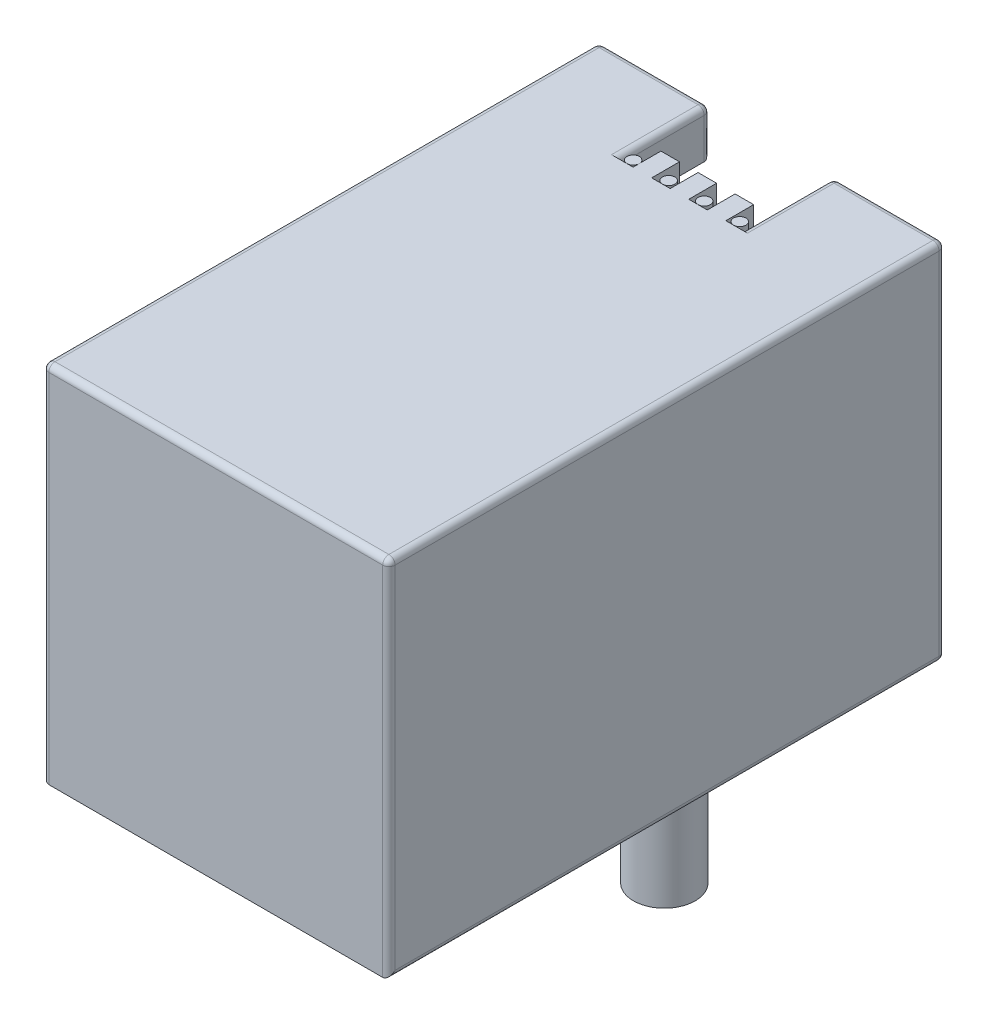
ISO-10303-21;
HEADER;
FILE_DESCRIPTION(('STEP AP214'),'2;1');
FILE_NAME('part.step','',(''),(''),'','','');
FILE_SCHEMA(('AUTOMOTIVE_DESIGN { 1 0 10303 214 1 1 1 1 }'));
ENDSEC;
DATA;
#1=APPLICATION_CONTEXT('core data for automotive mechanical design processes');
#2=APPLICATION_PROTOCOL_DEFINITION('international standard','automotive_design',2000,#1);
#3=PRODUCT_CONTEXT('',#1,'mechanical');
#4=PRODUCT('Part','Part','',(#3));
#5=PRODUCT_RELATED_PRODUCT_CATEGORY('part','',(#4));
#6=PRODUCT_DEFINITION_FORMATION('','',#4);
#7=PRODUCT_DEFINITION_CONTEXT('part definition',#1,'design');
#8=PRODUCT_DEFINITION('design','',#6,#7);
#9=PRODUCT_DEFINITION_SHAPE('','',#8);
#10=(LENGTH_UNIT() NAMED_UNIT(*) SI_UNIT(.MILLI.,.METRE.));
#11=(NAMED_UNIT(*) PLANE_ANGLE_UNIT() SI_UNIT($,.RADIAN.));
#12=(NAMED_UNIT(*) SI_UNIT($,.STERADIAN.) SOLID_ANGLE_UNIT());
#13=UNCERTAINTY_MEASURE_WITH_UNIT(LENGTH_MEASURE(1.E-05),#10,'distance_accuracy_value','');
#14=(GEOMETRIC_REPRESENTATION_CONTEXT(3) GLOBAL_UNCERTAINTY_ASSIGNED_CONTEXT((#13)) GLOBAL_UNIT_ASSIGNED_CONTEXT((#10,
#11,#12)) REPRESENTATION_CONTEXT('',''));
#15=CARTESIAN_POINT('',(0.,0.,0.));
#16=DIRECTION('',(0.,0.,1.));
#17=DIRECTION('',(1.,0.,0.));
#18=AXIS2_PLACEMENT_3D('',#15,#16,#17);
#19=CARTESIAN_POINT('',(-1.7,3.98107689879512,-5.86945927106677));
#20=DIRECTION('',(0.,-0.173648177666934,0.984807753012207));
#21=DIRECTION('',(0.,-0.984807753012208,-0.173648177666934));
#22=AXIS2_PLACEMENT_3D('',#19,#20,#21);
#23=CYLINDRICAL_SURFACE('',#22,0.2);
#24=CARTESIAN_POINT('',(-1.7,3.98107689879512,-5.86945927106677));
#25=DIRECTION('',(0.,0.173648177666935,-0.984807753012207));
#26=DIRECTION('',(0.,0.984807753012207,0.173648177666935));
#27=AXIS2_PLACEMENT_3D('',#24,#25,#26);
#28=CIRCLE('',#27,0.2);
#29=CARTESIAN_POINT('',(-1.7,3.78411534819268,-5.90418890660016));
#30=VERTEX_POINT('',#29);
#31=EDGE_CURVE('E44',#30,#30,#28,.T.);
#32=ORIENTED_EDGE('',*,*,#31,.F.);
#33=EDGE_LOOP('',(#32));
#34=FACE_BOUND('',#33,.T.);
#35=CARTESIAN_POINT('',(-1.7,2.95225663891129,-0.0347296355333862));
#36=DIRECTION('',(0.,0.173648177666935,-0.984807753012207));
#37=DIRECTION('',(0.,0.984807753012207,0.173648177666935));
#38=AXIS2_PLACEMENT_3D('',#35,#36,#37);
#39=CIRCLE('',#38,0.2);
#40=CARTESIAN_POINT('',(-1.7,3.14921818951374,0.));
#41=VERTEX_POINT('',#40);
#42=EDGE_CURVE('E12',#41,#41,#39,.T.);
#43=ORIENTED_EDGE('',*,*,#42,.T.);
#44=EDGE_LOOP('',(#43));
#45=FACE_BOUND('',#44,.T.);
#46=ADVANCED_FACE('F38',(#34,#45),#23,.T.);
#47=CARTESIAN_POINT('',(-1.7,4.375,-5.8));
#48=DIRECTION('',(-1.,0.,0.));
#49=DIRECTION('',(0.,0.,1.));
#50=AXIS2_PLACEMENT_3D('',#47,#48,#49);
#51=TOROIDAL_SURFACE('',#50,0.399999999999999,0.2);
#52=CARTESIAN_POINT('',(-1.7,4.375,-6.2));
#53=DIRECTION('',(0.,1.,0.));
#54=DIRECTION('',(0.,0.,1.));
#55=AXIS2_PLACEMENT_3D('',#52,#53,#54);
#56=CIRCLE('',#55,0.2);
#57=CARTESIAN_POINT('',(-1.7,4.375,-6.4));
#58=VERTEX_POINT('',#57);
#59=EDGE_CURVE('E48',#58,#58,#56,.T.);
#60=CARTESIAN_POINT('',(-1.7,4.375,-5.8));
#61=DIRECTION('',(-1.,0.,0.));
#62=DIRECTION('',(0.,0.,1.));
#63=AXIS2_PLACEMENT_3D('',#60,#61,#62);
#64=CIRCLE('',#63,0.599999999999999);
#65=EDGE_CURVE('',#58,#30,#64,.T.);
#66=ORIENTED_EDGE('',*,*,#59,.F.);
#67=ORIENTED_EDGE('',*,*,#31,.T.);
#68=ORIENTED_EDGE('',*,*,#65,.T.);
#69=ORIENTED_EDGE('',*,*,#65,.F.);
#70=EDGE_LOOP('',(#66,#68,#67,#69));
#71=FACE_BOUND('',#70,.T.);
#72=ADVANCED_FACE('F63',(#71),#51,.T.);
#73=CARTESIAN_POINT('',(-1.7,4.375,-6.2));
#74=DIRECTION('',(0.,1.,0.));
#75=DIRECTION('',(0.,0.,1.));
#76=AXIS2_PLACEMENT_3D('',#73,#74,#75);
#77=CYLINDRICAL_SURFACE('',#76,0.2);
#78=ORIENTED_EDGE('',*,*,#59,.T.);
#79=EDGE_LOOP('',(#78));
#80=FACE_BOUND('',#79,.T.);
#81=CARTESIAN_POINT('',(-1.7,5.875,-6.2));
#82=DIRECTION('',(0.,1.,0.));
#83=DIRECTION('',(0.,0.,1.));
#84=AXIS2_PLACEMENT_3D('',#81,#82,#83);
#85=CIRCLE('',#84,0.2);
#86=CARTESIAN_POINT('',(-1.7,5.875,-6.));
#87=VERTEX_POINT('',#86);
#88=EDGE_CURVE('E52',#87,#87,#85,.T.);
#89=ORIENTED_EDGE('',*,*,#88,.F.);
#90=EDGE_LOOP('',(#89));
#91=FACE_BOUND('',#90,.T.);
#92=ADVANCED_FACE('F60',(#80,#91),#77,.T.);
#93=CARTESIAN_POINT('',(-1.7,2.95225663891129,-0.0347296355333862));
#94=DIRECTION('',(0.,0.173648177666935,-0.984807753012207));
#95=DIRECTION('',(0.,0.984807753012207,0.173648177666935));
#96=AXIS2_PLACEMENT_3D('',#93,#94,#95);
#97=PLANE('',#96);
#98=ORIENTED_EDGE('',*,*,#42,.F.);
#99=EDGE_LOOP('',(#98));
#100=FACE_BOUND('',#99,.T.);
#101=ADVANCED_FACE('F62',(#100),#97,.F.);
#102=CARTESIAN_POINT('',(-1.7,5.875,-6.2));
#103=DIRECTION('',(0.,1.,0.));
#104=DIRECTION('',(0.,0.,1.));
#105=AXIS2_PLACEMENT_3D('',#102,#103,#104);
#106=PLANE('',#105);
#107=ORIENTED_EDGE('',*,*,#88,.T.);
#108=EDGE_LOOP('',(#107));
#109=FACE_BOUND('',#108,.T.);
#110=ADVANCED_FACE('F58',(#109),#106,.T.);
#111=CLOSED_SHELL('',(#46,#72,#92,#101,#110));
#112=MANIFOLD_SOLID_BREP('B2',#111);
#113=CARTESIAN_POINT('',(-0.549999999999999,3.98107689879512,-5.86945927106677));
#114=DIRECTION('',(0.,-0.173648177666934,0.984807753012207));
#115=DIRECTION('',(0.,-0.984807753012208,-0.173648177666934));
#116=AXIS2_PLACEMENT_3D('',#113,#114,#115);
#117=CYLINDRICAL_SURFACE('',#116,0.2);
#118=CARTESIAN_POINT('',(-0.549999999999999,3.98107689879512,-5.86945927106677));
#119=DIRECTION('',(0.,0.173648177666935,-0.984807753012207));
#120=DIRECTION('',(0.,0.984807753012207,0.173648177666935));
#121=AXIS2_PLACEMENT_3D('',#118,#119,#120);
#122=CIRCLE('',#121,0.2);
#123=CARTESIAN_POINT('',(-0.549999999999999,3.78411534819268,-5.90418890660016));
#124=VERTEX_POINT('',#123);
#125=EDGE_CURVE('E122',#124,#124,#122,.T.);
#126=ORIENTED_EDGE('',*,*,#125,.F.);
#127=EDGE_LOOP('',(#126));
#128=FACE_BOUND('',#127,.T.);
#129=CARTESIAN_POINT('',(-0.549999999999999,2.95225663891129,-0.0347296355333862));
#130=DIRECTION('',(0.,0.173648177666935,-0.984807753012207));
#131=DIRECTION('',(0.,0.984807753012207,0.173648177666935));
#132=AXIS2_PLACEMENT_3D('',#129,#130,#131);
#133=CIRCLE('',#132,0.2);
#134=CARTESIAN_POINT('',(-0.549999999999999,3.14921818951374,0.));
#135=VERTEX_POINT('',#134);
#136=EDGE_CURVE('E37',#135,#135,#133,.T.);
#137=ORIENTED_EDGE('',*,*,#136,.T.);
#138=EDGE_LOOP('',(#137));
#139=FACE_BOUND('',#138,.T.);
#140=ADVANCED_FACE('F116',(#128,#139),#117,.T.);
#141=CARTESIAN_POINT('',(-0.549999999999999,4.375,-5.8));
#142=DIRECTION('',(-1.,0.,0.));
#143=DIRECTION('',(0.,0.,1.));
#144=AXIS2_PLACEMENT_3D('',#141,#142,#143);
#145=TOROIDAL_SURFACE('',#144,0.399999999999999,0.2);
#146=CARTESIAN_POINT('',(-0.549999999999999,4.375,-6.2));
#147=DIRECTION('',(0.,1.,0.));
#148=DIRECTION('',(0.,0.,1.));
#149=AXIS2_PLACEMENT_3D('',#146,#147,#148);
#150=CIRCLE('',#149,0.2);
#151=CARTESIAN_POINT('',(-0.549999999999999,4.375,-6.4));
#152=VERTEX_POINT('',#151);
#153=EDGE_CURVE('E126',#152,#152,#150,.T.);
#154=CARTESIAN_POINT('',(-0.549999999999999,4.375,-5.8));
#155=DIRECTION('',(-1.,0.,0.));
#156=DIRECTION('',(0.,0.,1.));
#157=AXIS2_PLACEMENT_3D('',#154,#155,#156);
#158=CIRCLE('',#157,0.599999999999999);
#159=EDGE_CURVE('',#152,#124,#158,.T.);
#160=ORIENTED_EDGE('',*,*,#153,.F.);
#161=ORIENTED_EDGE('',*,*,#125,.T.);
#162=ORIENTED_EDGE('',*,*,#159,.T.);
#163=ORIENTED_EDGE('',*,*,#159,.F.);
#164=EDGE_LOOP('',(#160,#162,#161,#163));
#165=FACE_BOUND('',#164,.T.);
#166=ADVANCED_FACE('F141',(#165),#145,.T.);
#167=CARTESIAN_POINT('',(-0.549999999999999,4.375,-6.2));
#168=DIRECTION('',(0.,1.,0.));
#169=DIRECTION('',(0.,0.,1.));
#170=AXIS2_PLACEMENT_3D('',#167,#168,#169);
#171=CYLINDRICAL_SURFACE('',#170,0.2);
#172=ORIENTED_EDGE('',*,*,#153,.T.);
#173=EDGE_LOOP('',(#172));
#174=FACE_BOUND('',#173,.T.);
#175=CARTESIAN_POINT('',(-0.549999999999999,5.875,-6.2));
#176=DIRECTION('',(0.,1.,0.));
#177=DIRECTION('',(0.,0.,1.));
#178=AXIS2_PLACEMENT_3D('',#175,#176,#177);
#179=CIRCLE('',#178,0.2);
#180=CARTESIAN_POINT('',(-0.549999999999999,5.875,-6.));
#181=VERTEX_POINT('',#180);
#182=EDGE_CURVE('E130',#181,#181,#179,.T.);
#183=ORIENTED_EDGE('',*,*,#182,.F.);
#184=EDGE_LOOP('',(#183));
#185=FACE_BOUND('',#184,.T.);
#186=ADVANCED_FACE('F138',(#174,#185),#171,.T.);
#187=CARTESIAN_POINT('',(-0.549999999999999,2.95225663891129,-0.0347296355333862));
#188=DIRECTION('',(0.,0.173648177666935,-0.984807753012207));
#189=DIRECTION('',(0.,0.984807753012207,0.173648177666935));
#190=AXIS2_PLACEMENT_3D('',#187,#188,#189);
#191=PLANE('',#190);
#192=ORIENTED_EDGE('',*,*,#136,.F.);
#193=EDGE_LOOP('',(#192));
#194=FACE_BOUND('',#193,.T.);
#195=ADVANCED_FACE('F140',(#194),#191,.F.);
#196=CARTESIAN_POINT('',(-0.549999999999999,5.875,-6.2));
#197=DIRECTION('',(0.,1.,0.));
#198=DIRECTION('',(0.,0.,1.));
#199=AXIS2_PLACEMENT_3D('',#196,#197,#198);
#200=PLANE('',#199);
#201=ORIENTED_EDGE('',*,*,#182,.T.);
#202=EDGE_LOOP('',(#201));
#203=FACE_BOUND('',#202,.T.);
#204=ADVANCED_FACE('F136',(#203),#200,.T.);
#205=CLOSED_SHELL('',(#140,#166,#186,#195,#204));
#206=MANIFOLD_SOLID_BREP('B7',#205);
#207=CARTESIAN_POINT('',(0.600000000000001,3.98107689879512,-5.86945927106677));
#208=DIRECTION('',(0.,-0.173648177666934,0.984807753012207));
#209=DIRECTION('',(0.,-0.984807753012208,-0.173648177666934));
#210=AXIS2_PLACEMENT_3D('',#207,#208,#209);
#211=CYLINDRICAL_SURFACE('',#210,0.2);
#212=CARTESIAN_POINT('',(0.600000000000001,3.98107689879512,-5.86945927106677));
#213=DIRECTION('',(0.,0.173648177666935,-0.984807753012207));
#214=DIRECTION('',(0.,0.984807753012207,0.173648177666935));
#215=AXIS2_PLACEMENT_3D('',#212,#213,#214);
#216=CIRCLE('',#215,0.2);
#217=CARTESIAN_POINT('',(0.600000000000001,3.78411534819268,-5.90418890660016));
#218=VERTEX_POINT('',#217);
#219=EDGE_CURVE('E200',#218,#218,#216,.T.);
#220=ORIENTED_EDGE('',*,*,#219,.F.);
#221=EDGE_LOOP('',(#220));
#222=FACE_BOUND('',#221,.T.);
#223=CARTESIAN_POINT('',(0.600000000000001,2.95225663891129,-0.0347296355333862));
#224=DIRECTION('',(0.,0.173648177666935,-0.984807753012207));
#225=DIRECTION('',(0.,0.984807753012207,0.173648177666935));
#226=AXIS2_PLACEMENT_3D('',#223,#224,#225);
#227=CIRCLE('',#226,0.2);
#228=CARTESIAN_POINT('',(0.600000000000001,3.14921818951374,0.));
#229=VERTEX_POINT('',#228);
#230=EDGE_CURVE('E115',#229,#229,#227,.T.);
#231=ORIENTED_EDGE('',*,*,#230,.T.);
#232=EDGE_LOOP('',(#231));
#233=FACE_BOUND('',#232,.T.);
#234=ADVANCED_FACE('F194',(#222,#233),#211,.T.);
#235=CARTESIAN_POINT('',(0.600000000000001,4.375,-5.8));
#236=DIRECTION('',(-1.,0.,0.));
#237=DIRECTION('',(0.,0.,1.));
#238=AXIS2_PLACEMENT_3D('',#235,#236,#237);
#239=TOROIDAL_SURFACE('',#238,0.399999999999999,0.2);
#240=CARTESIAN_POINT('',(0.600000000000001,4.375,-6.2));
#241=DIRECTION('',(0.,1.,0.));
#242=DIRECTION('',(0.,0.,1.));
#243=AXIS2_PLACEMENT_3D('',#240,#241,#242);
#244=CIRCLE('',#243,0.2);
#245=CARTESIAN_POINT('',(0.600000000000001,4.375,-6.4));
#246=VERTEX_POINT('',#245);
#247=EDGE_CURVE('E204',#246,#246,#244,.T.);
#248=CARTESIAN_POINT('',(0.600000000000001,4.375,-5.8));
#249=DIRECTION('',(-1.,0.,0.));
#250=DIRECTION('',(0.,0.,1.));
#251=AXIS2_PLACEMENT_3D('',#248,#249,#250);
#252=CIRCLE('',#251,0.599999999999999);
#253=EDGE_CURVE('',#246,#218,#252,.T.);
#254=ORIENTED_EDGE('',*,*,#247,.F.);
#255=ORIENTED_EDGE('',*,*,#219,.T.);
#256=ORIENTED_EDGE('',*,*,#253,.T.);
#257=ORIENTED_EDGE('',*,*,#253,.F.);
#258=EDGE_LOOP('',(#254,#256,#255,#257));
#259=FACE_BOUND('',#258,.T.);
#260=ADVANCED_FACE('F219',(#259),#239,.T.);
#261=CARTESIAN_POINT('',(0.600000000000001,4.375,-6.2));
#262=DIRECTION('',(0.,1.,0.));
#263=DIRECTION('',(0.,0.,1.));
#264=AXIS2_PLACEMENT_3D('',#261,#262,#263);
#265=CYLINDRICAL_SURFACE('',#264,0.2);
#266=ORIENTED_EDGE('',*,*,#247,.T.);
#267=EDGE_LOOP('',(#266));
#268=FACE_BOUND('',#267,.T.);
#269=CARTESIAN_POINT('',(0.600000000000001,5.875,-6.2));
#270=DIRECTION('',(0.,1.,0.));
#271=DIRECTION('',(0.,0.,1.));
#272=AXIS2_PLACEMENT_3D('',#269,#270,#271);
#273=CIRCLE('',#272,0.2);
#274=CARTESIAN_POINT('',(0.600000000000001,5.875,-6.));
#275=VERTEX_POINT('',#274);
#276=EDGE_CURVE('E208',#275,#275,#273,.T.);
#277=ORIENTED_EDGE('',*,*,#276,.F.);
#278=EDGE_LOOP('',(#277));
#279=FACE_BOUND('',#278,.T.);
#280=ADVANCED_FACE('F216',(#268,#279),#265,.T.);
#281=CARTESIAN_POINT('',(0.600000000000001,2.95225663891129,-0.0347296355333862));
#282=DIRECTION('',(0.,0.173648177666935,-0.984807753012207));
#283=DIRECTION('',(0.,0.984807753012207,0.173648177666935));
#284=AXIS2_PLACEMENT_3D('',#281,#282,#283);
#285=PLANE('',#284);
#286=ORIENTED_EDGE('',*,*,#230,.F.);
#287=EDGE_LOOP('',(#286));
#288=FACE_BOUND('',#287,.T.);
#289=ADVANCED_FACE('F218',(#288),#285,.F.);
#290=CARTESIAN_POINT('',(0.600000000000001,5.875,-6.2));
#291=DIRECTION('',(0.,1.,0.));
#292=DIRECTION('',(0.,0.,1.));
#293=AXIS2_PLACEMENT_3D('',#290,#291,#292);
#294=PLANE('',#293);
#295=ORIENTED_EDGE('',*,*,#276,.T.);
#296=EDGE_LOOP('',(#295));
#297=FACE_BOUND('',#296,.T.);
#298=ADVANCED_FACE('F214',(#297),#294,.T.);
#299=CLOSED_SHELL('',(#234,#260,#280,#289,#298));
#300=MANIFOLD_SOLID_BREP('B32',#299);
#301=CARTESIAN_POINT('',(1.75,3.98107689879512,-5.86945927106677));
#302=DIRECTION('',(0.,-0.173648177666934,0.984807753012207));
#303=DIRECTION('',(0.,-0.984807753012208,-0.173648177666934));
#304=AXIS2_PLACEMENT_3D('',#301,#302,#303);
#305=CYLINDRICAL_SURFACE('',#304,0.2);
#306=CARTESIAN_POINT('',(1.75,3.98107689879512,-5.86945927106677));
#307=DIRECTION('',(0.,0.173648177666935,-0.984807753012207));
#308=DIRECTION('',(0.,0.984807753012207,0.173648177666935));
#309=AXIS2_PLACEMENT_3D('',#306,#307,#308);
#310=CIRCLE('',#309,0.2);
#311=CARTESIAN_POINT('',(1.75,3.78411534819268,-5.90418890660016));
#312=VERTEX_POINT('',#311);
#313=EDGE_CURVE('E279',#312,#312,#310,.T.);
#314=ORIENTED_EDGE('',*,*,#313,.F.);
#315=EDGE_LOOP('',(#314));
#316=FACE_BOUND('',#315,.T.);
#317=CARTESIAN_POINT('',(1.75,2.95225663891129,-0.0347296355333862));
#318=DIRECTION('',(0.,0.173648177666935,-0.984807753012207));
#319=DIRECTION('',(0.,0.984807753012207,0.173648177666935));
#320=AXIS2_PLACEMENT_3D('',#317,#318,#319);
#321=CIRCLE('',#320,0.2);
#322=CARTESIAN_POINT('',(1.75,3.14921818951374,0.));
#323=VERTEX_POINT('',#322);
#324=EDGE_CURVE('E193',#323,#323,#321,.T.);
#325=ORIENTED_EDGE('',*,*,#324,.T.);
#326=EDGE_LOOP('',(#325));
#327=FACE_BOUND('',#326,.T.);
#328=ADVANCED_FACE('F273',(#316,#327),#305,.T.);
#329=CARTESIAN_POINT('',(1.75,4.375,-5.8));
#330=DIRECTION('',(-1.,0.,0.));
#331=DIRECTION('',(0.,0.,1.));
#332=AXIS2_PLACEMENT_3D('',#329,#330,#331);
#333=TOROIDAL_SURFACE('',#332,0.399999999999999,0.2);
#334=CARTESIAN_POINT('',(1.75,4.375,-6.2));
#335=DIRECTION('',(0.,1.,0.));
#336=DIRECTION('',(0.,0.,1.));
#337=AXIS2_PLACEMENT_3D('',#334,#335,#336);
#338=CIRCLE('',#337,0.2);
#339=CARTESIAN_POINT('',(1.75,4.375,-6.4));
#340=VERTEX_POINT('',#339);
#341=EDGE_CURVE('E283',#340,#340,#338,.T.);
#342=CARTESIAN_POINT('',(1.75,4.375,-5.8));
#343=DIRECTION('',(-1.,0.,0.));
#344=DIRECTION('',(0.,0.,1.));
#345=AXIS2_PLACEMENT_3D('',#342,#343,#344);
#346=CIRCLE('',#345,0.599999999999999);
#347=EDGE_CURVE('',#340,#312,#346,.T.);
#348=ORIENTED_EDGE('',*,*,#341,.F.);
#349=ORIENTED_EDGE('',*,*,#313,.T.);
#350=ORIENTED_EDGE('',*,*,#347,.T.);
#351=ORIENTED_EDGE('',*,*,#347,.F.);
#352=EDGE_LOOP('',(#348,#350,#349,#351));
#353=FACE_BOUND('',#352,.T.);
#354=ADVANCED_FACE('F298',(#353),#333,.T.);
#355=CARTESIAN_POINT('',(1.75,4.375,-6.2));
#356=DIRECTION('',(0.,1.,0.));
#357=DIRECTION('',(0.,0.,1.));
#358=AXIS2_PLACEMENT_3D('',#355,#356,#357);
#359=CYLINDRICAL_SURFACE('',#358,0.2);
#360=ORIENTED_EDGE('',*,*,#341,.T.);
#361=EDGE_LOOP('',(#360));
#362=FACE_BOUND('',#361,.T.);
#363=CARTESIAN_POINT('',(1.75,5.875,-6.2));
#364=DIRECTION('',(0.,1.,0.));
#365=DIRECTION('',(0.,0.,1.));
#366=AXIS2_PLACEMENT_3D('',#363,#364,#365);
#367=CIRCLE('',#366,0.2);
#368=CARTESIAN_POINT('',(1.75,5.875,-6.));
#369=VERTEX_POINT('',#368);
#370=EDGE_CURVE('E287',#369,#369,#367,.T.);
#371=ORIENTED_EDGE('',*,*,#370,.F.);
#372=EDGE_LOOP('',(#371));
#373=FACE_BOUND('',#372,.T.);
#374=ADVANCED_FACE('F295',(#362,#373),#359,.T.);
#375=CARTESIAN_POINT('',(1.75,2.95225663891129,-0.0347296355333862));
#376=DIRECTION('',(0.,0.173648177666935,-0.984807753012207));
#377=DIRECTION('',(0.,0.984807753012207,0.173648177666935));
#378=AXIS2_PLACEMENT_3D('',#375,#376,#377);
#379=PLANE('',#378);
#380=ORIENTED_EDGE('',*,*,#324,.F.);
#381=EDGE_LOOP('',(#380));
#382=FACE_BOUND('',#381,.T.);
#383=ADVANCED_FACE('F297',(#382),#379,.F.);
#384=CARTESIAN_POINT('',(1.75,5.875,-6.2));
#385=DIRECTION('',(0.,1.,0.));
#386=DIRECTION('',(0.,0.,1.));
#387=AXIS2_PLACEMENT_3D('',#384,#385,#386);
#388=PLANE('',#387);
#389=ORIENTED_EDGE('',*,*,#370,.T.);
#390=EDGE_LOOP('',(#389));
#391=FACE_BOUND('',#390,.T.);
#392=ADVANCED_FACE('F293',(#391),#388,.T.);
#393=CLOSED_SHELL('',(#328,#354,#374,#383,#392));
#394=MANIFOLD_SOLID_BREP('B110',#393);
#395=CARTESIAN_POINT('',(-2.35,0.,-0.499999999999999));
#396=DIRECTION('',(0.,1.,0.));
#397=DIRECTION('',(-1.,0.,0.));
#398=AXIS2_PLACEMENT_3D('',#395,#396,#397);
#399=PLANE('',#398);
#400=DIRECTION('',(1.,0.,0.));
#401=VECTOR('',#400,1.);
#402=CARTESIAN_POINT('',(-2.35,0.,-0.999999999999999));
#403=LINE('',#402,#401);
#404=CARTESIAN_POINT('',(0.9,0.,-0.999999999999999));
#405=VERTEX_POINT('',#404);
#406=CARTESIAN_POINT('',(1.5,0.,-0.999999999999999));
#407=VERTEX_POINT('',#406);
#408=EDGE_CURVE('E2056',#405,#407,#403,.T.);
#409=ORIENTED_EDGE('',*,*,#408,.T.);
#410=DIRECTION('',(0.,0.,1.));
#411=VECTOR('',#410,1.);
#412=CARTESIAN_POINT('',(1.5,0.,-0.499999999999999));
#413=LINE('',#412,#411);
#414=CARTESIAN_POINT('',(1.5,0.,-0.499999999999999));
#415=VERTEX_POINT('',#414);
#416=EDGE_CURVE('E941',#407,#415,#413,.T.);
#417=ORIENTED_EDGE('',*,*,#416,.T.);
#418=DIRECTION('',(1.,0.,0.));
#419=VECTOR('',#418,1.);
#420=CARTESIAN_POINT('',(-2.35,0.,-0.499999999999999));
#421=LINE('',#420,#419);
#422=CARTESIAN_POINT('',(0.899999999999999,0.,-0.499999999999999));
#423=VERTEX_POINT('',#422);
#424=EDGE_CURVE('E2016',#423,#415,#421,.T.);
#425=ORIENTED_EDGE('',*,*,#424,.F.);
#426=DIRECTION('',(0.,0.,-1.));
#427=VECTOR('',#426,1.);
#428=CARTESIAN_POINT('',(0.9,0.,-0.499999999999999));
#429=LINE('',#428,#427);
#430=EDGE_CURVE('E964',#423,#405,#429,.T.);
#431=ORIENTED_EDGE('',*,*,#430,.T.);
#432=EDGE_LOOP('',(#409,#417,#425,#431));
#433=FACE_BOUND('',#432,.T.);
#434=ADVANCED_FACE('F343',(#433),#399,.F.);
#435=CARTESIAN_POINT('',(2.85,-3.625,-0.999999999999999));
#436=DIRECTION('',(0.,0.,1.));
#437=DIRECTION('',(1.,0.,0.));
#438=AXIS2_PLACEMENT_3D('',#435,#436,#437);
#439=PLANE('',#438);
#440=DIRECTION('',(1.,0.,0.));
#441=VECTOR('',#440,1.);
#442=CARTESIAN_POINT('',(-4.1,4.375,-0.999999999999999));
#443=LINE('',#442,#441);
#444=CARTESIAN_POINT('',(0.9,4.375,-0.999999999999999));
#445=VERTEX_POINT('',#444);
#446=CARTESIAN_POINT('',(1.5,4.375,-0.999999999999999));
#447=VERTEX_POINT('',#446);
#448=EDGE_CURVE('E2043',#445,#447,#443,.T.);
#449=ORIENTED_EDGE('',*,*,#448,.T.);
#450=DIRECTION('',(0.,1.,0.));
#451=VECTOR('',#450,1.);
#452=CARTESIAN_POINT('',(1.5,4.375,-0.999999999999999));
#453=LINE('',#452,#451);
#454=EDGE_CURVE('E908',#407,#447,#453,.T.);
#455=ORIENTED_EDGE('',*,*,#454,.F.);
#456=ORIENTED_EDGE('',*,*,#408,.F.);
#457=DIRECTION('',(0.,-1.,0.));
#458=VECTOR('',#457,1.);
#459=CARTESIAN_POINT('',(0.9,4.375,-0.999999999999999));
#460=LINE('',#459,#458);
#461=EDGE_CURVE('E949',#445,#405,#460,.T.);
#462=ORIENTED_EDGE('',*,*,#461,.F.);
#463=EDGE_LOOP('',(#449,#455,#456,#462));
#464=FACE_BOUND('',#463,.T.);
#465=ADVANCED_FACE('F1965',(#464),#439,.F.);
#466=CARTESIAN_POINT('',(-0.3,0.,-0.999999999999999));
#467=VERTEX_POINT('',#466);
#468=CARTESIAN_POINT('',(0.300000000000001,0.,-0.999999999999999));
#469=VERTEX_POINT('',#468);
#470=EDGE_CURVE('E2057',#467,#469,#403,.T.);
#471=ORIENTED_EDGE('',*,*,#470,.T.);
#472=DIRECTION('',(0.,0.,1.));
#473=VECTOR('',#472,1.);
#474=CARTESIAN_POINT('',(0.300000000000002,0.,-0.499999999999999));
#475=LINE('',#474,#473);
#476=CARTESIAN_POINT('',(0.300000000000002,0.,-0.499999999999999));
#477=VERTEX_POINT('',#476);
#478=EDGE_CURVE('E974',#469,#477,#475,.T.);
#479=ORIENTED_EDGE('',*,*,#478,.T.);
#480=CARTESIAN_POINT('',(-0.3,0.,-0.499999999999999));
#481=VERTEX_POINT('',#480);
#482=EDGE_CURVE('E2018',#481,#477,#421,.T.);
#483=ORIENTED_EDGE('',*,*,#482,.F.);
#484=DIRECTION('',(0.,0.,-1.));
#485=VECTOR('',#484,1.);
#486=CARTESIAN_POINT('',(-0.3,0.,-0.499999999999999));
#487=LINE('',#486,#485);
#488=EDGE_CURVE('E1006',#481,#467,#487,.T.);
#489=ORIENTED_EDGE('',*,*,#488,.T.);
#490=EDGE_LOOP('',(#471,#479,#483,#489));
#491=FACE_BOUND('',#490,.T.);
#492=ADVANCED_FACE('F1968',(#491),#399,.F.);
#493=CARTESIAN_POINT('',(-0.3,4.375,-0.999999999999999));
#494=VERTEX_POINT('',#493);
#495=CARTESIAN_POINT('',(0.300000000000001,4.375,-0.999999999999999));
#496=VERTEX_POINT('',#495);
#497=EDGE_CURVE('E2041',#494,#496,#443,.T.);
#498=ORIENTED_EDGE('',*,*,#497,.T.);
#499=DIRECTION('',(0.,1.,0.));
#500=VECTOR('',#499,1.);
#501=CARTESIAN_POINT('',(0.300000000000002,-2.1875,-0.999999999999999));
#502=LINE('',#501,#500);
#503=EDGE_CURVE('E944',#469,#496,#502,.T.);
#504=ORIENTED_EDGE('',*,*,#503,.F.);
#505=ORIENTED_EDGE('',*,*,#470,.F.);
#506=DIRECTION('',(0.,-1.,0.));
#507=VECTOR('',#506,1.);
#508=CARTESIAN_POINT('',(-0.3,4.375,-0.999999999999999));
#509=LINE('',#508,#507);
#510=EDGE_CURVE('E977',#494,#467,#509,.T.);
#511=ORIENTED_EDGE('',*,*,#510,.F.);
#512=EDGE_LOOP('',(#498,#504,#505,#511));
#513=FACE_BOUND('',#512,.T.);
#514=ADVANCED_FACE('F1975',(#513),#439,.F.);
#515=CARTESIAN_POINT('',(2.,0.,-0.499999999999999));
#516=VERTEX_POINT('',#515);
#517=CARTESIAN_POINT('',(2.35,0.,-0.499999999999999));
#518=VERTEX_POINT('',#517);
#519=EDGE_CURVE('E1047',#516,#518,#421,.T.);
#520=ORIENTED_EDGE('',*,*,#519,.F.);
#521=DIRECTION('',(0.,0.,-1.));
#522=VECTOR('',#521,1.);
#523=CARTESIAN_POINT('',(2.,0.,-0.499999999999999));
#524=LINE('',#523,#522);
#525=CARTESIAN_POINT('',(2.,0.,-0.999999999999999));
#526=VERTEX_POINT('',#525);
#527=EDGE_CURVE('E934',#516,#526,#524,.T.);
#528=ORIENTED_EDGE('',*,*,#527,.T.);
#529=CARTESIAN_POINT('',(2.35,0.,-0.999999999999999));
#530=VERTEX_POINT('',#529);
#531=EDGE_CURVE('E1041',#526,#530,#403,.T.);
#532=ORIENTED_EDGE('',*,*,#531,.T.);
#533=DIRECTION('',(0.,0.,-1.));
#534=VECTOR('',#533,1.);
#535=CARTESIAN_POINT('',(2.35,0.,-0.499999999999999));
#536=LINE('',#535,#534);
#537=EDGE_CURVE('E1056',#518,#530,#536,.T.);
#538=ORIENTED_EDGE('',*,*,#537,.F.);
#539=EDGE_LOOP('',(#520,#528,#532,#538));
#540=FACE_BOUND('',#539,.T.);
#541=ADVANCED_FACE('F1982',(#540),#399,.F.);
#542=DIRECTION('',(0.,-1.,0.));
#543=VECTOR('',#542,1.);
#544=CARTESIAN_POINT('',(4.1,4.375,-0.999999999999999));
#545=LINE('',#544,#543);
#546=CARTESIAN_POINT('',(4.1,4.375,-0.999999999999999));
#547=VERTEX_POINT('',#546);
#548=CARTESIAN_POINT('',(4.1,-3.425,-0.999999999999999));
#549=VERTEX_POINT('',#548);
#550=EDGE_CURVE('E1219',#547,#549,#545,.T.);
#551=ORIENTED_EDGE('',*,*,#550,.T.);
#552=CARTESIAN_POINT('',(3.9,-3.425,-0.999999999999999));
#553=DIRECTION('',(0.,0.,1.));
#554=DIRECTION('',(1.,0.,0.));
#555=AXIS2_PLACEMENT_3D('',#552,#553,#554);
#556=CIRCLE('',#555,0.2);
#557=CARTESIAN_POINT('',(3.9,-3.625,-0.999999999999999));
#558=VERTEX_POINT('',#557);
#559=EDGE_CURVE('E1294',#549,#558,#556,.F.);
#560=ORIENTED_EDGE('',*,*,#559,.T.);
#561=DIRECTION('',(-1.,0.,0.));
#562=VECTOR('',#561,1.);
#563=CARTESIAN_POINT('',(4.1,-3.625,-0.999999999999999));
#564=LINE('',#563,#562);
#565=CARTESIAN_POINT('',(3.05,-3.625,-0.999999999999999));
#566=VERTEX_POINT('',#565);
#567=EDGE_CURVE('E1189',#558,#566,#564,.T.);
#568=ORIENTED_EDGE('',*,*,#567,.T.);
#569=CARTESIAN_POINT('',(3.05,-3.825,-0.999999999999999));
#570=DIRECTION('',(0.,0.,1.));
#571=DIRECTION('',(1.,0.,0.));
#572=AXIS2_PLACEMENT_3D('',#569,#570,#571);
#573=CIRCLE('',#572,0.2);
#574=CARTESIAN_POINT('',(2.85,-3.825,-0.999999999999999));
#575=VERTEX_POINT('',#574);
#576=EDGE_CURVE('E1452',#566,#575,#573,.T.);
#577=ORIENTED_EDGE('',*,*,#576,.T.);
#578=DIRECTION('',(0.,-1.,0.));
#579=VECTOR('',#578,1.);
#580=CARTESIAN_POINT('',(2.85,-3.625,-0.999999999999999));
#581=LINE('',#580,#579);
#582=CARTESIAN_POINT('',(2.85,-4.675,-0.999999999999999));
#583=VERTEX_POINT('',#582);
#584=EDGE_CURVE('E1192',#575,#583,#581,.T.);
#585=ORIENTED_EDGE('',*,*,#584,.T.);
#586=CARTESIAN_POINT('',(2.65,-4.675,-0.999999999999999));
#587=DIRECTION('',(0.,0.,1.));
#588=DIRECTION('',(1.,0.,0.));
#589=AXIS2_PLACEMENT_3D('',#586,#587,#588);
#590=CIRCLE('',#589,0.2);
#591=CARTESIAN_POINT('',(2.65,-4.875,-0.999999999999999));
#592=VERTEX_POINT('',#591);
#593=EDGE_CURVE('E1288',#583,#592,#590,.F.);
#594=ORIENTED_EDGE('',*,*,#593,.T.);
#595=DIRECTION('',(-1.,0.,0.));
#596=VECTOR('',#595,1.);
#597=CARTESIAN_POINT('',(2.85,-4.875,-0.999999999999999));
#598=LINE('',#597,#596);
#599=CARTESIAN_POINT('',(1.7,-4.875,-0.999999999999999));
#600=VERTEX_POINT('',#599);
#601=EDGE_CURVE('E1195',#592,#600,#598,.T.);
#602=ORIENTED_EDGE('',*,*,#601,.T.);
#603=CARTESIAN_POINT('',(1.7,-5.075,-0.999999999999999));
#604=DIRECTION('',(0.,0.,1.));
#605=DIRECTION('',(1.,0.,0.));
#606=AXIS2_PLACEMENT_3D('',#603,#604,#605);
#607=CIRCLE('',#606,0.2);
#608=CARTESIAN_POINT('',(1.5,-5.075,-0.999999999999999));
#609=VERTEX_POINT('',#608);
#610=EDGE_CURVE('E1448',#600,#609,#607,.T.);
#611=ORIENTED_EDGE('',*,*,#610,.T.);
#612=DIRECTION('',(0.,-1.,0.));
#613=VECTOR('',#612,1.);
#614=CARTESIAN_POINT('',(1.5,-4.875,-0.999999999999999));
#615=LINE('',#614,#613);
#616=CARTESIAN_POINT('',(1.5,-5.675,-0.999999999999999));
#617=VERTEX_POINT('',#616);
#618=EDGE_CURVE('E1198',#609,#617,#615,.T.);
#619=ORIENTED_EDGE('',*,*,#618,.T.);
#620=DIRECTION('',(-1.,0.,0.));
#621=VECTOR('',#620,1.);
#622=CARTESIAN_POINT('',(2.85,-5.675,-0.999999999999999));
#623=LINE('',#622,#621);
#624=CARTESIAN_POINT('',(-1.5,-5.675,-0.999999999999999));
#625=VERTEX_POINT('',#624);
#626=EDGE_CURVE('E1286',#617,#625,#623,.T.);
#627=ORIENTED_EDGE('',*,*,#626,.T.);
#628=DIRECTION('',(0.,1.,0.));
#629=VECTOR('',#628,1.);
#630=CARTESIAN_POINT('',(-1.5,-4.875,-0.999999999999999));
#631=LINE('',#630,#629);
#632=CARTESIAN_POINT('',(-1.5,-5.075,-0.999999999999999));
#633=VERTEX_POINT('',#632);
#634=EDGE_CURVE('E1201',#625,#633,#631,.T.);
#635=ORIENTED_EDGE('',*,*,#634,.T.);
#636=CARTESIAN_POINT('',(-1.7,-5.075,-0.999999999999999));
#637=DIRECTION('',(0.,0.,1.));
#638=DIRECTION('',(1.,0.,0.));
#639=AXIS2_PLACEMENT_3D('',#636,#637,#638);
#640=CIRCLE('',#639,0.2);
#641=CARTESIAN_POINT('',(-1.7,-4.875,-0.999999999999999));
#642=VERTEX_POINT('',#641);
#643=EDGE_CURVE('E1454',#633,#642,#640,.T.);
#644=ORIENTED_EDGE('',*,*,#643,.T.);
#645=DIRECTION('',(-1.,0.,0.));
#646=VECTOR('',#645,1.);
#647=CARTESIAN_POINT('',(-2.85,-4.875,-0.999999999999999));
#648=LINE('',#647,#646);
#649=CARTESIAN_POINT('',(-2.65,-4.875,-0.999999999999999));
#650=VERTEX_POINT('',#649);
#651=EDGE_CURVE('E1204',#642,#650,#648,.T.);
#652=ORIENTED_EDGE('',*,*,#651,.T.);
#653=CARTESIAN_POINT('',(-2.65,-4.675,-0.999999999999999));
#654=DIRECTION('',(0.,0.,1.));
#655=DIRECTION('',(1.,0.,0.));
#656=AXIS2_PLACEMENT_3D('',#653,#654,#655);
#657=CIRCLE('',#656,0.2);
#658=CARTESIAN_POINT('',(-2.85,-4.675,-0.999999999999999));
#659=VERTEX_POINT('',#658);
#660=EDGE_CURVE('E1290',#650,#659,#657,.F.);
#661=ORIENTED_EDGE('',*,*,#660,.T.);
#662=DIRECTION('',(0.,1.,0.));
#663=VECTOR('',#662,1.);
#664=CARTESIAN_POINT('',(-2.85,-3.625,-0.999999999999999));
#665=LINE('',#664,#663);
#666=CARTESIAN_POINT('',(-2.85,-3.825,-0.999999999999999));
#667=VERTEX_POINT('',#666);
#668=EDGE_CURVE('E1207',#659,#667,#665,.T.);
#669=ORIENTED_EDGE('',*,*,#668,.T.);
#670=CARTESIAN_POINT('',(-3.05,-3.825,-0.999999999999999));
#671=DIRECTION('',(0.,0.,1.));
#672=DIRECTION('',(1.,0.,0.));
#673=AXIS2_PLACEMENT_3D('',#670,#671,#672);
#674=CIRCLE('',#673,0.2);
#675=CARTESIAN_POINT('',(-3.05,-3.625,-0.999999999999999));
#676=VERTEX_POINT('',#675);
#677=EDGE_CURVE('E1450',#667,#676,#674,.T.);
#678=ORIENTED_EDGE('',*,*,#677,.T.);
#679=DIRECTION('',(-1.,0.,0.));
#680=VECTOR('',#679,1.);
#681=CARTESIAN_POINT('',(-4.1,-3.625,-0.999999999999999));
#682=LINE('',#681,#680);
#683=CARTESIAN_POINT('',(-3.9,-3.625,-0.999999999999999));
#684=VERTEX_POINT('',#683);
#685=EDGE_CURVE('E1210',#676,#684,#682,.T.);
#686=ORIENTED_EDGE('',*,*,#685,.T.);
#687=CARTESIAN_POINT('',(-3.9,-3.425,-0.999999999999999));
#688=DIRECTION('',(0.,0.,1.));
#689=DIRECTION('',(1.,0.,0.));
#690=AXIS2_PLACEMENT_3D('',#687,#688,#689);
#691=CIRCLE('',#690,0.2);
#692=CARTESIAN_POINT('',(-4.1,-3.425,-0.999999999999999));
#693=VERTEX_POINT('',#692);
#694=EDGE_CURVE('E1292',#684,#693,#691,.F.);
#695=ORIENTED_EDGE('',*,*,#694,.T.);
#696=DIRECTION('',(0.,1.,0.));
#697=VECTOR('',#696,1.);
#698=CARTESIAN_POINT('',(-4.1,4.375,-0.999999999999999));
#699=LINE('',#698,#697);
#700=CARTESIAN_POINT('',(-4.1,4.375,-0.999999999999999));
#701=VERTEX_POINT('',#700);
#702=EDGE_CURVE('E1213',#693,#701,#699,.T.);
#703=ORIENTED_EDGE('',*,*,#702,.T.);
#704=CARTESIAN_POINT('',(-2.,4.375,-0.999999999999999));
#705=VERTEX_POINT('',#704);
#706=EDGE_CURVE('E1216',#701,#705,#443,.T.);
#707=ORIENTED_EDGE('',*,*,#706,.T.);
#708=DIRECTION('',(0.,1.,0.));
#709=VECTOR('',#708,1.);
#710=CARTESIAN_POINT('',(-2.,-2.1875,-0.999999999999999));
#711=LINE('',#710,#709);
#712=CARTESIAN_POINT('',(-2.,0.,-0.999999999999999));
#713=VERTEX_POINT('',#712);
#714=EDGE_CURVE('E1014',#713,#705,#711,.T.);
#715=ORIENTED_EDGE('',*,*,#714,.F.);
#716=CARTESIAN_POINT('',(-2.35,0.,-0.999999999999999));
#717=VERTEX_POINT('',#716);
#718=EDGE_CURVE('E1057',#717,#713,#403,.T.);
#719=ORIENTED_EDGE('',*,*,#718,.F.);
#720=DIRECTION('',(0.,1.,0.));
#721=VECTOR('',#720,1.);
#722=CARTESIAN_POINT('',(-2.35,-4.375,-0.999999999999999));
#723=LINE('',#722,#721);
#724=CARTESIAN_POINT('',(-2.35,-4.375,-0.999999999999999));
#725=VERTEX_POINT('',#724);
#726=EDGE_CURVE('E1067',#725,#717,#723,.T.);
#727=ORIENTED_EDGE('',*,*,#726,.F.);
#728=DIRECTION('',(-1.,0.,0.));
#729=VECTOR('',#728,1.);
#730=CARTESIAN_POINT('',(2.35,-4.375,-0.999999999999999));
#731=LINE('',#730,#729);
#732=CARTESIAN_POINT('',(2.35,-4.375,-0.999999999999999));
#733=VERTEX_POINT('',#732);
#734=EDGE_CURVE('E1064',#733,#725,#731,.T.);
#735=ORIENTED_EDGE('',*,*,#734,.F.);
#736=DIRECTION('',(0.,-1.,0.));
#737=VECTOR('',#736,1.);
#738=CARTESIAN_POINT('',(2.35,0.,-0.999999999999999));
#739=LINE('',#738,#737);
#740=EDGE_CURVE('E1060',#530,#733,#739,.T.);
#741=ORIENTED_EDGE('',*,*,#740,.F.);
#742=ORIENTED_EDGE('',*,*,#531,.F.);
#743=DIRECTION('',(0.,-1.,0.));
#744=VECTOR('',#743,1.);
#745=CARTESIAN_POINT('',(2.,4.375,-0.999999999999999));
#746=LINE('',#745,#744);
#747=CARTESIAN_POINT('',(2.,4.375,-0.999999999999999));
#748=VERTEX_POINT('',#747);
#749=EDGE_CURVE('E925',#748,#526,#746,.T.);
#750=ORIENTED_EDGE('',*,*,#749,.F.);
#751=EDGE_CURVE('E1215',#748,#547,#443,.T.);
#752=ORIENTED_EDGE('',*,*,#751,.T.);
#753=EDGE_LOOP('',(#551,#560,#568,#577,#585,#594,#602,#611,#619,#627,#635,#644,#652,#661,#669,
#678,#686,#695,#703,#707,#715,#719,#727,#735,#741,#742,#750,#752));
#754=FACE_BOUND('',#753,.T.);
#755=ADVANCED_FACE('F1669',(#754),#439,.F.);
#756=CARTESIAN_POINT('',(-1.5,0.,-0.999999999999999));
#757=VERTEX_POINT('',#756);
#758=CARTESIAN_POINT('',(-0.899999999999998,0.,-0.999999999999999));
#759=VERTEX_POINT('',#758);
#760=EDGE_CURVE('E1061',#757,#759,#403,.T.);
#761=ORIENTED_EDGE('',*,*,#760,.T.);
#762=DIRECTION('',(0.,0.,1.));
#763=VECTOR('',#762,1.);
#764=CARTESIAN_POINT('',(-0.899999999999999,0.,-0.499999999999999));
#765=LINE('',#764,#763);
#766=CARTESIAN_POINT('',(-0.899999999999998,0.,-0.499999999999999));
#767=VERTEX_POINT('',#766);
#768=EDGE_CURVE('E996',#759,#767,#765,.T.);
#769=ORIENTED_EDGE('',*,*,#768,.T.);
#770=CARTESIAN_POINT('',(-1.5,0.,-0.499999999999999));
#771=VERTEX_POINT('',#770);
#772=EDGE_CURVE('E1046',#771,#767,#421,.T.);
#773=ORIENTED_EDGE('',*,*,#772,.F.);
#774=DIRECTION('',(0.,0.,-1.));
#775=VECTOR('',#774,1.);
#776=CARTESIAN_POINT('',(-1.5,0.,-0.499999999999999));
#777=LINE('',#776,#775);
#778=EDGE_CURVE('E1038',#771,#757,#777,.T.);
#779=ORIENTED_EDGE('',*,*,#778,.T.);
#780=EDGE_LOOP('',(#761,#769,#773,#779));
#781=FACE_BOUND('',#780,.T.);
#782=ADVANCED_FACE('F1986',(#781),#399,.F.);
#783=CARTESIAN_POINT('',(-5.6,-5.875,-9.));
#784=DIRECTION('',(0.,0.,1.));
#785=DIRECTION('',(1.,0.,0.));
#786=AXIS2_PLACEMENT_3D('',#783,#784,#785);
#787=PLANE('',#786);
#788=DIRECTION('',(1.,0.,0.));
#789=VECTOR('',#788,1.);
#790=CARTESIAN_POINT('',(-5.6,-5.675,-9.));
#791=LINE('',#790,#789);
#792=CARTESIAN_POINT('',(-1.7,-5.675,-9.));
#793=VERTEX_POINT('',#792);
#794=CARTESIAN_POINT('',(-5.4,-5.675,-9.));
#795=VERTEX_POINT('',#794);
#796=EDGE_CURVE('E1411',#793,#795,#791,.F.);
#797=ORIENTED_EDGE('',*,*,#796,.T.);
#798=DIRECTION('',(0.,-1.,0.));
#799=VECTOR('',#798,1.);
#800=CARTESIAN_POINT('',(-5.4,-5.875,-9.));
#801=LINE('',#800,#799);
#802=CARTESIAN_POINT('',(-5.4,5.675,-9.));
#803=VERTEX_POINT('',#802);
#804=EDGE_CURVE('E1413',#795,#803,#801,.F.);
#805=ORIENTED_EDGE('',*,*,#804,.T.);
#806=DIRECTION('',(-1.,0.,0.));
#807=VECTOR('',#806,1.);
#808=CARTESIAN_POINT('',(-5.6,5.675,-9.));
#809=LINE('',#808,#807);
#810=CARTESIAN_POINT('',(-2.2,5.675,-9.));
#811=VERTEX_POINT('',#810);
#812=EDGE_CURVE('E1408',#803,#811,#809,.F.);
#813=ORIENTED_EDGE('',*,*,#812,.T.);
#814=DIRECTION('',(0.,-1.,0.));
#815=VECTOR('',#814,1.);
#816=CARTESIAN_POINT('',(-2.2,4.375,-9.));
#817=LINE('',#816,#815);
#818=CARTESIAN_POINT('',(-2.2,4.575,-9.));
#819=VERTEX_POINT('',#818);
#820=EDGE_CURVE('E1404',#811,#819,#817,.T.);
#821=ORIENTED_EDGE('',*,*,#820,.T.);
#822=DIRECTION('',(1.,0.,0.));
#823=VECTOR('',#822,1.);
#824=CARTESIAN_POINT('',(-5.6,4.575,-9.));
#825=LINE('',#824,#823);
#826=CARTESIAN_POINT('',(-4.3,4.575,-9.));
#827=VERTEX_POINT('',#826);
#828=EDGE_CURVE('E1402',#819,#827,#825,.F.);
#829=ORIENTED_EDGE('',*,*,#828,.T.);
#830=DIRECTION('',(0.,1.,0.));
#831=VECTOR('',#830,1.);
#832=CARTESIAN_POINT('',(-4.3,-5.875,-9.));
#833=LINE('',#832,#831);
#834=CARTESIAN_POINT('',(-4.3,-3.425,-9.));
#835=VERTEX_POINT('',#834);
#836=EDGE_CURVE('E1400',#827,#835,#833,.F.);
#837=ORIENTED_EDGE('',*,*,#836,.T.);
#838=CARTESIAN_POINT('',(-3.9,-3.425,-9.));
#839=DIRECTION('',(0.,0.,1.));
#840=DIRECTION('',(1.,0.,0.));
#841=AXIS2_PLACEMENT_3D('',#838,#839,#840);
#842=CIRCLE('',#841,0.4);
#843=CARTESIAN_POINT('',(-3.9,-3.825,-9.));
#844=VERTEX_POINT('',#843);
#845=EDGE_CURVE('E1397',#844,#835,#842,.F.);
#846=ORIENTED_EDGE('',*,*,#845,.F.);
#847=DIRECTION('',(-1.,0.,0.));
#848=VECTOR('',#847,1.);
#849=CARTESIAN_POINT('',(-5.6,-3.825,-9.));
#850=LINE('',#849,#848);
#851=CARTESIAN_POINT('',(-3.05,-3.825,-9.));
#852=VERTEX_POINT('',#851);
#853=EDGE_CURVE('E1395',#844,#852,#850,.F.);
#854=ORIENTED_EDGE('',*,*,#853,.T.);
#855=DIRECTION('',(0.,1.,0.));
#856=VECTOR('',#855,1.);
#857=CARTESIAN_POINT('',(-3.05000000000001,-5.875,-9.));
#858=LINE('',#857,#856);
#859=CARTESIAN_POINT('',(-3.05,-4.675,-9.));
#860=VERTEX_POINT('',#859);
#861=EDGE_CURVE('E1393',#852,#860,#858,.F.);
#862=ORIENTED_EDGE('',*,*,#861,.T.);
#863=CARTESIAN_POINT('',(-2.65,-4.675,-9.));
#864=DIRECTION('',(0.,0.,1.));
#865=DIRECTION('',(1.,0.,0.));
#866=AXIS2_PLACEMENT_3D('',#863,#864,#865);
#867=CIRCLE('',#866,0.4);
#868=CARTESIAN_POINT('',(-2.65,-5.075,-9.));
#869=VERTEX_POINT('',#868);
#870=EDGE_CURVE('E1390',#869,#860,#867,.F.);
#871=ORIENTED_EDGE('',*,*,#870,.F.);
#872=DIRECTION('',(-1.,0.,0.));
#873=VECTOR('',#872,1.);
#874=CARTESIAN_POINT('',(-5.6,-5.075,-9.));
#875=LINE('',#874,#873);
#876=CARTESIAN_POINT('',(-1.7,-5.075,-9.));
#877=VERTEX_POINT('',#876);
#878=EDGE_CURVE('E1388',#869,#877,#875,.F.);
#879=ORIENTED_EDGE('',*,*,#878,.T.);
#880=DIRECTION('',(0.,1.,0.));
#881=VECTOR('',#880,1.);
#882=CARTESIAN_POINT('',(-1.7,-5.875,-9.));
#883=LINE('',#882,#881);
#884=EDGE_CURVE('E1406',#877,#793,#883,.F.);
#885=ORIENTED_EDGE('',*,*,#884,.T.);
#886=EDGE_LOOP('',(#797,#805,#813,#821,#829,#837,#846,#854,#862,#871,#879,#885));
#887=FACE_BOUND('',#886,.T.);
#888=ADVANCED_FACE('F1652',(#887),#787,.F.);
#889=CARTESIAN_POINT('',(-5.6,-5.875,9.));
#890=DIRECTION('',(0.,1.,0.));
#891=DIRECTION('',(0.,0.,1.));
#892=AXIS2_PLACEMENT_3D('',#889,#890,#891);
#893=PLANE('',#892);
#894=DIRECTION('',(1.,0.,0.));
#895=VECTOR('',#894,1.);
#896=CARTESIAN_POINT('',(-5.6,-5.875,9.));
#897=LINE('',#896,#895);
#898=CARTESIAN_POINT('',(-5.4,-5.875,9.));
#899=VERTEX_POINT('',#898);
#900=CARTESIAN_POINT('',(5.4,-5.875,9.));
#901=VERTEX_POINT('',#900);
#902=EDGE_CURVE('E1227',#899,#901,#897,.T.);
#903=ORIENTED_EDGE('',*,*,#902,.F.);
#904=DIRECTION('',(0.,0.,-1.));
#905=VECTOR('',#904,1.);
#906=CARTESIAN_POINT('',(-5.4,-5.875,9.));
#907=LINE('',#906,#905);
#908=CARTESIAN_POINT('',(-5.4,-5.875,-8.8));
#909=VERTEX_POINT('',#908);
#910=EDGE_CURVE('E1361',#899,#909,#907,.T.);
#911=ORIENTED_EDGE('',*,*,#910,.T.);
#912=DIRECTION('',(1.,0.,0.));
#913=VECTOR('',#912,1.);
#914=CARTESIAN_POINT('',(-5.6,-5.875,-8.8));
#915=LINE('',#914,#913);
#916=CARTESIAN_POINT('',(-1.7,-5.875,-8.8));
#917=VERTEX_POINT('',#916);
#918=EDGE_CURVE('E1359',#909,#917,#915,.T.);
#919=ORIENTED_EDGE('',*,*,#918,.T.);
#920=DIRECTION('',(0.,0.,-1.));
#921=VECTOR('',#920,1.);
#922=CARTESIAN_POINT('',(-1.7,-5.875,9.));
#923=LINE('',#922,#921);
#924=CARTESIAN_POINT('',(-1.7,-5.875,-0.799999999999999));
#925=VERTEX_POINT('',#924);
#926=EDGE_CURVE('E1357',#917,#925,#923,.F.);
#927=ORIENTED_EDGE('',*,*,#926,.T.);
#928=DIRECTION('',(-1.,0.,0.));
#929=VECTOR('',#928,1.);
#930=CARTESIAN_POINT('',(-5.6,-5.875,-0.799999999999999));
#931=LINE('',#930,#929);
#932=CARTESIAN_POINT('',(1.7,-5.875,-0.799999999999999));
#933=VERTEX_POINT('',#932);
#934=EDGE_CURVE('E1355',#925,#933,#931,.F.);
#935=ORIENTED_EDGE('',*,*,#934,.T.);
#936=DIRECTION('',(0.,0.,-1.));
#937=VECTOR('',#936,1.);
#938=CARTESIAN_POINT('',(1.7,-5.875,9.));
#939=LINE('',#938,#937);
#940=CARTESIAN_POINT('',(1.7,-5.875,-8.8));
#941=VERTEX_POINT('',#940);
#942=EDGE_CURVE('E1353',#933,#941,#939,.T.);
#943=ORIENTED_EDGE('',*,*,#942,.T.);
#944=DIRECTION('',(1.,0.,0.));
#945=VECTOR('',#944,1.);
#946=CARTESIAN_POINT('',(-5.6,-5.875,-8.8));
#947=LINE('',#946,#945);
#948=CARTESIAN_POINT('',(5.4,-5.875,-8.8));
#949=VERTEX_POINT('',#948);
#950=EDGE_CURVE('E1349',#941,#949,#947,.T.);
#951=ORIENTED_EDGE('',*,*,#950,.T.);
#952=DIRECTION('',(0.,0.,-1.));
#953=VECTOR('',#952,1.);
#954=CARTESIAN_POINT('',(5.4,-5.875,9.));
#955=LINE('',#954,#953);
#956=EDGE_CURVE('E1351',#949,#901,#955,.F.);
#957=ORIENTED_EDGE('',*,*,#956,.T.);
#958=EDGE_LOOP('',(#903,#911,#919,#927,#935,#943,#951,#957));
#959=FACE_BOUND('',#958,.T.);
#960=CARTESIAN_POINT('',(-3.81,-5.875,-1.7));
#961=DIRECTION('',(0.,1.,0.));
#962=DIRECTION('',(0.,0.,1.));
#963=AXIS2_PLACEMENT_3D('',#960,#961,#962);
#964=CIRCLE('',#963,1.);
#965=CARTESIAN_POINT('',(-3.81,-5.875,-0.7));
#966=VERTEX_POINT('',#965);
#967=EDGE_CURVE('E1231',#966,#966,#964,.F.);
#968=ORIENTED_EDGE('',*,*,#967,.F.);
#969=EDGE_LOOP('',(#968));
#970=FACE_BOUND('',#969,.T.);
#971=CARTESIAN_POINT('',(3.81,-5.875,-1.7));
#972=DIRECTION('',(0.,1.,0.));
#973=DIRECTION('',(0.,0.,1.));
#974=AXIS2_PLACEMENT_3D('',#971,#972,#973);
#975=CIRCLE('',#974,1.);
#976=CARTESIAN_POINT('',(3.81,-5.875,-0.700000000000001));
#977=VERTEX_POINT('',#976);
#978=EDGE_CURVE('E1234',#977,#977,#975,.F.);
#979=ORIENTED_EDGE('',*,*,#978,.F.);
#980=EDGE_LOOP('',(#979));
#981=FACE_BOUND('',#980,.T.);
#982=ADVANCED_FACE('F1922',(#959,#970,#981),#893,.F.);
#983=CARTESIAN_POINT('',(-5.6,5.875,9.));
#984=DIRECTION('',(1.,0.,0.));
#985=DIRECTION('',(0.,0.,-1.));
#986=AXIS2_PLACEMENT_3D('',#983,#984,#985);
#987=PLANE('',#986);
#988=DIRECTION('',(0.,0.,-1.));
#989=VECTOR('',#988,1.);
#990=CARTESIAN_POINT('',(-5.6,-5.675,9.));
#991=LINE('',#990,#989);
#992=CARTESIAN_POINT('',(-5.6,-5.675,-8.8));
#993=VERTEX_POINT('',#992);
#994=CARTESIAN_POINT('',(-5.6,-5.675,8.8));
#995=VERTEX_POINT('',#994);
#996=EDGE_CURVE('E1317',#993,#995,#991,.F.);
#997=ORIENTED_EDGE('',*,*,#996,.T.);
#998=DIRECTION('',(0.,-1.,0.));
#999=VECTOR('',#998,1.);
#1000=CARTESIAN_POINT('',(-5.6,5.875,8.8));
#1001=LINE('',#1000,#999);
#1002=CARTESIAN_POINT('',(-5.6,5.675,8.8));
#1003=VERTEX_POINT('',#1002);
#1004=EDGE_CURVE('E1319',#995,#1003,#1001,.F.);
#1005=ORIENTED_EDGE('',*,*,#1004,.T.);
#1006=DIRECTION('',(0.,0.,-1.));
#1007=VECTOR('',#1006,1.);
#1008=CARTESIAN_POINT('',(-5.6,5.675,9.));
#1009=LINE('',#1008,#1007);
#1010=CARTESIAN_POINT('',(-5.6,5.675,-8.8));
#1011=VERTEX_POINT('',#1010);
#1012=EDGE_CURVE('E1315',#1003,#1011,#1009,.T.);
#1013=ORIENTED_EDGE('',*,*,#1012,.T.);
#1014=DIRECTION('',(0.,-1.,0.));
#1015=VECTOR('',#1014,1.);
#1016=CARTESIAN_POINT('',(-5.6,5.875,-8.8));
#1017=LINE('',#1016,#1015);
#1018=EDGE_CURVE('E1313',#1011,#993,#1017,.T.);
#1019=ORIENTED_EDGE('',*,*,#1018,.T.);
#1020=EDGE_LOOP('',(#997,#1005,#1013,#1019));
#1021=FACE_BOUND('',#1020,.T.);
#1022=ADVANCED_FACE('F1730',(#1021),#987,.F.);
#1023=CARTESIAN_POINT('',(5.6,5.875,9.));
#1024=DIRECTION('',(-1.,0.,0.));
#1025=DIRECTION('',(0.,-1.,0.));
#1026=AXIS2_PLACEMENT_3D('',#1023,#1024,#1025);
#1027=PLANE('',#1026);
#1028=DIRECTION('',(0.,0.,-1.));
#1029=VECTOR('',#1028,1.);
#1030=CARTESIAN_POINT('',(5.6,5.675,9.));
#1031=LINE('',#1030,#1029);
#1032=CARTESIAN_POINT('',(5.6,5.675,-8.8));
#1033=VERTEX_POINT('',#1032);
#1034=CARTESIAN_POINT('',(5.6,5.675,8.8));
#1035=VERTEX_POINT('',#1034);
#1036=EDGE_CURVE('E1324',#1033,#1035,#1031,.F.);
#1037=ORIENTED_EDGE('',*,*,#1036,.T.);
#1038=DIRECTION('',(0.,1.,0.));
#1039=VECTOR('',#1038,1.);
#1040=CARTESIAN_POINT('',(5.6,-5.875,8.8));
#1041=LINE('',#1040,#1039);
#1042=CARTESIAN_POINT('',(5.6,-5.675,8.8));
#1043=VERTEX_POINT('',#1042);
#1044=EDGE_CURVE('E1328',#1035,#1043,#1041,.F.);
#1045=ORIENTED_EDGE('',*,*,#1044,.T.);
#1046=DIRECTION('',(0.,0.,-1.));
#1047=VECTOR('',#1046,1.);
#1048=CARTESIAN_POINT('',(5.6,-5.675,9.));
#1049=LINE('',#1048,#1047);
#1050=CARTESIAN_POINT('',(5.6,-5.675,-8.8));
#1051=VERTEX_POINT('',#1050);
#1052=EDGE_CURVE('E1326',#1043,#1051,#1049,.T.);
#1053=ORIENTED_EDGE('',*,*,#1052,.T.);
#1054=DIRECTION('',(0.,1.,0.));
#1055=VECTOR('',#1054,1.);
#1056=CARTESIAN_POINT('',(5.6,5.875,-8.8));
#1057=LINE('',#1056,#1055);
#1058=EDGE_CURVE('E1322',#1051,#1033,#1057,.T.);
#1059=ORIENTED_EDGE('',*,*,#1058,.T.);
#1060=EDGE_LOOP('',(#1037,#1045,#1053,#1059));
#1061=FACE_BOUND('',#1060,.T.);
#1062=ADVANCED_FACE('F2257',(#1061),#1027,.F.);
#1063=CARTESIAN_POINT('',(-5.6,5.875,9.));
#1064=DIRECTION('',(0.,-1.,0.));
#1065=DIRECTION('',(0.,0.,-1.));
#1066=AXIS2_PLACEMENT_3D('',#1063,#1064,#1065);
#1067=PLANE('',#1066);
#1068=DIRECTION('',(0.,0.,-1.));
#1069=VECTOR('',#1068,1.);
#1070=CARTESIAN_POINT('',(2.2,5.875,9.));
#1071=LINE('',#1070,#1069);
#1072=CARTESIAN_POINT('',(2.2,5.875,-8.8));
#1073=VERTEX_POINT('',#1072);
#1074=CARTESIAN_POINT('',(2.2,5.875,-6.));
#1075=VERTEX_POINT('',#1074);
#1076=EDGE_CURVE('E1381',#1073,#1075,#1071,.F.);
#1077=ORIENTED_EDGE('',*,*,#1076,.T.);
#1078=DIRECTION('',(-1.,0.,0.));
#1079=VECTOR('',#1078,1.);
#1080=CARTESIAN_POINT('',(0.,5.875,-6.));
#1081=LINE('',#1080,#1079);
#1082=CARTESIAN_POINT('',(1.5,5.875,-6.));
#1083=VERTEX_POINT('',#1082);
#1084=EDGE_CURVE('E1106',#1075,#1083,#1081,.T.);
#1085=ORIENTED_EDGE('',*,*,#1084,.T.);
#1086=DIRECTION('',(0.,0.,1.));
#1087=VECTOR('',#1086,1.);
#1088=CARTESIAN_POINT('',(1.49999999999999,5.875,-14.0521003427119));
#1089=LINE('',#1088,#1087);
#1090=CARTESIAN_POINT('',(1.5,5.875,-6.9));
#1091=VERTEX_POINT('',#1090);
#1092=EDGE_CURVE('E1108',#1091,#1083,#1089,.T.);
#1093=ORIENTED_EDGE('',*,*,#1092,.F.);
#1094=DIRECTION('',(1.,0.,0.));
#1095=VECTOR('',#1094,1.);
#1096=CARTESIAN_POINT('',(0.,5.875,-6.9));
#1097=LINE('',#1096,#1095);
#1098=CARTESIAN_POINT('',(0.9,5.875,-6.9));
#1099=VERTEX_POINT('',#1098);
#1100=EDGE_CURVE('E1079',#1099,#1091,#1097,.T.);
#1101=ORIENTED_EDGE('',*,*,#1100,.F.);
#1102=DIRECTION('',(0.,0.,1.));
#1103=VECTOR('',#1102,1.);
#1104=CARTESIAN_POINT('',(0.900000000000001,5.875,-14.0521003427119));
#1105=LINE('',#1104,#1103);
#1106=CARTESIAN_POINT('',(0.9,5.875,-6.));
#1107=VERTEX_POINT('',#1106);
#1108=EDGE_CURVE('E1081',#1099,#1107,#1105,.T.);
#1109=ORIENTED_EDGE('',*,*,#1108,.T.);
#1110=DIRECTION('',(-1.,0.,0.));
#1111=VECTOR('',#1110,1.);
#1112=CARTESIAN_POINT('',(0.,5.875,-6.));
#1113=LINE('',#1112,#1111);
#1114=CARTESIAN_POINT('',(0.300000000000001,5.875,-6.));
#1115=VERTEX_POINT('',#1114);
#1116=EDGE_CURVE('E1085',#1107,#1115,#1113,.T.);
#1117=ORIENTED_EDGE('',*,*,#1116,.T.);
#1118=DIRECTION('',(0.,0.,1.));
#1119=VECTOR('',#1118,1.);
#1120=CARTESIAN_POINT('',(0.299999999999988,5.875,-14.0521003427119));
#1121=LINE('',#1120,#1119);
#1122=CARTESIAN_POINT('',(0.3,5.875,-6.9));
#1123=VERTEX_POINT('',#1122);
#1124=EDGE_CURVE('E1088',#1123,#1115,#1121,.T.);
#1125=ORIENTED_EDGE('',*,*,#1124,.F.);
#1126=DIRECTION('',(1.,0.,0.));
#1127=VECTOR('',#1126,1.);
#1128=CARTESIAN_POINT('',(0.,5.875,-6.9));
#1129=LINE('',#1128,#1127);
#1130=CARTESIAN_POINT('',(-0.3,5.875,-6.9));
#1131=VERTEX_POINT('',#1130);
#1132=EDGE_CURVE('E1090',#1131,#1123,#1129,.T.);
#1133=ORIENTED_EDGE('',*,*,#1132,.F.);
#1134=DIRECTION('',(0.,0.,1.));
#1135=VECTOR('',#1134,1.);
#1136=CARTESIAN_POINT('',(-0.299999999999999,5.875,-14.0521003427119));
#1137=LINE('',#1136,#1135);
#1138=CARTESIAN_POINT('',(-0.3,5.875,-6.));
#1139=VERTEX_POINT('',#1138);
#1140=EDGE_CURVE('E1092',#1131,#1139,#1137,.T.);
#1141=ORIENTED_EDGE('',*,*,#1140,.T.);
#1142=DIRECTION('',(1.,0.,0.));
#1143=VECTOR('',#1142,1.);
#1144=CARTESIAN_POINT('',(0.,5.875,-6.));
#1145=LINE('',#1144,#1143);
#1146=CARTESIAN_POINT('',(-0.899999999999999,5.875,-6.));
#1147=VERTEX_POINT('',#1146);
#1148=EDGE_CURVE('E1095',#1147,#1139,#1145,.T.);
#1149=ORIENTED_EDGE('',*,*,#1148,.F.);
#1150=DIRECTION('',(0.,0.,1.));
#1151=VECTOR('',#1150,1.);
#1152=CARTESIAN_POINT('',(-0.900000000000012,5.875,-14.0521003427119));
#1153=LINE('',#1152,#1151);
#1154=CARTESIAN_POINT('',(-0.9,5.875,-6.9));
#1155=VERTEX_POINT('',#1154);
#1156=EDGE_CURVE('E1097',#1155,#1147,#1153,.T.);
#1157=ORIENTED_EDGE('',*,*,#1156,.F.);
#1158=DIRECTION('',(1.,0.,0.));
#1159=VECTOR('',#1158,1.);
#1160=CARTESIAN_POINT('',(0.,5.875,-6.9));
#1161=LINE('',#1160,#1159);
#1162=CARTESIAN_POINT('',(-1.5,5.875,-6.9));
#1163=VERTEX_POINT('',#1162);
#1164=EDGE_CURVE('E1099',#1163,#1155,#1161,.T.);
#1165=ORIENTED_EDGE('',*,*,#1164,.F.);
#1166=DIRECTION('',(0.,0.,1.));
#1167=VECTOR('',#1166,1.);
#1168=CARTESIAN_POINT('',(-1.5,5.875,-14.0521003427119));
#1169=LINE('',#1168,#1167);
#1170=CARTESIAN_POINT('',(-1.5,5.875,-6.));
#1171=VERTEX_POINT('',#1170);
#1172=EDGE_CURVE('E1101',#1163,#1171,#1169,.T.);
#1173=ORIENTED_EDGE('',*,*,#1172,.T.);
#1174=DIRECTION('',(1.,0.,0.));
#1175=VECTOR('',#1174,1.);
#1176=CARTESIAN_POINT('',(0.,5.875,-6.));
#1177=LINE('',#1176,#1175);
#1178=CARTESIAN_POINT('',(-2.2,5.875,-6.));
#1179=VERTEX_POINT('',#1178);
#1180=EDGE_CURVE('E1104',#1179,#1171,#1177,.T.);
#1181=ORIENTED_EDGE('',*,*,#1180,.F.);
#1182=DIRECTION('',(0.,0.,-1.));
#1183=VECTOR('',#1182,1.);
#1184=CARTESIAN_POINT('',(-2.2,5.875,-9.));
#1185=LINE('',#1184,#1183);
#1186=CARTESIAN_POINT('',(-2.2,5.875,-8.8));
#1187=VERTEX_POINT('',#1186);
#1188=EDGE_CURVE('E1369',#1179,#1187,#1185,.T.);
#1189=ORIENTED_EDGE('',*,*,#1188,.T.);
#1190=DIRECTION('',(-1.,0.,0.));
#1191=VECTOR('',#1190,1.);
#1192=CARTESIAN_POINT('',(-5.6,5.875,-8.8));
#1193=LINE('',#1192,#1191);
#1194=CARTESIAN_POINT('',(-5.4,5.875,-8.8));
#1195=VERTEX_POINT('',#1194);
#1196=EDGE_CURVE('E1371',#1187,#1195,#1193,.T.);
#1197=ORIENTED_EDGE('',*,*,#1196,.T.);
#1198=DIRECTION('',(0.,0.,-1.));
#1199=VECTOR('',#1198,1.);
#1200=CARTESIAN_POINT('',(-5.4,5.875,9.));
#1201=LINE('',#1200,#1199);
#1202=CARTESIAN_POINT('',(-5.4,5.875,8.8));
#1203=VERTEX_POINT('',#1202);
#1204=EDGE_CURVE('E1373',#1195,#1203,#1201,.F.);
#1205=ORIENTED_EDGE('',*,*,#1204,.T.);
#1206=DIRECTION('',(-1.,0.,0.));
#1207=VECTOR('',#1206,1.);
#1208=CARTESIAN_POINT('',(5.6,5.875,8.8));
#1209=LINE('',#1208,#1207);
#1210=CARTESIAN_POINT('',(5.4,5.875,8.8));
#1211=VERTEX_POINT('',#1210);
#1212=EDGE_CURVE('E1375',#1203,#1211,#1209,.F.);
#1213=ORIENTED_EDGE('',*,*,#1212,.T.);
#1214=DIRECTION('',(0.,0.,-1.));
#1215=VECTOR('',#1214,1.);
#1216=CARTESIAN_POINT('',(5.4,5.875,9.));
#1217=LINE('',#1216,#1215);
#1218=CARTESIAN_POINT('',(5.4,5.875,-8.8));
#1219=VERTEX_POINT('',#1218);
#1220=EDGE_CURVE('E1377',#1211,#1219,#1217,.T.);
#1221=ORIENTED_EDGE('',*,*,#1220,.T.);
#1222=DIRECTION('',(-1.,0.,0.));
#1223=VECTOR('',#1222,1.);
#1224=CARTESIAN_POINT('',(-5.6,5.875,-8.8));
#1225=LINE('',#1224,#1223);
#1226=EDGE_CURVE('E1379',#1219,#1073,#1225,.T.);
#1227=ORIENTED_EDGE('',*,*,#1226,.T.);
#1228=EDGE_LOOP('',(#1077,#1085,#1093,#1101,#1109,#1117,#1125,#1133,#1141,#1149,#1157,#1165,
#1173,#1181,#1189,#1197,#1205,#1213,#1221,#1227));
#1229=FACE_BOUND('',#1228,.T.);
#1230=ADVANCED_FACE('F2266',(#1229),#1067,.F.);
#1231=CARTESIAN_POINT('',(-5.6,-5.875,9.));
#1232=DIRECTION('',(0.,0.,1.));
#1233=DIRECTION('',(1.,0.,0.));
#1234=AXIS2_PLACEMENT_3D('',#1231,#1232,#1233);
#1235=PLANE('',#1234);
#1236=DIRECTION('',(-1.,0.,0.));
#1237=VECTOR('',#1236,1.);
#1238=CARTESIAN_POINT('',(-5.6,5.675,9.));
#1239=LINE('',#1238,#1237);
#1240=CARTESIAN_POINT('',(5.4,5.675,9.));
#1241=VERTEX_POINT('',#1240);
#1242=CARTESIAN_POINT('',(-5.4,5.675,9.));
#1243=VERTEX_POINT('',#1242);
#1244=EDGE_CURVE('E1306',#1241,#1243,#1239,.T.);
#1245=ORIENTED_EDGE('',*,*,#1244,.T.);
#1246=DIRECTION('',(0.,-1.,0.));
#1247=VECTOR('',#1246,1.);
#1248=CARTESIAN_POINT('',(-5.4,-5.875,9.));
#1249=LINE('',#1248,#1247);
#1250=EDGE_CURVE('E1310',#1243,#899,#1249,.T.);
#1251=ORIENTED_EDGE('',*,*,#1250,.T.);
#1252=ORIENTED_EDGE('',*,*,#902,.T.);
#1253=DIRECTION('',(0.,1.,0.));
#1254=VECTOR('',#1253,1.);
#1255=CARTESIAN_POINT('',(5.4,5.875,9.));
#1256=LINE('',#1255,#1254);
#1257=EDGE_CURVE('E1308',#901,#1241,#1256,.T.);
#1258=ORIENTED_EDGE('',*,*,#1257,.T.);
#1259=EDGE_LOOP('',(#1245,#1251,#1252,#1258));
#1260=FACE_BOUND('',#1259,.T.);
#1261=ADVANCED_FACE('F1939',(#1260),#1235,.T.);
#1262=DIRECTION('',(0.,1.,0.));
#1263=VECTOR('',#1262,1.);
#1264=CARTESIAN_POINT('',(5.4,-5.875,-9.));
#1265=LINE('',#1264,#1263);
#1266=CARTESIAN_POINT('',(5.4,5.675,-9.));
#1267=VERTEX_POINT('',#1266);
#1268=CARTESIAN_POINT('',(5.4,-5.675,-9.));
#1269=VERTEX_POINT('',#1268);
#1270=EDGE_CURVE('E1437',#1267,#1269,#1265,.F.);
#1271=ORIENTED_EDGE('',*,*,#1270,.T.);
#1272=DIRECTION('',(1.,0.,0.));
#1273=VECTOR('',#1272,1.);
#1274=CARTESIAN_POINT('',(-5.6,-5.675,-9.));
#1275=LINE('',#1274,#1273);
#1276=CARTESIAN_POINT('',(1.7,-5.675,-9.));
#1277=VERTEX_POINT('',#1276);
#1278=EDGE_CURVE('E1439',#1269,#1277,#1275,.F.);
#1279=ORIENTED_EDGE('',*,*,#1278,.T.);
#1280=DIRECTION('',(0.,-1.,0.));
#1281=VECTOR('',#1280,1.);
#1282=CARTESIAN_POINT('',(1.7,-5.875,-9.));
#1283=LINE('',#1282,#1281);
#1284=CARTESIAN_POINT('',(1.7,-5.075,-9.));
#1285=VERTEX_POINT('',#1284);
#1286=EDGE_CURVE('E1431',#1277,#1285,#1283,.F.);
#1287=ORIENTED_EDGE('',*,*,#1286,.T.);
#1288=DIRECTION('',(-1.,0.,0.));
#1289=VECTOR('',#1288,1.);
#1290=CARTESIAN_POINT('',(-5.6,-5.075,-9.));
#1291=LINE('',#1290,#1289);
#1292=CARTESIAN_POINT('',(2.65,-5.075,-9.));
#1293=VERTEX_POINT('',#1292);
#1294=EDGE_CURVE('E1429',#1285,#1293,#1291,.F.);
#1295=ORIENTED_EDGE('',*,*,#1294,.T.);
#1296=CARTESIAN_POINT('',(2.65,-4.675,-9.));
#1297=DIRECTION('',(0.,0.,1.));
#1298=DIRECTION('',(1.,0.,0.));
#1299=AXIS2_PLACEMENT_3D('',#1296,#1297,#1298);
#1300=CIRCLE('',#1299,0.4);
#1301=CARTESIAN_POINT('',(3.05,-4.675,-9.));
#1302=VERTEX_POINT('',#1301);
#1303=EDGE_CURVE('E1426',#1302,#1293,#1300,.F.);
#1304=ORIENTED_EDGE('',*,*,#1303,.F.);
#1305=DIRECTION('',(0.,-1.,0.));
#1306=VECTOR('',#1305,1.);
#1307=CARTESIAN_POINT('',(3.05,-5.875,-9.));
#1308=LINE('',#1307,#1306);
#1309=CARTESIAN_POINT('',(3.05,-3.825,-9.));
#1310=VERTEX_POINT('',#1309);
#1311=EDGE_CURVE('E1424',#1302,#1310,#1308,.F.);
#1312=ORIENTED_EDGE('',*,*,#1311,.T.);
#1313=DIRECTION('',(-1.,0.,0.));
#1314=VECTOR('',#1313,1.);
#1315=CARTESIAN_POINT('',(-5.6,-3.825,-9.));
#1316=LINE('',#1315,#1314);
#1317=CARTESIAN_POINT('',(3.9,-3.825,-9.));
#1318=VERTEX_POINT('',#1317);
#1319=EDGE_CURVE('E1422',#1310,#1318,#1316,.F.);
#1320=ORIENTED_EDGE('',*,*,#1319,.T.);
#1321=CARTESIAN_POINT('',(3.9,-3.425,-9.));
#1322=DIRECTION('',(0.,0.,1.));
#1323=DIRECTION('',(1.,0.,0.));
#1324=AXIS2_PLACEMENT_3D('',#1321,#1322,#1323);
#1325=CIRCLE('',#1324,0.4);
#1326=CARTESIAN_POINT('',(4.3,-3.425,-9.));
#1327=VERTEX_POINT('',#1326);
#1328=EDGE_CURVE('E1419',#1327,#1318,#1325,.F.);
#1329=ORIENTED_EDGE('',*,*,#1328,.F.);
#1330=DIRECTION('',(0.,-1.,0.));
#1331=VECTOR('',#1330,1.);
#1332=CARTESIAN_POINT('',(4.3,-5.875,-9.));
#1333=LINE('',#1332,#1331);
#1334=CARTESIAN_POINT('',(4.3,4.575,-9.));
#1335=VERTEX_POINT('',#1334);
#1336=EDGE_CURVE('E1417',#1327,#1335,#1333,.F.);
#1337=ORIENTED_EDGE('',*,*,#1336,.T.);
#1338=DIRECTION('',(1.,0.,0.));
#1339=VECTOR('',#1338,1.);
#1340=CARTESIAN_POINT('',(-5.6,4.575,-9.));
#1341=LINE('',#1340,#1339);
#1342=CARTESIAN_POINT('',(2.2,4.575,-9.));
#1343=VERTEX_POINT('',#1342);
#1344=EDGE_CURVE('E1415',#1335,#1343,#1341,.F.);
#1345=ORIENTED_EDGE('',*,*,#1344,.T.);
#1346=DIRECTION('',(0.,-1.,0.));
#1347=VECTOR('',#1346,1.);
#1348=CARTESIAN_POINT('',(2.2,-5.875,-9.));
#1349=LINE('',#1348,#1347);
#1350=CARTESIAN_POINT('',(2.2,5.675,-9.));
#1351=VERTEX_POINT('',#1350);
#1352=EDGE_CURVE('E1433',#1343,#1351,#1349,.F.);
#1353=ORIENTED_EDGE('',*,*,#1352,.T.);
#1354=DIRECTION('',(-1.,0.,0.));
#1355=VECTOR('',#1354,1.);
#1356=CARTESIAN_POINT('',(-5.6,5.675,-9.));
#1357=LINE('',#1356,#1355);
#1358=EDGE_CURVE('E1435',#1351,#1267,#1357,.F.);
#1359=ORIENTED_EDGE('',*,*,#1358,.T.);
#1360=EDGE_LOOP('',(#1271,#1279,#1287,#1295,#1304,#1312,#1320,#1329,#1337,#1345,#1353,#1359));
#1361=FACE_BOUND('',#1360,.T.);
#1362=ADVANCED_FACE('F2002',(#1361),#787,.F.);
#1363=CARTESIAN_POINT('',(4.1,-3.625,-0.999999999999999));
#1364=DIRECTION('',(0.,-1.,0.));
#1365=DIRECTION('',(0.,0.,-1.));
#1366=AXIS2_PLACEMENT_3D('',#1363,#1364,#1365);
#1367=PLANE('',#1366);
#1368=ORIENTED_EDGE('',*,*,#567,.F.);
#1369=DIRECTION('',(0.,0.,-1.));
#1370=VECTOR('',#1369,1.);
#1371=CARTESIAN_POINT('',(3.9,-3.625,-9.));
#1372=LINE('',#1371,#1370);
#1373=CARTESIAN_POINT('',(3.9,-3.625,-8.8));
#1374=VERTEX_POINT('',#1373);
#1375=EDGE_CURVE('E1280',#558,#1374,#1372,.T.);
#1376=ORIENTED_EDGE('',*,*,#1375,.T.);
#1377=DIRECTION('',(-1.,0.,0.));
#1378=VECTOR('',#1377,1.);
#1379=CARTESIAN_POINT('',(4.1,-3.625,-8.8));
#1380=LINE('',#1379,#1378);
#1381=CARTESIAN_POINT('',(3.05,-3.625,-8.8));
#1382=VERTEX_POINT('',#1381);
#1383=EDGE_CURVE('E1276',#1374,#1382,#1380,.T.);
#1384=ORIENTED_EDGE('',*,*,#1383,.T.);
#1385=DIRECTION('',(0.,0.,-1.));
#1386=VECTOR('',#1385,1.);
#1387=CARTESIAN_POINT('',(3.05,-3.625,-0.999999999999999));
#1388=LINE('',#1387,#1386);
#1389=EDGE_CURVE('E1278',#1382,#566,#1388,.F.);
#1390=ORIENTED_EDGE('',*,*,#1389,.T.);
#1391=EDGE_LOOP('',(#1368,#1376,#1384,#1390));
#1392=FACE_BOUND('',#1391,.T.);
#1393=ADVANCED_FACE('F1857',(#1392),#1367,.F.);
#1394=CARTESIAN_POINT('',(4.1,4.375,-0.999999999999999));
#1395=DIRECTION('',(1.,0.,0.));
#1396=DIRECTION('',(0.,1.,0.));
#1397=AXIS2_PLACEMENT_3D('',#1394,#1395,#1396);
#1398=PLANE('',#1397);
#1399=DIRECTION('',(0.,-1.,0.));
#1400=VECTOR('',#1399,1.);
#1401=CARTESIAN_POINT('',(4.1,4.375,-8.8));
#1402=LINE('',#1401,#1400);
#1403=CARTESIAN_POINT('',(4.1,4.375,-8.8));
#1404=VERTEX_POINT('',#1403);
#1405=CARTESIAN_POINT('',(4.1,-3.425,-8.8));
#1406=VERTEX_POINT('',#1405);
#1407=EDGE_CURVE('E1282',#1404,#1406,#1402,.T.);
#1408=ORIENTED_EDGE('',*,*,#1407,.T.);
#1409=DIRECTION('',(0.,0.,-1.));
#1410=VECTOR('',#1409,1.);
#1411=CARTESIAN_POINT('',(4.1,-3.425,-0.999999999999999));
#1412=LINE('',#1411,#1410);
#1413=EDGE_CURVE('E1284',#1406,#549,#1412,.F.);
#1414=ORIENTED_EDGE('',*,*,#1413,.T.);
#1415=ORIENTED_EDGE('',*,*,#550,.F.);
#1416=DIRECTION('',(0.,0.,-1.));
#1417=VECTOR('',#1416,1.);
#1418=CARTESIAN_POINT('',(4.1,4.375,-0.999999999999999));
#1419=LINE('',#1418,#1417);
#1420=EDGE_CURVE('E1224',#547,#1404,#1419,.T.);
#1421=ORIENTED_EDGE('',*,*,#1420,.T.);
#1422=EDGE_LOOP('',(#1408,#1414,#1415,#1421));
#1423=FACE_BOUND('',#1422,.T.);
#1424=ADVANCED_FACE('F1846',(#1423),#1398,.F.);
#1425=CARTESIAN_POINT('',(-4.1,4.375,-0.999999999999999));
#1426=DIRECTION('',(0.,1.,0.));
#1427=DIRECTION('',(-1.,0.,0.));
#1428=AXIS2_PLACEMENT_3D('',#1425,#1426,#1427);
#1429=PLANE('',#1428);
#1430=DIRECTION('',(0.,0.,-1.));
#1431=VECTOR('',#1430,1.);
#1432=CARTESIAN_POINT('',(-4.1,4.375,-0.999999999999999));
#1433=LINE('',#1432,#1431);
#1434=CARTESIAN_POINT('',(-4.1,4.375,-8.8));
#1435=VERTEX_POINT('',#1434);
#1436=EDGE_CURVE('E1223',#701,#1435,#1433,.T.);
#1437=ORIENTED_EDGE('',*,*,#1436,.T.);
#1438=DIRECTION('',(1.,0.,0.));
#1439=VECTOR('',#1438,1.);
#1440=CARTESIAN_POINT('',(-4.1,4.375,-8.8));
#1441=LINE('',#1440,#1439);
#1442=CARTESIAN_POINT('',(-2.,4.375,-8.8));
#1443=VERTEX_POINT('',#1442);
#1444=EDGE_CURVE('E368',#1435,#1443,#1441,.T.);
#1445=ORIENTED_EDGE('',*,*,#1444,.T.);
#1446=DIRECTION('',(0.,0.,1.));
#1447=VECTOR('',#1446,1.);
#1448=CARTESIAN_POINT('',(-2.,4.375,-14.0521003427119));
#1449=LINE('',#1448,#1447);
#1450=CARTESIAN_POINT('',(-2.,4.375,-6.));
#1451=VERTEX_POINT('',#1450);
#1452=EDGE_CURVE('E1147',#1443,#1451,#1449,.T.);
#1453=ORIENTED_EDGE('',*,*,#1452,.T.);
#1454=DIRECTION('',(-1.,0.,0.));
#1455=VECTOR('',#1454,1.);
#1456=CARTESIAN_POINT('',(0.,4.375,-6.));
#1457=LINE('',#1456,#1455);
#1458=CARTESIAN_POINT('',(-1.5,4.375,-6.));
#1459=VERTEX_POINT('',#1458);
#1460=EDGE_CURVE('E1144',#1459,#1451,#1457,.T.);
#1461=ORIENTED_EDGE('',*,*,#1460,.F.);
#1462=DIRECTION('',(0.,0.,-1.));
#1463=VECTOR('',#1462,1.);
#1464=CARTESIAN_POINT('',(-1.5,4.375,-14.0521003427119));
#1465=LINE('',#1464,#1463);
#1466=CARTESIAN_POINT('',(-1.5,4.375,-6.9));
#1467=VERTEX_POINT('',#1466);
#1468=EDGE_CURVE('E1141',#1459,#1467,#1465,.T.);
#1469=ORIENTED_EDGE('',*,*,#1468,.T.);
#1470=DIRECTION('',(-1.,0.,0.));
#1471=VECTOR('',#1470,1.);
#1472=CARTESIAN_POINT('',(0.,4.375,-6.9));
#1473=LINE('',#1472,#1471);
#1474=CARTESIAN_POINT('',(-0.9,4.375,-6.9));
#1475=VERTEX_POINT('',#1474);
#1476=EDGE_CURVE('E1138',#1475,#1467,#1473,.T.);
#1477=ORIENTED_EDGE('',*,*,#1476,.F.);
#1478=DIRECTION('',(0.,0.,-1.));
#1479=VECTOR('',#1478,1.);
#1480=CARTESIAN_POINT('',(-0.900000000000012,4.375,-14.0521003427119));
#1481=LINE('',#1480,#1479);
#1482=CARTESIAN_POINT('',(-0.899999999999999,4.375,-6.));
#1483=VERTEX_POINT('',#1482);
#1484=EDGE_CURVE('E1135',#1483,#1475,#1481,.T.);
#1485=ORIENTED_EDGE('',*,*,#1484,.F.);
#1486=DIRECTION('',(-1.,0.,0.));
#1487=VECTOR('',#1486,1.);
#1488=CARTESIAN_POINT('',(0.,4.375,-6.));
#1489=LINE('',#1488,#1487);
#1490=CARTESIAN_POINT('',(-0.3,4.375,-6.));
#1491=VERTEX_POINT('',#1490);
#1492=EDGE_CURVE('E1132',#1491,#1483,#1489,.T.);
#1493=ORIENTED_EDGE('',*,*,#1492,.F.);
#1494=DIRECTION('',(0.,0.,-1.));
#1495=VECTOR('',#1494,1.);
#1496=CARTESIAN_POINT('',(-0.299999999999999,4.375,-14.0521003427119));
#1497=LINE('',#1496,#1495);
#1498=CARTESIAN_POINT('',(-0.3,4.375,-6.9));
#1499=VERTEX_POINT('',#1498);
#1500=EDGE_CURVE('E1129',#1491,#1499,#1497,.T.);
#1501=ORIENTED_EDGE('',*,*,#1500,.T.);
#1502=DIRECTION('',(-1.,0.,0.));
#1503=VECTOR('',#1502,1.);
#1504=CARTESIAN_POINT('',(0.,4.375,-6.9));
#1505=LINE('',#1504,#1503);
#1506=CARTESIAN_POINT('',(0.3,4.375,-6.9));
#1507=VERTEX_POINT('',#1506);
#1508=EDGE_CURVE('E1126',#1507,#1499,#1505,.T.);
#1509=ORIENTED_EDGE('',*,*,#1508,.F.);
#1510=DIRECTION('',(0.,0.,-1.));
#1511=VECTOR('',#1510,1.);
#1512=CARTESIAN_POINT('',(0.299999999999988,4.375,-14.0521003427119));
#1513=LINE('',#1512,#1511);
#1514=CARTESIAN_POINT('',(0.300000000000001,4.375,-6.));
#1515=VERTEX_POINT('',#1514);
#1516=EDGE_CURVE('E1123',#1515,#1507,#1513,.T.);
#1517=ORIENTED_EDGE('',*,*,#1516,.F.);
#1518=DIRECTION('',(1.,0.,0.));
#1519=VECTOR('',#1518,1.);
#1520=CARTESIAN_POINT('',(0.,4.375,-6.));
#1521=LINE('',#1520,#1519);
#1522=CARTESIAN_POINT('',(0.9,4.375,-6.));
#1523=VERTEX_POINT('',#1522);
#1524=EDGE_CURVE('E1120',#1515,#1523,#1521,.T.);
#1525=ORIENTED_EDGE('',*,*,#1524,.T.);
#1526=DIRECTION('',(0.,0.,-1.));
#1527=VECTOR('',#1526,1.);
#1528=CARTESIAN_POINT('',(0.9,4.375,-14.0521003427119));
#1529=LINE('',#1528,#1527);
#1530=CARTESIAN_POINT('',(0.9,4.375,-6.9));
#1531=VERTEX_POINT('',#1530);
#1532=EDGE_CURVE('E1117',#1523,#1531,#1529,.T.);
#1533=ORIENTED_EDGE('',*,*,#1532,.T.);
#1534=DIRECTION('',(-1.,0.,0.));
#1535=VECTOR('',#1534,1.);
#1536=CARTESIAN_POINT('',(0.,4.375,-6.9));
#1537=LINE('',#1536,#1535);
#1538=CARTESIAN_POINT('',(1.5,4.375,-6.9));
#1539=VERTEX_POINT('',#1538);
#1540=EDGE_CURVE('E1114',#1539,#1531,#1537,.T.);
#1541=ORIENTED_EDGE('',*,*,#1540,.F.);
#1542=DIRECTION('',(0.,0.,-1.));
#1543=VECTOR('',#1542,1.);
#1544=CARTESIAN_POINT('',(1.49999999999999,4.375,-14.0521003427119));
#1545=LINE('',#1544,#1543);
#1546=CARTESIAN_POINT('',(1.5,4.375,-6.));
#1547=VERTEX_POINT('',#1546);
#1548=EDGE_CURVE('E1111',#1547,#1539,#1545,.T.);
#1549=ORIENTED_EDGE('',*,*,#1548,.F.);
#1550=DIRECTION('',(1.,0.,0.));
#1551=VECTOR('',#1550,1.);
#1552=CARTESIAN_POINT('',(0.,4.375,-6.));
#1553=LINE('',#1552,#1551);
#1554=CARTESIAN_POINT('',(2.,4.375,-6.));
#1555=VERTEX_POINT('',#1554);
#1556=EDGE_CURVE('E1072',#1547,#1555,#1553,.T.);
#1557=ORIENTED_EDGE('',*,*,#1556,.T.);
#1558=DIRECTION('',(0.,0.,1.));
#1559=VECTOR('',#1558,1.);
#1560=CARTESIAN_POINT('',(2.,4.375,-14.0521003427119));
#1561=LINE('',#1560,#1559);
#1562=CARTESIAN_POINT('',(2.,4.375,-8.8));
#1563=VERTEX_POINT('',#1562);
#1564=EDGE_CURVE('E1149',#1563,#1555,#1561,.T.);
#1565=ORIENTED_EDGE('',*,*,#1564,.F.);
#1566=DIRECTION('',(1.,0.,0.));
#1567=VECTOR('',#1566,1.);
#1568=CARTESIAN_POINT('',(-4.1,4.375,-8.8));
#1569=LINE('',#1568,#1567);
#1570=EDGE_CURVE('E1445',#1563,#1404,#1569,.T.);
#1571=ORIENTED_EDGE('',*,*,#1570,.T.);
#1572=ORIENTED_EDGE('',*,*,#1420,.F.);
#1573=ORIENTED_EDGE('',*,*,#751,.F.);
#1574=DIRECTION('',(0.,0.,-1.));
#1575=VECTOR('',#1574,1.);
#1576=CARTESIAN_POINT('',(2.,4.375,0.));
#1577=LINE('',#1576,#1575);
#1578=CARTESIAN_POINT('',(2.,4.375,0.));
#1579=VERTEX_POINT('',#1578);
#1580=EDGE_CURVE('E911',#1579,#748,#1577,.T.);
#1581=ORIENTED_EDGE('',*,*,#1580,.F.);
#1582=DIRECTION('',(1.,0.,0.));
#1583=VECTOR('',#1582,1.);
#1584=CARTESIAN_POINT('',(1.5,4.375,0.));
#1585=LINE('',#1584,#1583);
#1586=CARTESIAN_POINT('',(1.5,4.375,0.));
#1587=VERTEX_POINT('',#1586);
#1588=EDGE_CURVE('E915',#1587,#1579,#1585,.T.);
#1589=ORIENTED_EDGE('',*,*,#1588,.F.);
#1590=DIRECTION('',(0.,0.,-1.));
#1591=VECTOR('',#1590,1.);
#1592=CARTESIAN_POINT('',(1.5,4.375,0.));
#1593=LINE('',#1592,#1591);
#1594=EDGE_CURVE('E900',#1587,#447,#1593,.T.);
#1595=ORIENTED_EDGE('',*,*,#1594,.T.);
#1596=ORIENTED_EDGE('',*,*,#448,.F.);
#1597=DIRECTION('',(0.,0.,-1.));
#1598=VECTOR('',#1597,1.);
#1599=CARTESIAN_POINT('',(0.9,4.375,0.));
#1600=LINE('',#1599,#1598);
#1601=CARTESIAN_POINT('',(0.9,4.375,0.));
#1602=VERTEX_POINT('',#1601);
#1603=EDGE_CURVE('E968',#1602,#445,#1600,.T.);
#1604=ORIENTED_EDGE('',*,*,#1603,.F.);
#1605=DIRECTION('',(1.,0.,0.));
#1606=VECTOR('',#1605,1.);
#1607=CARTESIAN_POINT('',(0.300000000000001,4.375,0.));
#1608=LINE('',#1607,#1606);
#1609=CARTESIAN_POINT('',(0.300000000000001,4.375,0.));
#1610=VERTEX_POINT('',#1609);
#1611=EDGE_CURVE('E948',#1610,#1602,#1608,.T.);
#1612=ORIENTED_EDGE('',*,*,#1611,.F.);
#1613=DIRECTION('',(0.,0.,-1.));
#1614=VECTOR('',#1613,1.);
#1615=CARTESIAN_POINT('',(0.300000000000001,4.375,0.));
#1616=LINE('',#1615,#1614);
#1617=EDGE_CURVE('E958',#1610,#496,#1616,.T.);
#1618=ORIENTED_EDGE('',*,*,#1617,.T.);
#1619=ORIENTED_EDGE('',*,*,#497,.F.);
#1620=DIRECTION('',(0.,0.,-1.));
#1621=VECTOR('',#1620,1.);
#1622=CARTESIAN_POINT('',(-0.3,4.375,0.));
#1623=LINE('',#1622,#1621);
#1624=CARTESIAN_POINT('',(-0.3,4.375,0.));
#1625=VERTEX_POINT('',#1624);
#1626=EDGE_CURVE('E994',#1625,#494,#1623,.T.);
#1627=ORIENTED_EDGE('',*,*,#1626,.F.);
#1628=DIRECTION('',(1.,0.,0.));
#1629=VECTOR('',#1628,1.);
#1630=CARTESIAN_POINT('',(-0.3,4.375,0.));
#1631=LINE('',#1630,#1629);
#1632=CARTESIAN_POINT('',(-0.899999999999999,4.375,0.));
#1633=VERTEX_POINT('',#1632);
#1634=EDGE_CURVE('E988',#1633,#1625,#1631,.T.);
#1635=ORIENTED_EDGE('',*,*,#1634,.F.);
#1636=DIRECTION('',(0.,0.,-1.));
#1637=VECTOR('',#1636,1.);
#1638=CARTESIAN_POINT('',(-0.899999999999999,4.375,0.));
#1639=LINE('',#1638,#1637);
#1640=CARTESIAN_POINT('',(-0.899999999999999,4.375,-0.999999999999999));
#1641=VERTEX_POINT('',#1640);
#1642=EDGE_CURVE('E997',#1633,#1641,#1639,.T.);
#1643=ORIENTED_EDGE('',*,*,#1642,.T.);
#1644=CARTESIAN_POINT('',(-1.5,4.375,-0.999999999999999));
#1645=VERTEX_POINT('',#1644);
#1646=EDGE_CURVE('E1220',#1645,#1641,#443,.T.);
#1647=ORIENTED_EDGE('',*,*,#1646,.F.);
#1648=DIRECTION('',(0.,0.,-1.));
#1649=VECTOR('',#1648,1.);
#1650=CARTESIAN_POINT('',(-1.5,4.375,0.));
#1651=LINE('',#1650,#1649);
#1652=CARTESIAN_POINT('',(-1.5,4.375,0.));
#1653=VERTEX_POINT('',#1652);
#1654=EDGE_CURVE('E1026',#1653,#1645,#1651,.T.);
#1655=ORIENTED_EDGE('',*,*,#1654,.F.);
#1656=DIRECTION('',(1.,0.,0.));
#1657=VECTOR('',#1656,1.);
#1658=CARTESIAN_POINT('',(-1.5,4.375,0.));
#1659=LINE('',#1658,#1657);
#1660=CARTESIAN_POINT('',(-2.,4.375,0.));
#1661=VERTEX_POINT('',#1660);
#1662=EDGE_CURVE('E1020',#1661,#1653,#1659,.T.);
#1663=ORIENTED_EDGE('',*,*,#1662,.F.);
#1664=DIRECTION('',(0.,0.,-1.));
#1665=VECTOR('',#1664,1.);
#1666=CARTESIAN_POINT('',(-2.,4.375,0.));
#1667=LINE('',#1666,#1665);
#1668=EDGE_CURVE('E1029',#1661,#705,#1667,.T.);
#1669=ORIENTED_EDGE('',*,*,#1668,.T.);
#1670=ORIENTED_EDGE('',*,*,#706,.F.);
#1671=EDGE_LOOP('',(#1437,#1445,#1453,#1461,#1469,#1477,#1485,#1493,#1501,#1509,#1517,#1525,
#1533,#1541,#1549,#1557,#1565,#1571,#1572,#1573,#1581,#1589,#1595,#1596,#1604,#1612,#1618,#1619,
#1627,#1635,#1643,#1647,#1655,#1663,#1669,#1670));
#1672=FACE_BOUND('',#1671,.T.);
#1673=ADVANCED_FACE('F916',(#1672),#1429,.F.);
#1674=CARTESIAN_POINT('',(-4.1,4.375,-0.999999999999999));
#1675=DIRECTION('',(-1.,0.,0.));
#1676=DIRECTION('',(0.,0.,1.));
#1677=AXIS2_PLACEMENT_3D('',#1674,#1675,#1676);
#1678=PLANE('',#1677);
#1679=ORIENTED_EDGE('',*,*,#702,.F.);
#1680=DIRECTION('',(0.,0.,-1.));
#1681=VECTOR('',#1680,1.);
#1682=CARTESIAN_POINT('',(-4.1,-3.425,-9.));
#1683=LINE('',#1682,#1681);
#1684=CARTESIAN_POINT('',(-4.1,-3.425,-8.8));
#1685=VERTEX_POINT('',#1684);
#1686=EDGE_CURVE('E1298',#693,#1685,#1683,.T.);
#1687=ORIENTED_EDGE('',*,*,#1686,.T.);
#1688=DIRECTION('',(0.,1.,0.));
#1689=VECTOR('',#1688,1.);
#1690=CARTESIAN_POINT('',(-4.1,4.375,-8.8));
#1691=LINE('',#1690,#1689);
#1692=EDGE_CURVE('E1296',#1685,#1435,#1691,.T.);
#1693=ORIENTED_EDGE('',*,*,#1692,.T.);
#1694=ORIENTED_EDGE('',*,*,#1436,.F.);
#1695=EDGE_LOOP('',(#1679,#1687,#1693,#1694));
#1696=FACE_BOUND('',#1695,.T.);
#1697=ADVANCED_FACE('F1664',(#1696),#1678,.F.);
#1698=CARTESIAN_POINT('',(-4.1,-3.625,-0.999999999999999));
#1699=DIRECTION('',(0.,-1.,0.));
#1700=DIRECTION('',(0.,0.,-1.));
#1701=AXIS2_PLACEMENT_3D('',#1698,#1699,#1700);
#1702=PLANE('',#1701);
#1703=DIRECTION('',(-1.,0.,0.));
#1704=VECTOR('',#1703,1.);
#1705=CARTESIAN_POINT('',(-4.1,-3.625,-8.8));
#1706=LINE('',#1705,#1704);
#1707=CARTESIAN_POINT('',(-3.05,-3.625,-8.8));
#1708=VERTEX_POINT('',#1707);
#1709=CARTESIAN_POINT('',(-3.9,-3.625,-8.8));
#1710=VERTEX_POINT('',#1709);
#1711=EDGE_CURVE('E1300',#1708,#1710,#1706,.T.);
#1712=ORIENTED_EDGE('',*,*,#1711,.T.);
#1713=DIRECTION('',(0.,0.,-1.));
#1714=VECTOR('',#1713,1.);
#1715=CARTESIAN_POINT('',(-3.9,-3.625,-0.999999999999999));
#1716=LINE('',#1715,#1714);
#1717=EDGE_CURVE('E1304',#1710,#684,#1716,.F.);
#1718=ORIENTED_EDGE('',*,*,#1717,.T.);
#1719=ORIENTED_EDGE('',*,*,#685,.F.);
#1720=DIRECTION('',(0.,0.,-1.));
#1721=VECTOR('',#1720,1.);
#1722=CARTESIAN_POINT('',(-3.05,-3.625,-0.999999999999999));
#1723=LINE('',#1722,#1721);
#1724=EDGE_CURVE('E1302',#676,#1708,#1723,.T.);
#1725=ORIENTED_EDGE('',*,*,#1724,.T.);
#1726=EDGE_LOOP('',(#1712,#1718,#1719,#1725));
#1727=FACE_BOUND('',#1726,.T.);
#1728=ADVANCED_FACE('F1674',(#1727),#1702,.F.);
#1729=CARTESIAN_POINT('',(-2.85,-3.625,-0.999999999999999));
#1730=DIRECTION('',(-1.,0.,0.));
#1731=DIRECTION('',(0.,-1.,0.));
#1732=AXIS2_PLACEMENT_3D('',#1729,#1730,#1731);
#1733=PLANE('',#1732);
#1734=DIRECTION('',(0.,1.,0.));
#1735=VECTOR('',#1734,1.);
#1736=CARTESIAN_POINT('',(-2.85,-3.625,-8.8));
#1737=LINE('',#1736,#1735);
#1738=CARTESIAN_POINT('',(-2.85,-4.675,-8.8));
#1739=VERTEX_POINT('',#1738);
#1740=CARTESIAN_POINT('',(-2.85,-3.825,-8.8));
#1741=VERTEX_POINT('',#1740);
#1742=EDGE_CURVE('E1331',#1739,#1741,#1737,.T.);
#1743=ORIENTED_EDGE('',*,*,#1742,.T.);
#1744=DIRECTION('',(0.,0.,-1.));
#1745=VECTOR('',#1744,1.);
#1746=CARTESIAN_POINT('',(-2.85,-3.825,-0.999999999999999));
#1747=LINE('',#1746,#1745);
#1748=EDGE_CURVE('E1335',#1741,#667,#1747,.F.);
#1749=ORIENTED_EDGE('',*,*,#1748,.T.);
#1750=ORIENTED_EDGE('',*,*,#668,.F.);
#1751=DIRECTION('',(0.,0.,-1.));
#1752=VECTOR('',#1751,1.);
#1753=CARTESIAN_POINT('',(-2.85,-4.675,-9.));
#1754=LINE('',#1753,#1752);
#1755=EDGE_CURVE('E1333',#659,#1739,#1754,.T.);
#1756=ORIENTED_EDGE('',*,*,#1755,.T.);
#1757=EDGE_LOOP('',(#1743,#1749,#1750,#1756));
#1758=FACE_BOUND('',#1757,.T.);
#1759=ADVANCED_FACE('F2335',(#1758),#1733,.F.);
#1760=CARTESIAN_POINT('',(-2.85,-4.875,-0.999999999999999));
#1761=DIRECTION('',(0.,-1.,0.));
#1762=DIRECTION('',(1.,0.,0.));
#1763=AXIS2_PLACEMENT_3D('',#1760,#1761,#1762);
#1764=PLANE('',#1763);
#1765=DIRECTION('',(-1.,0.,0.));
#1766=VECTOR('',#1765,1.);
#1767=CARTESIAN_POINT('',(-2.85,-4.875,-8.8));
#1768=LINE('',#1767,#1766);
#1769=CARTESIAN_POINT('',(-1.7,-4.875,-8.8));
#1770=VERTEX_POINT('',#1769);
#1771=CARTESIAN_POINT('',(-2.65,-4.875,-8.8));
#1772=VERTEX_POINT('',#1771);
#1773=EDGE_CURVE('E1337',#1770,#1772,#1768,.T.);
#1774=ORIENTED_EDGE('',*,*,#1773,.T.);
#1775=DIRECTION('',(0.,0.,-1.));
#1776=VECTOR('',#1775,1.);
#1777=CARTESIAN_POINT('',(-2.65,-4.875,-0.999999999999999));
#1778=LINE('',#1777,#1776);
#1779=EDGE_CURVE('E1341',#1772,#650,#1778,.F.);
#1780=ORIENTED_EDGE('',*,*,#1779,.T.);
#1781=ORIENTED_EDGE('',*,*,#651,.F.);
#1782=DIRECTION('',(0.,0.,-1.));
#1783=VECTOR('',#1782,1.);
#1784=CARTESIAN_POINT('',(-1.7,-4.875,-0.999999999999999));
#1785=LINE('',#1784,#1783);
#1786=EDGE_CURVE('E1339',#642,#1770,#1785,.T.);
#1787=ORIENTED_EDGE('',*,*,#1786,.T.);
#1788=EDGE_LOOP('',(#1774,#1780,#1781,#1787));
#1789=FACE_BOUND('',#1788,.T.);
#1790=ADVANCED_FACE('F2344',(#1789),#1764,.F.);
#1791=CARTESIAN_POINT('',(-1.5,-4.875,-0.999999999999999));
#1792=DIRECTION('',(-1.,0.,0.));
#1793=DIRECTION('',(0.,-1.,0.));
#1794=AXIS2_PLACEMENT_3D('',#1791,#1792,#1793);
#1795=PLANE('',#1794);
#1796=DIRECTION('',(0.,1.,0.));
#1797=VECTOR('',#1796,1.);
#1798=CARTESIAN_POINT('',(-1.5,-4.875,-8.8));
#1799=LINE('',#1798,#1797);
#1800=CARTESIAN_POINT('',(-1.5,-5.675,-8.8));
#1801=VERTEX_POINT('',#1800);
#1802=CARTESIAN_POINT('',(-1.5,-5.075,-8.8));
#1803=VERTEX_POINT('',#1802);
#1804=EDGE_CURVE('E1363',#1801,#1803,#1799,.T.);
#1805=ORIENTED_EDGE('',*,*,#1804,.T.);
#1806=DIRECTION('',(0.,0.,-1.));
#1807=VECTOR('',#1806,1.);
#1808=CARTESIAN_POINT('',(-1.5,-5.075,-0.999999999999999));
#1809=LINE('',#1808,#1807);
#1810=EDGE_CURVE('E1367',#1803,#633,#1809,.F.);
#1811=ORIENTED_EDGE('',*,*,#1810,.T.);
#1812=ORIENTED_EDGE('',*,*,#634,.F.);
#1813=DIRECTION('',(0.,0.,-1.));
#1814=VECTOR('',#1813,1.);
#1815=CARTESIAN_POINT('',(-1.5,-5.675,-0.999999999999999));
#1816=LINE('',#1815,#1814);
#1817=EDGE_CURVE('E1365',#625,#1801,#1816,.T.);
#1818=ORIENTED_EDGE('',*,*,#1817,.T.);
#1819=EDGE_LOOP('',(#1805,#1811,#1812,#1818));
#1820=FACE_BOUND('',#1819,.T.);
#1821=ADVANCED_FACE('F2354',(#1820),#1795,.F.);
#1822=CARTESIAN_POINT('',(1.5,-4.875,-0.999999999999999));
#1823=DIRECTION('',(1.,0.,0.));
#1824=DIRECTION('',(0.,0.,-1.));
#1825=AXIS2_PLACEMENT_3D('',#1822,#1823,#1824);
#1826=PLANE('',#1825);
#1827=ORIENTED_EDGE('',*,*,#618,.F.);
#1828=DIRECTION('',(0.,0.,-1.));
#1829=VECTOR('',#1828,1.);
#1830=CARTESIAN_POINT('',(1.5,-5.075,-0.999999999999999));
#1831=LINE('',#1830,#1829);
#1832=CARTESIAN_POINT('',(1.5,-5.075,-8.8));
#1833=VERTEX_POINT('',#1832);
#1834=EDGE_CURVE('E1267',#609,#1833,#1831,.T.);
#1835=ORIENTED_EDGE('',*,*,#1834,.T.);
#1836=DIRECTION('',(0.,-1.,0.));
#1837=VECTOR('',#1836,1.);
#1838=CARTESIAN_POINT('',(1.5,-4.875,-8.8));
#1839=LINE('',#1838,#1837);
#1840=CARTESIAN_POINT('',(1.5,-5.675,-8.8));
#1841=VERTEX_POINT('',#1840);
#1842=EDGE_CURVE('E1263',#1833,#1841,#1839,.T.);
#1843=ORIENTED_EDGE('',*,*,#1842,.T.);
#1844=DIRECTION('',(0.,0.,-1.));
#1845=VECTOR('',#1844,1.);
#1846=CARTESIAN_POINT('',(1.5,-5.675,-0.999999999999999));
#1847=LINE('',#1846,#1845);
#1848=EDGE_CURVE('E1265',#1841,#617,#1847,.F.);
#1849=ORIENTED_EDGE('',*,*,#1848,.T.);
#1850=EDGE_LOOP('',(#1827,#1835,#1843,#1849));
#1851=FACE_BOUND('',#1850,.T.);
#1852=ADVANCED_FACE('F1907',(#1851),#1826,.F.);
#1853=CARTESIAN_POINT('',(2.85,-4.875,-0.999999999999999));
#1854=DIRECTION('',(0.,-1.,0.));
#1855=DIRECTION('',(0.,0.,-1.));
#1856=AXIS2_PLACEMENT_3D('',#1853,#1854,#1855);
#1857=PLANE('',#1856);
#1858=DIRECTION('',(-1.,0.,0.));
#1859=VECTOR('',#1858,1.);
#1860=CARTESIAN_POINT('',(2.85,-4.875,-8.8));
#1861=LINE('',#1860,#1859);
#1862=CARTESIAN_POINT('',(2.65,-4.875,-8.8));
#1863=VERTEX_POINT('',#1862);
#1864=CARTESIAN_POINT('',(1.7,-4.875,-8.8));
#1865=VERTEX_POINT('',#1864);
#1866=EDGE_CURVE('E1270',#1863,#1865,#1861,.T.);
#1867=ORIENTED_EDGE('',*,*,#1866,.T.);
#1868=DIRECTION('',(0.,0.,-1.));
#1869=VECTOR('',#1868,1.);
#1870=CARTESIAN_POINT('',(1.7,-4.875,-0.999999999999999));
#1871=LINE('',#1870,#1869);
#1872=EDGE_CURVE('E1274',#1865,#600,#1871,.F.);
#1873=ORIENTED_EDGE('',*,*,#1872,.T.);
#1874=ORIENTED_EDGE('',*,*,#601,.F.);
#1875=DIRECTION('',(0.,0.,-1.));
#1876=VECTOR('',#1875,1.);
#1877=CARTESIAN_POINT('',(2.65,-4.875,-9.));
#1878=LINE('',#1877,#1876);
#1879=EDGE_CURVE('E1272',#592,#1863,#1878,.T.);
#1880=ORIENTED_EDGE('',*,*,#1879,.T.);
#1881=EDGE_LOOP('',(#1867,#1873,#1874,#1880));
#1882=FACE_BOUND('',#1881,.T.);
#1883=ADVANCED_FACE('F1889',(#1882),#1857,.F.);
#1884=CARTESIAN_POINT('',(2.85,-3.625,-0.999999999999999));
#1885=DIRECTION('',(1.,0.,0.));
#1886=DIRECTION('',(0.,0.,-1.));
#1887=AXIS2_PLACEMENT_3D('',#1884,#1885,#1886);
#1888=PLANE('',#1887);
#1889=ORIENTED_EDGE('',*,*,#584,.F.);
#1890=DIRECTION('',(0.,0.,-1.));
#1891=VECTOR('',#1890,1.);
#1892=CARTESIAN_POINT('',(2.85,-3.825,-0.999999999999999));
#1893=LINE('',#1892,#1891);
#1894=CARTESIAN_POINT('',(2.85,-3.825,-8.8));
#1895=VERTEX_POINT('',#1894);
#1896=EDGE_CURVE('E1347',#575,#1895,#1893,.T.);
#1897=ORIENTED_EDGE('',*,*,#1896,.T.);
#1898=DIRECTION('',(0.,-1.,0.));
#1899=VECTOR('',#1898,1.);
#1900=CARTESIAN_POINT('',(2.85,-3.625,-8.8));
#1901=LINE('',#1900,#1899);
#1902=CARTESIAN_POINT('',(2.85,-4.675,-8.8));
#1903=VERTEX_POINT('',#1902);
#1904=EDGE_CURVE('E1343',#1895,#1903,#1901,.T.);
#1905=ORIENTED_EDGE('',*,*,#1904,.T.);
#1906=DIRECTION('',(0.,0.,-1.));
#1907=VECTOR('',#1906,1.);
#1908=CARTESIAN_POINT('',(2.85,-4.675,-0.999999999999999));
#1909=LINE('',#1908,#1907);
#1910=EDGE_CURVE('E1345',#1903,#583,#1909,.F.);
#1911=ORIENTED_EDGE('',*,*,#1910,.T.);
#1912=EDGE_LOOP('',(#1889,#1897,#1905,#1911));
#1913=FACE_BOUND('',#1912,.T.);
#1914=ADVANCED_FACE('F1879',(#1913),#1888,.F.);
#1915=ORIENTED_EDGE('',*,*,#1646,.T.);
#1916=DIRECTION('',(0.,1.,0.));
#1917=VECTOR('',#1916,1.);
#1918=CARTESIAN_POINT('',(-0.899999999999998,-2.1875,-0.999999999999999));
#1919=LINE('',#1918,#1917);
#1920=EDGE_CURVE('E982',#759,#1641,#1919,.T.);
#1921=ORIENTED_EDGE('',*,*,#1920,.F.);
#1922=ORIENTED_EDGE('',*,*,#760,.F.);
#1923=DIRECTION('',(0.,-1.,0.));
#1924=VECTOR('',#1923,1.);
#1925=CARTESIAN_POINT('',(-1.5,4.375,-0.999999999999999));
#1926=LINE('',#1925,#1924);
#1927=EDGE_CURVE('E1009',#1645,#757,#1926,.T.);
#1928=ORIENTED_EDGE('',*,*,#1927,.F.);
#1929=EDGE_LOOP('',(#1915,#1921,#1922,#1928));
#1930=FACE_BOUND('',#1929,.T.);
#1931=ADVANCED_FACE('F1976',(#1930),#439,.F.);
#1932=CARTESIAN_POINT('',(-3.81,-9.375,-1.7));
#1933=DIRECTION('',(0.,1.,0.));
#1934=DIRECTION('',(0.,0.,1.));
#1935=AXIS2_PLACEMENT_3D('',#1932,#1933,#1934);
#1936=CYLINDRICAL_SURFACE('',#1935,1.);
#1937=CARTESIAN_POINT('',(-3.81,-9.375,-1.7));
#1938=DIRECTION('',(0.,-1.,0.));
#1939=DIRECTION('',(0.,0.,-1.));
#1940=AXIS2_PLACEMENT_3D('',#1937,#1938,#1939);
#1941=CIRCLE('',#1940,1.);
#1942=CARTESIAN_POINT('',(-3.81,-9.375,-2.7));
#1943=VERTEX_POINT('',#1942);
#1944=EDGE_CURVE('E1186',#1943,#1943,#1941,.T.);
#1945=ORIENTED_EDGE('',*,*,#1944,.F.);
#1946=EDGE_LOOP('',(#1945));
#1947=FACE_BOUND('',#1946,.T.);
#1948=ORIENTED_EDGE('',*,*,#967,.T.);
#1949=EDGE_LOOP('',(#1948));
#1950=FACE_BOUND('',#1949,.T.);
#1951=ADVANCED_FACE('F2914',(#1947,#1950),#1936,.T.);
#1952=CARTESIAN_POINT('',(-3.81,-9.375,-1.7));
#1953=DIRECTION('',(0.,-1.,0.));
#1954=DIRECTION('',(0.,0.,-1.));
#1955=AXIS2_PLACEMENT_3D('',#1952,#1953,#1954);
#1956=PLANE('',#1955);
#1957=ORIENTED_EDGE('',*,*,#1944,.T.);
#1958=EDGE_LOOP('',(#1957));
#1959=FACE_BOUND('',#1958,.T.);
#1960=ADVANCED_FACE('F2917',(#1959),#1956,.T.);
#1961=CARTESIAN_POINT('',(3.81,-9.375,-1.7));
#1962=DIRECTION('',(0.,1.,0.));
#1963=DIRECTION('',(0.,0.,1.));
#1964=AXIS2_PLACEMENT_3D('',#1961,#1962,#1963);
#1965=CYLINDRICAL_SURFACE('',#1964,1.);
#1966=CARTESIAN_POINT('',(3.81,-9.375,-1.7));
#1967=DIRECTION('',(0.,-1.,0.));
#1968=DIRECTION('',(0.,0.,1.));
#1969=AXIS2_PLACEMENT_3D('',#1966,#1967,#1968);
#1970=CIRCLE('',#1969,1.);
#1971=CARTESIAN_POINT('',(3.81,-9.375,-0.700000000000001));
#1972=VERTEX_POINT('',#1971);
#1973=EDGE_CURVE('E1183',#1972,#1972,#1970,.T.);
#1974=ORIENTED_EDGE('',*,*,#1973,.F.);
#1975=EDGE_LOOP('',(#1974));
#1976=FACE_BOUND('',#1975,.T.);
#1977=ORIENTED_EDGE('',*,*,#978,.T.);
#1978=EDGE_LOOP('',(#1977));
#1979=FACE_BOUND('',#1978,.T.);
#1980=ADVANCED_FACE('F2921',(#1976,#1979),#1965,.T.);
#1981=CARTESIAN_POINT('',(3.81,-9.375,-1.7));
#1982=DIRECTION('',(0.,1.,0.));
#1983=DIRECTION('',(0.,0.,1.));
#1984=AXIS2_PLACEMENT_3D('',#1981,#1982,#1983);
#1985=PLANE('',#1984);
#1986=ORIENTED_EDGE('',*,*,#1973,.T.);
#1987=EDGE_LOOP('',(#1986));
#1988=FACE_BOUND('',#1987,.T.);
#1989=ADVANCED_FACE('F2398',(#1988),#1985,.F.);
#1990=CARTESIAN_POINT('',(0.,10.875,-6.));
#1991=DIRECTION('',(0.,0.,-1.));
#1992=DIRECTION('',(-1.,0.,0.));
#1993=AXIS2_PLACEMENT_3D('',#1990,#1991,#1992);
#1994=PLANE('',#1993);
#1995=DIRECTION('',(0.,-1.,0.));
#1996=VECTOR('',#1995,1.);
#1997=CARTESIAN_POINT('',(1.5,10.875,-6.));
#1998=LINE('',#1997,#1996);
#1999=EDGE_CURVE('E1152',#1083,#1547,#1998,.T.);
#2000=ORIENTED_EDGE('',*,*,#1999,.F.);
#2001=ORIENTED_EDGE('',*,*,#1084,.F.);
#2002=CARTESIAN_POINT('',(2.2,5.675,-6.));
#2003=DIRECTION('',(0.,0.,-1.));
#2004=DIRECTION('',(-1.,0.,0.));
#2005=AXIS2_PLACEMENT_3D('',#2002,#2003,#2004);
#2006=CIRCLE('',#2005,0.2);
#2007=CARTESIAN_POINT('',(2.,5.675,-6.));
#2008=VERTEX_POINT('',#2007);
#2009=EDGE_CURVE('E352',#1075,#2008,#2006,.F.);
#2010=ORIENTED_EDGE('',*,*,#2009,.T.);
#2011=DIRECTION('',(0.,-1.,0.));
#2012=VECTOR('',#2011,1.);
#2013=CARTESIAN_POINT('',(2.,10.875,-6.));
#2014=LINE('',#2013,#2012);
#2015=EDGE_CURVE('E1082',#2008,#1555,#2014,.T.);
#2016=ORIENTED_EDGE('',*,*,#2015,.T.);
#2017=ORIENTED_EDGE('',*,*,#1556,.F.);
#2018=EDGE_LOOP('',(#2000,#2001,#2010,#2016,#2017));
#2019=FACE_BOUND('',#2018,.T.);
#2020=ADVANCED_FACE('F1822',(#2019),#1994,.T.);
#2021=CARTESIAN_POINT('',(2.,10.875,-14.0521003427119));
#2022=DIRECTION('',(1.,0.,0.));
#2023=DIRECTION('',(0.,1.,0.));
#2024=AXIS2_PLACEMENT_3D('',#2021,#2022,#2023);
#2025=PLANE('',#2024);
#2026=ORIENTED_EDGE('',*,*,#2015,.F.);
#2027=DIRECTION('',(0.,0.,-1.));
#2028=VECTOR('',#2027,1.);
#2029=CARTESIAN_POINT('',(2.,5.675,-14.0521003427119));
#2030=LINE('',#2029,#2028);
#2031=CARTESIAN_POINT('',(2.,5.675,-8.8));
#2032=VERTEX_POINT('',#2031);
#2033=EDGE_CURVE('E1386',#2008,#2032,#2030,.T.);
#2034=ORIENTED_EDGE('',*,*,#2033,.T.);
#2035=DIRECTION('',(0.,-1.,0.));
#2036=VECTOR('',#2035,1.);
#2037=CARTESIAN_POINT('',(2.,10.875,-8.8));
#2038=LINE('',#2037,#2036);
#2039=EDGE_CURVE('E1384',#2032,#1563,#2038,.T.);
#2040=ORIENTED_EDGE('',*,*,#2039,.T.);
#2041=ORIENTED_EDGE('',*,*,#1564,.T.);
#2042=EDGE_LOOP('',(#2026,#2034,#2040,#2041));
#2043=FACE_BOUND('',#2042,.T.);
#2044=ADVANCED_FACE('F2397',(#2043),#2025,.F.);
#2045=CARTESIAN_POINT('',(-2.,10.875,-14.0521003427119));
#2046=DIRECTION('',(1.,0.,0.));
#2047=DIRECTION('',(0.,1.,0.));
#2048=AXIS2_PLACEMENT_3D('',#2045,#2046,#2047);
#2049=PLANE('',#2048);
#2050=DIRECTION('',(0.,-1.,0.));
#2051=VECTOR('',#2050,1.);
#2052=CARTESIAN_POINT('',(-2.,5.875,-8.8));
#2053=LINE('',#2052,#2051);
#2054=CARTESIAN_POINT('',(-2.,5.675,-8.8));
#2055=VERTEX_POINT('',#2054);
#2056=EDGE_CURVE('E360',#1443,#2055,#2053,.F.);
#2057=ORIENTED_EDGE('',*,*,#2056,.T.);
#2058=DIRECTION('',(0.,0.,-1.));
#2059=VECTOR('',#2058,1.);
#2060=CARTESIAN_POINT('',(-2.,5.675,-6.));
#2061=LINE('',#2060,#2059);
#2062=CARTESIAN_POINT('',(-2.,5.675,-6.));
#2063=VERTEX_POINT('',#2062);
#2064=EDGE_CURVE('E1443',#2055,#2063,#2061,.F.);
#2065=ORIENTED_EDGE('',*,*,#2064,.T.);
#2066=DIRECTION('',(0.,-1.,0.));
#2067=VECTOR('',#2066,1.);
#2068=CARTESIAN_POINT('',(-2.,10.875,-6.));
#2069=LINE('',#2068,#2067);
#2070=EDGE_CURVE('E1154',#2063,#1451,#2069,.T.);
#2071=ORIENTED_EDGE('',*,*,#2070,.T.);
#2072=ORIENTED_EDGE('',*,*,#1452,.F.);
#2073=EDGE_LOOP('',(#2057,#2065,#2071,#2072));
#2074=FACE_BOUND('',#2073,.T.);
#2075=ADVANCED_FACE('F1765',(#2074),#2049,.T.);
#2076=CARTESIAN_POINT('',(0.,10.875,-6.));
#2077=DIRECTION('',(0.,0.,1.));
#2078=DIRECTION('',(1.,0.,0.));
#2079=AXIS2_PLACEMENT_3D('',#2076,#2077,#2078);
#2080=PLANE('',#2079);
#2081=ORIENTED_EDGE('',*,*,#1180,.T.);
#2082=DIRECTION('',(0.,-1.,0.));
#2083=VECTOR('',#2082,1.);
#2084=CARTESIAN_POINT('',(-1.5,10.875,-6.));
#2085=LINE('',#2084,#2083);
#2086=EDGE_CURVE('E1157',#1171,#1459,#2085,.T.);
#2087=ORIENTED_EDGE('',*,*,#2086,.T.);
#2088=ORIENTED_EDGE('',*,*,#1460,.T.);
#2089=ORIENTED_EDGE('',*,*,#2070,.F.);
#2090=CARTESIAN_POINT('',(-2.2,5.675,-6.));
#2091=DIRECTION('',(0.,0.,1.));
#2092=DIRECTION('',(1.,0.,0.));
#2093=AXIS2_PLACEMENT_3D('',#2090,#2091,#2092);
#2094=CIRCLE('',#2093,0.2);
#2095=EDGE_CURVE('E271',#2063,#1179,#2094,.T.);
#2096=ORIENTED_EDGE('',*,*,#2095,.T.);
#2097=EDGE_LOOP('',(#2081,#2087,#2088,#2089,#2096));
#2098=FACE_BOUND('',#2097,.T.);
#2099=ADVANCED_FACE('F1767',(#2098),#2080,.F.);
#2100=CARTESIAN_POINT('',(-1.5,10.875,-14.0521003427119));
#2101=DIRECTION('',(-1.,0.,0.));
#2102=DIRECTION('',(0.,0.,1.));
#2103=AXIS2_PLACEMENT_3D('',#2100,#2101,#2102);
#2104=PLANE('',#2103);
#2105=DIRECTION('',(0.,-1.,0.));
#2106=VECTOR('',#2105,1.);
#2107=CARTESIAN_POINT('',(-1.5,10.875,-6.9));
#2108=LINE('',#2107,#2106);
#2109=EDGE_CURVE('E1159',#1163,#1467,#2108,.T.);
#2110=ORIENTED_EDGE('',*,*,#2109,.T.);
#2111=ORIENTED_EDGE('',*,*,#1468,.F.);
#2112=ORIENTED_EDGE('',*,*,#2086,.F.);
#2113=ORIENTED_EDGE('',*,*,#1172,.F.);
#2114=EDGE_LOOP('',(#2110,#2111,#2112,#2113));
#2115=FACE_BOUND('',#2114,.T.);
#2116=ADVANCED_FACE('F1774',(#2115),#2104,.T.);
#2117=CARTESIAN_POINT('',(0.,10.875,-6.9));
#2118=DIRECTION('',(0.,0.,1.));
#2119=DIRECTION('',(1.,0.,0.));
#2120=AXIS2_PLACEMENT_3D('',#2117,#2118,#2119);
#2121=PLANE('',#2120);
#2122=ORIENTED_EDGE('',*,*,#1164,.T.);
#2123=DIRECTION('',(0.,-1.,0.));
#2124=VECTOR('',#2123,1.);
#2125=CARTESIAN_POINT('',(-0.9,10.875,-6.9));
#2126=LINE('',#2125,#2124);
#2127=EDGE_CURVE('E1161',#1155,#1475,#2126,.T.);
#2128=ORIENTED_EDGE('',*,*,#2127,.T.);
#2129=ORIENTED_EDGE('',*,*,#1476,.T.);
#2130=ORIENTED_EDGE('',*,*,#2109,.F.);
#2131=EDGE_LOOP('',(#2122,#2128,#2129,#2130));
#2132=FACE_BOUND('',#2131,.T.);
#2133=ADVANCED_FACE('F1778',(#2132),#2121,.F.);
#2134=CARTESIAN_POINT('',(-0.900000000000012,10.875,-14.0521003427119));
#2135=DIRECTION('',(-1.,0.,0.));
#2136=DIRECTION('',(0.,0.,1.));
#2137=AXIS2_PLACEMENT_3D('',#2134,#2135,#2136);
#2138=PLANE('',#2137);
#2139=ORIENTED_EDGE('',*,*,#1156,.T.);
#2140=DIRECTION('',(0.,-1.,0.));
#2141=VECTOR('',#2140,1.);
#2142=CARTESIAN_POINT('',(-0.899999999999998,10.875,-6.));
#2143=LINE('',#2142,#2141);
#2144=EDGE_CURVE('E1163',#1147,#1483,#2143,.T.);
#2145=ORIENTED_EDGE('',*,*,#2144,.T.);
#2146=ORIENTED_EDGE('',*,*,#1484,.T.);
#2147=ORIENTED_EDGE('',*,*,#2127,.F.);
#2148=EDGE_LOOP('',(#2139,#2145,#2146,#2147));
#2149=FACE_BOUND('',#2148,.T.);
#2150=ADVANCED_FACE('F1782',(#2149),#2138,.F.);
#2151=CARTESIAN_POINT('',(0.,10.875,-6.));
#2152=DIRECTION('',(0.,0.,1.));
#2153=DIRECTION('',(1.,0.,0.));
#2154=AXIS2_PLACEMENT_3D('',#2151,#2152,#2153);
#2155=PLANE('',#2154);
#2156=ORIENTED_EDGE('',*,*,#1148,.T.);
#2157=DIRECTION('',(0.,-1.,0.));
#2158=VECTOR('',#2157,1.);
#2159=CARTESIAN_POINT('',(-0.3,10.875,-6.));
#2160=LINE('',#2159,#2158);
#2161=EDGE_CURVE('E1165',#1139,#1491,#2160,.T.);
#2162=ORIENTED_EDGE('',*,*,#2161,.T.);
#2163=ORIENTED_EDGE('',*,*,#1492,.T.);
#2164=ORIENTED_EDGE('',*,*,#2144,.F.);
#2165=EDGE_LOOP('',(#2156,#2162,#2163,#2164));
#2166=FACE_BOUND('',#2165,.T.);
#2167=ADVANCED_FACE('F1788',(#2166),#2155,.F.);
#2168=CARTESIAN_POINT('',(-0.299999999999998,10.875,-14.0521003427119));
#2169=DIRECTION('',(-1.,0.,0.));
#2170=DIRECTION('',(0.,0.,1.));
#2171=AXIS2_PLACEMENT_3D('',#2168,#2169,#2170);
#2172=PLANE('',#2171);
#2173=DIRECTION('',(0.,-1.,0.));
#2174=VECTOR('',#2173,1.);
#2175=CARTESIAN_POINT('',(-0.299999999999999,10.875,-6.9));
#2176=LINE('',#2175,#2174);
#2177=EDGE_CURVE('E1167',#1131,#1499,#2176,.T.);
#2178=ORIENTED_EDGE('',*,*,#2177,.T.);
#2179=ORIENTED_EDGE('',*,*,#1500,.F.);
#2180=ORIENTED_EDGE('',*,*,#2161,.F.);
#2181=ORIENTED_EDGE('',*,*,#1140,.F.);
#2182=EDGE_LOOP('',(#2178,#2179,#2180,#2181));
#2183=FACE_BOUND('',#2182,.T.);
#2184=ADVANCED_FACE('F1792',(#2183),#2172,.T.);
#2185=CARTESIAN_POINT('',(0.,10.875,-6.9));
#2186=DIRECTION('',(0.,0.,1.));
#2187=DIRECTION('',(1.,0.,0.));
#2188=AXIS2_PLACEMENT_3D('',#2185,#2186,#2187);
#2189=PLANE('',#2188);
#2190=ORIENTED_EDGE('',*,*,#1132,.T.);
#2191=DIRECTION('',(0.,-1.,0.));
#2192=VECTOR('',#2191,1.);
#2193=CARTESIAN_POINT('',(0.3,10.875,-6.9));
#2194=LINE('',#2193,#2192);
#2195=EDGE_CURVE('E1169',#1123,#1507,#2194,.T.);
#2196=ORIENTED_EDGE('',*,*,#2195,.T.);
#2197=ORIENTED_EDGE('',*,*,#1508,.T.);
#2198=ORIENTED_EDGE('',*,*,#2177,.F.);
#2199=EDGE_LOOP('',(#2190,#2196,#2197,#2198));
#2200=FACE_BOUND('',#2199,.T.);
#2201=ADVANCED_FACE('F1796',(#2200),#2189,.F.);
#2202=CARTESIAN_POINT('',(0.299999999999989,10.875,-14.0521003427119));
#2203=DIRECTION('',(-1.,0.,0.));
#2204=DIRECTION('',(0.,0.,1.));
#2205=AXIS2_PLACEMENT_3D('',#2202,#2203,#2204);
#2206=PLANE('',#2205);
#2207=ORIENTED_EDGE('',*,*,#1124,.T.);
#2208=DIRECTION('',(0.,-1.,0.));
#2209=VECTOR('',#2208,1.);
#2210=CARTESIAN_POINT('',(0.300000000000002,10.875,-6.));
#2211=LINE('',#2210,#2209);
#2212=EDGE_CURVE('E1171',#1115,#1515,#2211,.T.);
#2213=ORIENTED_EDGE('',*,*,#2212,.T.);
#2214=ORIENTED_EDGE('',*,*,#1516,.T.);
#2215=ORIENTED_EDGE('',*,*,#2195,.F.);
#2216=EDGE_LOOP('',(#2207,#2213,#2214,#2215));
#2217=FACE_BOUND('',#2216,.T.);
#2218=ADVANCED_FACE('F1801',(#2217),#2206,.F.);
#2219=CARTESIAN_POINT('',(0.,10.875,-6.));
#2220=DIRECTION('',(0.,0.,-1.));
#2221=DIRECTION('',(-1.,0.,0.));
#2222=AXIS2_PLACEMENT_3D('',#2219,#2220,#2221);
#2223=PLANE('',#2222);
#2224=DIRECTION('',(0.,-1.,0.));
#2225=VECTOR('',#2224,1.);
#2226=CARTESIAN_POINT('',(0.9,10.875,-6.));
#2227=LINE('',#2226,#2225);
#2228=EDGE_CURVE('E1173',#1107,#1523,#2227,.T.);
#2229=ORIENTED_EDGE('',*,*,#2228,.T.);
#2230=ORIENTED_EDGE('',*,*,#1524,.F.);
#2231=ORIENTED_EDGE('',*,*,#2212,.F.);
#2232=ORIENTED_EDGE('',*,*,#1116,.F.);
#2233=EDGE_LOOP('',(#2229,#2230,#2231,#2232));
#2234=FACE_BOUND('',#2233,.T.);
#2235=ADVANCED_FACE('F1805',(#2234),#2223,.T.);
#2236=CARTESIAN_POINT('',(0.900000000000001,10.875,-14.0521003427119));
#2237=DIRECTION('',(-1.,0.,0.));
#2238=DIRECTION('',(0.,0.,1.));
#2239=AXIS2_PLACEMENT_3D('',#2236,#2237,#2238);
#2240=PLANE('',#2239);
#2241=DIRECTION('',(0.,-1.,0.));
#2242=VECTOR('',#2241,1.);
#2243=CARTESIAN_POINT('',(0.9,10.875,-6.9));
#2244=LINE('',#2243,#2242);
#2245=EDGE_CURVE('E1175',#1099,#1531,#2244,.T.);
#2246=ORIENTED_EDGE('',*,*,#2245,.T.);
#2247=ORIENTED_EDGE('',*,*,#1532,.F.);
#2248=ORIENTED_EDGE('',*,*,#2228,.F.);
#2249=ORIENTED_EDGE('',*,*,#1108,.F.);
#2250=EDGE_LOOP('',(#2246,#2247,#2248,#2249));
#2251=FACE_BOUND('',#2250,.T.);
#2252=ADVANCED_FACE('F1809',(#2251),#2240,.T.);
#2253=CARTESIAN_POINT('',(0.,10.875,-6.9));
#2254=DIRECTION('',(0.,0.,1.));
#2255=DIRECTION('',(1.,0.,0.));
#2256=AXIS2_PLACEMENT_3D('',#2253,#2254,#2255);
#2257=PLANE('',#2256);
#2258=ORIENTED_EDGE('',*,*,#1100,.T.);
#2259=DIRECTION('',(0.,-1.,0.));
#2260=VECTOR('',#2259,1.);
#2261=CARTESIAN_POINT('',(1.5,10.875,-6.9));
#2262=LINE('',#2261,#2260);
#2263=EDGE_CURVE('E1177',#1091,#1539,#2262,.T.);
#2264=ORIENTED_EDGE('',*,*,#2263,.T.);
#2265=ORIENTED_EDGE('',*,*,#1540,.T.);
#2266=ORIENTED_EDGE('',*,*,#2245,.F.);
#2267=EDGE_LOOP('',(#2258,#2264,#2265,#2266));
#2268=FACE_BOUND('',#2267,.T.);
#2269=ADVANCED_FACE('F1814',(#2268),#2257,.F.);
#2270=CARTESIAN_POINT('',(1.49999999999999,10.875,-14.0521003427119));
#2271=DIRECTION('',(-1.,0.,0.));
#2272=DIRECTION('',(0.,0.,1.));
#2273=AXIS2_PLACEMENT_3D('',#2270,#2271,#2272);
#2274=PLANE('',#2273);
#2275=ORIENTED_EDGE('',*,*,#1092,.T.);
#2276=ORIENTED_EDGE('',*,*,#1999,.T.);
#2277=ORIENTED_EDGE('',*,*,#1548,.T.);
#2278=ORIENTED_EDGE('',*,*,#2263,.F.);
#2279=EDGE_LOOP('',(#2275,#2276,#2277,#2278));
#2280=FACE_BOUND('',#2279,.T.);
#2281=ADVANCED_FACE('F1819',(#2280),#2274,.F.);
#2282=ORIENTED_EDGE('',*,*,#718,.T.);
#2283=DIRECTION('',(0.,0.,1.));
#2284=VECTOR('',#2283,1.);
#2285=CARTESIAN_POINT('',(-2.,0.,-0.499999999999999));
#2286=LINE('',#2285,#2284);
#2287=CARTESIAN_POINT('',(-2.,0.,-0.499999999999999));
#2288=VERTEX_POINT('',#2287);
#2289=EDGE_CURVE('E1028',#713,#2288,#2286,.T.);
#2290=ORIENTED_EDGE('',*,*,#2289,.T.);
#2291=CARTESIAN_POINT('',(-2.35,0.,-0.499999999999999));
#2292=VERTEX_POINT('',#2291);
#2293=EDGE_CURVE('E1042',#2292,#2288,#421,.T.);
#2294=ORIENTED_EDGE('',*,*,#2293,.F.);
#2295=DIRECTION('',(0.,0.,-1.));
#2296=VECTOR('',#2295,1.);
#2297=CARTESIAN_POINT('',(-2.35,0.,-0.499999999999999));
#2298=LINE('',#2297,#2296);
#2299=EDGE_CURVE('E1070',#2292,#717,#2298,.T.);
#2300=ORIENTED_EDGE('',*,*,#2299,.T.);
#2301=EDGE_LOOP('',(#2282,#2290,#2294,#2300));
#2302=FACE_BOUND('',#2301,.T.);
#2303=ADVANCED_FACE('F1969',(#2302),#399,.F.);
#2304=CARTESIAN_POINT('',(-2.35,-4.375,-0.499999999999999));
#2305=DIRECTION('',(-1.,0.,0.));
#2306=DIRECTION('',(0.,0.,1.));
#2307=AXIS2_PLACEMENT_3D('',#2304,#2305,#2306);
#2308=PLANE('',#2307);
#2309=ORIENTED_EDGE('',*,*,#726,.T.);
#2310=ORIENTED_EDGE('',*,*,#2299,.F.);
#2311=DIRECTION('',(0.,1.,0.));
#2312=VECTOR('',#2311,1.);
#2313=CARTESIAN_POINT('',(-2.35,-4.375,-0.499999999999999));
#2314=LINE('',#2313,#2312);
#2315=CARTESIAN_POINT('',(-2.35,-4.375,-0.499999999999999));
#2316=VERTEX_POINT('',#2315);
#2317=EDGE_CURVE('E1053',#2316,#2292,#2314,.T.);
#2318=ORIENTED_EDGE('',*,*,#2317,.F.);
#2319=DIRECTION('',(0.,0.,-1.));
#2320=VECTOR('',#2319,1.);
#2321=CARTESIAN_POINT('',(-2.35,-4.375,-0.499999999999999));
#2322=LINE('',#2321,#2320);
#2323=EDGE_CURVE('E1073',#2316,#725,#2322,.T.);
#2324=ORIENTED_EDGE('',*,*,#2323,.T.);
#2325=EDGE_LOOP('',(#2309,#2310,#2318,#2324));
#2326=FACE_BOUND('',#2325,.T.);
#2327=ADVANCED_FACE('F1984',(#2326),#2308,.F.);
#2328=CARTESIAN_POINT('',(2.35,-4.375,-0.499999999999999));
#2329=DIRECTION('',(0.,-1.,0.));
#2330=DIRECTION('',(1.,0.,0.));
#2331=AXIS2_PLACEMENT_3D('',#2328,#2329,#2330);
#2332=PLANE('',#2331);
#2333=ORIENTED_EDGE('',*,*,#734,.T.);
#2334=ORIENTED_EDGE('',*,*,#2323,.F.);
#2335=DIRECTION('',(-1.,0.,0.));
#2336=VECTOR('',#2335,1.);
#2337=CARTESIAN_POINT('',(2.35,-4.375,-0.499999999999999));
#2338=LINE('',#2337,#2336);
#2339=CARTESIAN_POINT('',(2.35,-4.375,-0.499999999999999));
#2340=VERTEX_POINT('',#2339);
#2341=EDGE_CURVE('E1050',#2340,#2316,#2338,.T.);
#2342=ORIENTED_EDGE('',*,*,#2341,.F.);
#2343=DIRECTION('',(0.,0.,-1.));
#2344=VECTOR('',#2343,1.);
#2345=CARTESIAN_POINT('',(2.35,-4.375,-0.499999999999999));
#2346=LINE('',#2345,#2344);
#2347=EDGE_CURVE('E1075',#2340,#733,#2346,.T.);
#2348=ORIENTED_EDGE('',*,*,#2347,.T.);
#2349=EDGE_LOOP('',(#2333,#2334,#2342,#2348));
#2350=FACE_BOUND('',#2349,.T.);
#2351=ADVANCED_FACE('F1991',(#2350),#2332,.F.);
#2352=CARTESIAN_POINT('',(2.35,0.,-0.499999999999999));
#2353=DIRECTION('',(1.,0.,0.));
#2354=DIRECTION('',(0.,1.,0.));
#2355=AXIS2_PLACEMENT_3D('',#2352,#2353,#2354);
#2356=PLANE('',#2355);
#2357=ORIENTED_EDGE('',*,*,#740,.T.);
#2358=ORIENTED_EDGE('',*,*,#2347,.F.);
#2359=DIRECTION('',(0.,-1.,0.));
#2360=VECTOR('',#2359,1.);
#2361=CARTESIAN_POINT('',(2.35,0.,-0.499999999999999));
#2362=LINE('',#2361,#2360);
#2363=EDGE_CURVE('E1045',#518,#2340,#2362,.T.);
#2364=ORIENTED_EDGE('',*,*,#2363,.F.);
#2365=ORIENTED_EDGE('',*,*,#537,.T.);
#2366=EDGE_LOOP('',(#2357,#2358,#2364,#2365));
#2367=FACE_BOUND('',#2366,.T.);
#2368=ADVANCED_FACE('F2060',(#2367),#2356,.F.);
#2369=CARTESIAN_POINT('',(2.35,0.,-0.499999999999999));
#2370=DIRECTION('',(0.,0.,-1.));
#2371=DIRECTION('',(-1.,0.,0.));
#2372=AXIS2_PLACEMENT_3D('',#2369,#2370,#2371);
#2373=PLANE('',#2372);
#2374=DIRECTION('',(0.,1.,0.));
#2375=VECTOR('',#2374,1.);
#2376=CARTESIAN_POINT('',(1.5,0.,-0.499999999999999));
#2377=LINE('',#2376,#2375);
#2378=CARTESIAN_POINT('',(1.5,-2.1875,-0.499999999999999));
#2379=VERTEX_POINT('',#2378);
#2380=EDGE_CURVE('E1261',#2379,#415,#2377,.T.);
#2381=ORIENTED_EDGE('',*,*,#2380,.F.);
#2382=DIRECTION('',(-1.,0.,0.));
#2383=VECTOR('',#2382,1.);
#2384=CARTESIAN_POINT('',(2.35000000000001,-2.1875,-0.499999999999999));
#2385=LINE('',#2384,#2383);
#2386=CARTESIAN_POINT('',(2.,-2.1875,-0.499999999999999));
#2387=VERTEX_POINT('',#2386);
#2388=EDGE_CURVE('E1259',#2387,#2379,#2385,.T.);
#2389=ORIENTED_EDGE('',*,*,#2388,.F.);
#2390=DIRECTION('',(0.,-1.,0.));
#2391=VECTOR('',#2390,1.);
#2392=CARTESIAN_POINT('',(2.,0.,-0.499999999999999));
#2393=LINE('',#2392,#2391);
#2394=EDGE_CURVE('E1257',#516,#2387,#2393,.T.);
#2395=ORIENTED_EDGE('',*,*,#2394,.F.);
#2396=ORIENTED_EDGE('',*,*,#519,.T.);
#2397=ORIENTED_EDGE('',*,*,#2363,.T.);
#2398=ORIENTED_EDGE('',*,*,#2341,.T.);
#2399=ORIENTED_EDGE('',*,*,#2317,.T.);
#2400=ORIENTED_EDGE('',*,*,#2293,.T.);
#2401=DIRECTION('',(0.,1.,0.));
#2402=VECTOR('',#2401,1.);
#2403=CARTESIAN_POINT('',(-2.,0.,-0.499999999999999));
#2404=LINE('',#2403,#2402);
#2405=CARTESIAN_POINT('',(-2.,-2.1875,-0.499999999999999));
#2406=VERTEX_POINT('',#2405);
#2407=EDGE_CURVE('E1239',#2406,#2288,#2404,.T.);
#2408=ORIENTED_EDGE('',*,*,#2407,.F.);
#2409=DIRECTION('',(-1.,0.,0.));
#2410=VECTOR('',#2409,1.);
#2411=CARTESIAN_POINT('',(2.35,-2.18750000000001,-0.499999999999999));
#2412=LINE('',#2411,#2410);
#2413=CARTESIAN_POINT('',(-1.5,-2.1875,-0.499999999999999));
#2414=VERTEX_POINT('',#2413);
#2415=EDGE_CURVE('E1237',#2414,#2406,#2412,.T.);
#2416=ORIENTED_EDGE('',*,*,#2415,.F.);
#2417=DIRECTION('',(0.,-1.,0.));
#2418=VECTOR('',#2417,1.);
#2419=CARTESIAN_POINT('',(-1.5,0.,-0.499999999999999));
#2420=LINE('',#2419,#2418);
#2421=EDGE_CURVE('E1241',#771,#2414,#2420,.T.);
#2422=ORIENTED_EDGE('',*,*,#2421,.F.);
#2423=ORIENTED_EDGE('',*,*,#772,.T.);
#2424=DIRECTION('',(0.,1.,0.));
#2425=VECTOR('',#2424,1.);
#2426=CARTESIAN_POINT('',(-0.899999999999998,0.,-0.499999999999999));
#2427=LINE('',#2426,#2425);
#2428=CARTESIAN_POINT('',(-0.899999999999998,-2.1875,-0.499999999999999));
#2429=VERTEX_POINT('',#2428);
#2430=EDGE_CURVE('E1246',#2429,#767,#2427,.T.);
#2431=ORIENTED_EDGE('',*,*,#2430,.F.);
#2432=DIRECTION('',(-1.,0.,0.));
#2433=VECTOR('',#2432,1.);
#2434=CARTESIAN_POINT('',(2.35,-2.18750000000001,-0.499999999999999));
#2435=LINE('',#2434,#2433);
#2436=CARTESIAN_POINT('',(-0.3,-2.1875,-0.499999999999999));
#2437=VERTEX_POINT('',#2436);
#2438=EDGE_CURVE('E1244',#2437,#2429,#2435,.T.);
#2439=ORIENTED_EDGE('',*,*,#2438,.F.);
#2440=DIRECTION('',(0.,-1.,0.));
#2441=VECTOR('',#2440,1.);
#2442=CARTESIAN_POINT('',(-0.3,0.,-0.499999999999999));
#2443=LINE('',#2442,#2441);
#2444=EDGE_CURVE('E1248',#481,#2437,#2443,.T.);
#2445=ORIENTED_EDGE('',*,*,#2444,.F.);
#2446=ORIENTED_EDGE('',*,*,#482,.T.);
#2447=DIRECTION('',(0.,1.,0.));
#2448=VECTOR('',#2447,1.);
#2449=CARTESIAN_POINT('',(0.300000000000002,0.,-0.499999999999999));
#2450=LINE('',#2449,#2448);
#2451=CARTESIAN_POINT('',(0.300000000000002,-2.1875,-0.499999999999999));
#2452=VERTEX_POINT('',#2451);
#2453=EDGE_CURVE('E1255',#2452,#477,#2450,.T.);
#2454=ORIENTED_EDGE('',*,*,#2453,.F.);
#2455=DIRECTION('',(-1.,0.,0.));
#2456=VECTOR('',#2455,1.);
#2457=CARTESIAN_POINT('',(2.35,-2.18750000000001,-0.499999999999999));
#2458=LINE('',#2457,#2456);
#2459=CARTESIAN_POINT('',(0.9,-2.1875,-0.499999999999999));
#2460=VERTEX_POINT('',#2459);
#2461=EDGE_CURVE('E1253',#2460,#2452,#2458,.T.);
#2462=ORIENTED_EDGE('',*,*,#2461,.F.);
#2463=DIRECTION('',(0.,-1.,0.));
#2464=VECTOR('',#2463,1.);
#2465=CARTESIAN_POINT('',(0.9,0.,-0.499999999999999));
#2466=LINE('',#2465,#2464);
#2467=EDGE_CURVE('E1251',#423,#2460,#2466,.T.);
#2468=ORIENTED_EDGE('',*,*,#2467,.F.);
#2469=ORIENTED_EDGE('',*,*,#424,.T.);
#2470=EDGE_LOOP('',(#2381,#2389,#2395,#2396,#2397,#2398,#2399,#2400,#2408,#2416,#2422,#2423,
#2431,#2439,#2445,#2446,#2454,#2462,#2468,#2469));
#2471=FACE_BOUND('',#2470,.T.);
#2472=ADVANCED_FACE('F2030',(#2471),#2373,.T.);
#2473=CARTESIAN_POINT('',(-1.5,4.375,0.));
#2474=DIRECTION('',(1.,0.,0.));
#2475=DIRECTION('',(0.,1.,0.));
#2476=AXIS2_PLACEMENT_3D('',#2473,#2474,#2475);
#2477=PLANE('',#2476);
#2478=ORIENTED_EDGE('',*,*,#2421,.T.);
#2479=DIRECTION('',(0.,0.,-1.));
#2480=VECTOR('',#2479,1.);
#2481=CARTESIAN_POINT('',(-1.5,-2.1875,0.));
#2482=LINE('',#2481,#2480);
#2483=CARTESIAN_POINT('',(-1.5,-2.1875,0.));
#2484=VERTEX_POINT('',#2483);
#2485=EDGE_CURVE('E1023',#2484,#2414,#2482,.T.);
#2486=ORIENTED_EDGE('',*,*,#2485,.F.);
#2487=DIRECTION('',(0.,-1.,0.));
#2488=VECTOR('',#2487,1.);
#2489=CARTESIAN_POINT('',(-1.5,4.375,0.));
#2490=LINE('',#2489,#2488);
#2491=EDGE_CURVE('E1010',#1653,#2484,#2490,.T.);
#2492=ORIENTED_EDGE('',*,*,#2491,.F.);
#2493=ORIENTED_EDGE('',*,*,#1654,.T.);
#2494=ORIENTED_EDGE('',*,*,#1927,.T.);
#2495=ORIENTED_EDGE('',*,*,#778,.F.);
#2496=EDGE_LOOP('',(#2478,#2486,#2492,#2493,#2494,#2495));
#2497=FACE_BOUND('',#2496,.T.);
#2498=ADVANCED_FACE('F2076',(#2497),#2477,.F.);
#2499=CARTESIAN_POINT('',(-2.,-2.1875,0.));
#2500=DIRECTION('',(-1.,0.,0.));
#2501=DIRECTION('',(0.,-1.,0.));
#2502=AXIS2_PLACEMENT_3D('',#2499,#2500,#2501);
#2503=PLANE('',#2502);
#2504=ORIENTED_EDGE('',*,*,#714,.T.);
#2505=ORIENTED_EDGE('',*,*,#1668,.F.);
#2506=DIRECTION('',(0.,1.,0.));
#2507=VECTOR('',#2506,1.);
#2508=CARTESIAN_POINT('',(-2.,-2.1875,0.));
#2509=LINE('',#2508,#2507);
#2510=CARTESIAN_POINT('',(-2.,-2.1875,0.));
#2511=VERTEX_POINT('',#2510);
#2512=EDGE_CURVE('E1017',#2511,#1661,#2509,.T.);
#2513=ORIENTED_EDGE('',*,*,#2512,.F.);
#2514=DIRECTION('',(0.,0.,-1.));
#2515=VECTOR('',#2514,1.);
#2516=CARTESIAN_POINT('',(-2.,-2.1875,0.));
#2517=LINE('',#2516,#2515);
#2518=EDGE_CURVE('E1032',#2511,#2406,#2517,.T.);
#2519=ORIENTED_EDGE('',*,*,#2518,.T.);
#2520=ORIENTED_EDGE('',*,*,#2407,.T.);
#2521=ORIENTED_EDGE('',*,*,#2289,.F.);
#2522=EDGE_LOOP('',(#2504,#2505,#2513,#2519,#2520,#2521));
#2523=FACE_BOUND('',#2522,.T.);
#2524=ADVANCED_FACE('F2069',(#2523),#2503,.F.);
#2525=CARTESIAN_POINT('',(-1.5,-2.1875,0.));
#2526=DIRECTION('',(0.,-1.,0.));
#2527=DIRECTION('',(1.,0.,0.));
#2528=AXIS2_PLACEMENT_3D('',#2525,#2526,#2527);
#2529=PLANE('',#2528);
#2530=ORIENTED_EDGE('',*,*,#2415,.T.);
#2531=ORIENTED_EDGE('',*,*,#2518,.F.);
#2532=DIRECTION('',(-1.,0.,0.));
#2533=VECTOR('',#2532,1.);
#2534=CARTESIAN_POINT('',(-1.5,-2.1875,0.));
#2535=LINE('',#2534,#2533);
#2536=EDGE_CURVE('E1013',#2484,#2511,#2535,.T.);
#2537=ORIENTED_EDGE('',*,*,#2536,.F.);
#2538=ORIENTED_EDGE('',*,*,#2485,.T.);
#2539=EDGE_LOOP('',(#2530,#2531,#2537,#2538));
#2540=FACE_BOUND('',#2539,.T.);
#2541=ADVANCED_FACE('F2073',(#2540),#2529,.F.);
#2542=CARTESIAN_POINT('',(-1.5,4.375,0.));
#2543=DIRECTION('',(0.,0.,-1.));
#2544=DIRECTION('',(-1.,0.,0.));
#2545=AXIS2_PLACEMENT_3D('',#2542,#2543,#2544);
#2546=PLANE('',#2545);
#2547=ORIENTED_EDGE('',*,*,#2491,.T.);
#2548=ORIENTED_EDGE('',*,*,#2536,.T.);
#2549=ORIENTED_EDGE('',*,*,#2512,.T.);
#2550=ORIENTED_EDGE('',*,*,#1662,.T.);
#2551=EDGE_LOOP('',(#2547,#2548,#2549,#2550));
#2552=FACE_BOUND('',#2551,.T.);
#2553=ADVANCED_FACE('F2078',(#2552),#2546,.T.);
#2554=CARTESIAN_POINT('',(-0.3,4.375,0.));
#2555=DIRECTION('',(1.,0.,0.));
#2556=DIRECTION('',(0.,1.,0.));
#2557=AXIS2_PLACEMENT_3D('',#2554,#2555,#2556);
#2558=PLANE('',#2557);
#2559=ORIENTED_EDGE('',*,*,#2444,.T.);
#2560=DIRECTION('',(0.,0.,-1.));
#2561=VECTOR('',#2560,1.);
#2562=CARTESIAN_POINT('',(-0.3,-2.1875,0.));
#2563=LINE('',#2562,#2561);
#2564=CARTESIAN_POINT('',(-0.3,-2.1875,0.));
#2565=VERTEX_POINT('',#2564);
#2566=EDGE_CURVE('E991',#2565,#2437,#2563,.T.);
#2567=ORIENTED_EDGE('',*,*,#2566,.F.);
#2568=DIRECTION('',(0.,-1.,0.));
#2569=VECTOR('',#2568,1.);
#2570=CARTESIAN_POINT('',(-0.3,4.375,0.));
#2571=LINE('',#2570,#2569);
#2572=EDGE_CURVE('E978',#1625,#2565,#2571,.T.);
#2573=ORIENTED_EDGE('',*,*,#2572,.F.);
#2574=ORIENTED_EDGE('',*,*,#1626,.T.);
#2575=ORIENTED_EDGE('',*,*,#510,.T.);
#2576=ORIENTED_EDGE('',*,*,#488,.F.);
#2577=EDGE_LOOP('',(#2559,#2567,#2573,#2574,#2575,#2576));
#2578=FACE_BOUND('',#2577,.T.);
#2579=ADVANCED_FACE('F2080',(#2578),#2558,.F.);
#2580=CARTESIAN_POINT('',(-0.899999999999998,-2.1875,0.));
#2581=DIRECTION('',(-1.,0.,0.));
#2582=DIRECTION('',(0.,-1.,0.));
#2583=AXIS2_PLACEMENT_3D('',#2580,#2581,#2582);
#2584=PLANE('',#2583);
#2585=ORIENTED_EDGE('',*,*,#1920,.T.);
#2586=ORIENTED_EDGE('',*,*,#1642,.F.);
#2587=DIRECTION('',(0.,1.,0.));
#2588=VECTOR('',#2587,1.);
#2589=CARTESIAN_POINT('',(-0.899999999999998,-2.1875,0.));
#2590=LINE('',#2589,#2588);
#2591=CARTESIAN_POINT('',(-0.899999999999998,-2.1875,0.));
#2592=VERTEX_POINT('',#2591);
#2593=EDGE_CURVE('E985',#2592,#1633,#2590,.T.);
#2594=ORIENTED_EDGE('',*,*,#2593,.F.);
#2595=DIRECTION('',(0.,0.,-1.));
#2596=VECTOR('',#2595,1.);
#2597=CARTESIAN_POINT('',(-0.899999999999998,-2.1875,0.));
#2598=LINE('',#2597,#2596);
#2599=EDGE_CURVE('E1000',#2592,#2429,#2598,.T.);
#2600=ORIENTED_EDGE('',*,*,#2599,.T.);
#2601=ORIENTED_EDGE('',*,*,#2430,.T.);
#2602=ORIENTED_EDGE('',*,*,#768,.F.);
#2603=EDGE_LOOP('',(#2585,#2586,#2594,#2600,#2601,#2602));
#2604=FACE_BOUND('',#2603,.T.);
#2605=ADVANCED_FACE('F2036',(#2604),#2584,.F.);
#2606=CARTESIAN_POINT('',(-0.3,-2.1875,0.));
#2607=DIRECTION('',(0.,-1.,0.));
#2608=DIRECTION('',(1.,0.,0.));
#2609=AXIS2_PLACEMENT_3D('',#2606,#2607,#2608);
#2610=PLANE('',#2609);
#2611=ORIENTED_EDGE('',*,*,#2438,.T.);
#2612=ORIENTED_EDGE('',*,*,#2599,.F.);
#2613=DIRECTION('',(-1.,0.,0.));
#2614=VECTOR('',#2613,1.);
#2615=CARTESIAN_POINT('',(-0.3,-2.1875,0.));
#2616=LINE('',#2615,#2614);
#2617=EDGE_CURVE('E981',#2565,#2592,#2616,.T.);
#2618=ORIENTED_EDGE('',*,*,#2617,.F.);
#2619=ORIENTED_EDGE('',*,*,#2566,.T.);
#2620=EDGE_LOOP('',(#2611,#2612,#2618,#2619));
#2621=FACE_BOUND('',#2620,.T.);
#2622=ADVANCED_FACE('F2138',(#2621),#2610,.F.);
#2623=CARTESIAN_POINT('',(-0.3,4.375,0.));
#2624=DIRECTION('',(0.,0.,-1.));
#2625=DIRECTION('',(-1.,0.,0.));
#2626=AXIS2_PLACEMENT_3D('',#2623,#2624,#2625);
#2627=PLANE('',#2626);
#2628=ORIENTED_EDGE('',*,*,#2572,.T.);
#2629=ORIENTED_EDGE('',*,*,#2617,.T.);
#2630=ORIENTED_EDGE('',*,*,#2593,.T.);
#2631=ORIENTED_EDGE('',*,*,#1634,.T.);
#2632=EDGE_LOOP('',(#2628,#2629,#2630,#2631));
#2633=FACE_BOUND('',#2632,.T.);
#2634=ADVANCED_FACE('F2147',(#2633),#2627,.T.);
#2635=CARTESIAN_POINT('',(0.300000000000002,-2.1875,0.));
#2636=DIRECTION('',(-1.,0.,0.));
#2637=DIRECTION('',(0.,-1.,0.));
#2638=AXIS2_PLACEMENT_3D('',#2635,#2636,#2637);
#2639=PLANE('',#2638);
#2640=ORIENTED_EDGE('',*,*,#503,.T.);
#2641=ORIENTED_EDGE('',*,*,#1617,.F.);
#2642=DIRECTION('',(0.,1.,0.));
#2643=VECTOR('',#2642,1.);
#2644=CARTESIAN_POINT('',(0.300000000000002,-2.1875,0.));
#2645=LINE('',#2644,#2643);
#2646=CARTESIAN_POINT('',(0.300000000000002,-2.1875,0.));
#2647=VERTEX_POINT('',#2646);
#2648=EDGE_CURVE('E945',#2647,#1610,#2645,.T.);
#2649=ORIENTED_EDGE('',*,*,#2648,.F.);
#2650=DIRECTION('',(0.,0.,-1.));
#2651=VECTOR('',#2650,1.);
#2652=CARTESIAN_POINT('',(0.300000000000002,-2.1875,0.));
#2653=LINE('',#2652,#2651);
#2654=EDGE_CURVE('E961',#2647,#2452,#2653,.T.);
#2655=ORIENTED_EDGE('',*,*,#2654,.T.);
#2656=ORIENTED_EDGE('',*,*,#2453,.T.);
#2657=ORIENTED_EDGE('',*,*,#478,.F.);
#2658=EDGE_LOOP('',(#2640,#2641,#2649,#2655,#2656,#2657));
#2659=FACE_BOUND('',#2658,.T.);
#2660=ADVANCED_FACE('F2156',(#2659),#2639,.F.);
#2661=CARTESIAN_POINT('',(0.9,4.375,0.));
#2662=DIRECTION('',(1.,0.,0.));
#2663=DIRECTION('',(0.,1.,0.));
#2664=AXIS2_PLACEMENT_3D('',#2661,#2662,#2663);
#2665=PLANE('',#2664);
#2666=ORIENTED_EDGE('',*,*,#2467,.T.);
#2667=DIRECTION('',(0.,0.,-1.));
#2668=VECTOR('',#2667,1.);
#2669=CARTESIAN_POINT('',(0.9,-2.1875,0.));
#2670=LINE('',#2669,#2668);
#2671=CARTESIAN_POINT('',(0.9,-2.1875,0.));
#2672=VERTEX_POINT('',#2671);
#2673=EDGE_CURVE('E965',#2672,#2460,#2670,.T.);
#2674=ORIENTED_EDGE('',*,*,#2673,.F.);
#2675=DIRECTION('',(0.,-1.,0.));
#2676=VECTOR('',#2675,1.);
#2677=CARTESIAN_POINT('',(0.9,4.375,0.));
#2678=LINE('',#2677,#2676);
#2679=EDGE_CURVE('E952',#1602,#2672,#2678,.T.);
#2680=ORIENTED_EDGE('',*,*,#2679,.F.);
#2681=ORIENTED_EDGE('',*,*,#1603,.T.);
#2682=ORIENTED_EDGE('',*,*,#461,.T.);
#2683=ORIENTED_EDGE('',*,*,#430,.F.);
#2684=EDGE_LOOP('',(#2666,#2674,#2680,#2681,#2682,#2683));
#2685=FACE_BOUND('',#2684,.T.);
#2686=ADVANCED_FACE('F2166',(#2685),#2665,.F.);
#2687=CARTESIAN_POINT('',(0.9,-2.1875,0.));
#2688=DIRECTION('',(0.,-1.,0.));
#2689=DIRECTION('',(1.,0.,0.));
#2690=AXIS2_PLACEMENT_3D('',#2687,#2688,#2689);
#2691=PLANE('',#2690);
#2692=ORIENTED_EDGE('',*,*,#2461,.T.);
#2693=ORIENTED_EDGE('',*,*,#2654,.F.);
#2694=DIRECTION('',(-1.,0.,0.));
#2695=VECTOR('',#2694,1.);
#2696=CARTESIAN_POINT('',(0.9,-2.1875,0.));
#2697=LINE('',#2696,#2695);
#2698=EDGE_CURVE('E955',#2672,#2647,#2697,.T.);
#2699=ORIENTED_EDGE('',*,*,#2698,.F.);
#2700=ORIENTED_EDGE('',*,*,#2673,.T.);
#2701=EDGE_LOOP('',(#2692,#2693,#2699,#2700));
#2702=FACE_BOUND('',#2701,.T.);
#2703=ADVANCED_FACE('F2176',(#2702),#2691,.F.);
#2704=CARTESIAN_POINT('',(0.300000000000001,4.375,0.));
#2705=DIRECTION('',(0.,0.,-1.));
#2706=DIRECTION('',(-1.,0.,0.));
#2707=AXIS2_PLACEMENT_3D('',#2704,#2705,#2706);
#2708=PLANE('',#2707);
#2709=ORIENTED_EDGE('',*,*,#2648,.T.);
#2710=ORIENTED_EDGE('',*,*,#1611,.T.);
#2711=ORIENTED_EDGE('',*,*,#2679,.T.);
#2712=ORIENTED_EDGE('',*,*,#2698,.T.);
#2713=EDGE_LOOP('',(#2709,#2710,#2711,#2712));
#2714=FACE_BOUND('',#2713,.T.);
#2715=ADVANCED_FACE('F2186',(#2714),#2708,.T.);
#2716=CARTESIAN_POINT('',(1.5,4.375,0.));
#2717=DIRECTION('',(-1.,0.,0.));
#2718=DIRECTION('',(0.,-1.,0.));
#2719=AXIS2_PLACEMENT_3D('',#2716,#2717,#2718);
#2720=PLANE('',#2719);
#2721=ORIENTED_EDGE('',*,*,#454,.T.);
#2722=ORIENTED_EDGE('',*,*,#1594,.F.);
#2723=DIRECTION('',(0.,1.,0.));
#2724=VECTOR('',#2723,1.);
#2725=CARTESIAN_POINT('',(1.5,4.375,0.));
#2726=LINE('',#2725,#2724);
#2727=CARTESIAN_POINT('',(1.5,-2.1875,0.));
#2728=VERTEX_POINT('',#2727);
#2729=EDGE_CURVE('E905',#2728,#1587,#2726,.T.);
#2730=ORIENTED_EDGE('',*,*,#2729,.F.);
#2731=DIRECTION('',(0.,0.,-1.));
#2732=VECTOR('',#2731,1.);
#2733=CARTESIAN_POINT('',(1.5,-2.1875,0.));
#2734=LINE('',#2733,#2732);
#2735=EDGE_CURVE('E932',#2728,#2379,#2734,.T.);
#2736=ORIENTED_EDGE('',*,*,#2735,.T.);
#2737=ORIENTED_EDGE('',*,*,#2380,.T.);
#2738=ORIENTED_EDGE('',*,*,#416,.F.);
#2739=EDGE_LOOP('',(#2721,#2722,#2730,#2736,#2737,#2738));
#2740=FACE_BOUND('',#2739,.T.);
#2741=ADVANCED_FACE('F902',(#2740),#2720,.F.);
#2742=CARTESIAN_POINT('',(2.,4.375,0.));
#2743=DIRECTION('',(1.,0.,0.));
#2744=DIRECTION('',(0.,1.,0.));
#2745=AXIS2_PLACEMENT_3D('',#2742,#2743,#2744);
#2746=PLANE('',#2745);
#2747=ORIENTED_EDGE('',*,*,#2394,.T.);
#2748=DIRECTION('',(0.,0.,-1.));
#2749=VECTOR('',#2748,1.);
#2750=CARTESIAN_POINT('',(2.,-2.1875,0.));
#2751=LINE('',#2750,#2749);
#2752=CARTESIAN_POINT('',(2.,-2.1875,0.));
#2753=VERTEX_POINT('',#2752);
#2754=EDGE_CURVE('E935',#2753,#2387,#2751,.T.);
#2755=ORIENTED_EDGE('',*,*,#2754,.F.);
#2756=DIRECTION('',(0.,-1.,0.));
#2757=VECTOR('',#2756,1.);
#2758=CARTESIAN_POINT('',(2.,4.375,0.));
#2759=LINE('',#2758,#2757);
#2760=EDGE_CURVE('E921',#1579,#2753,#2759,.T.);
#2761=ORIENTED_EDGE('',*,*,#2760,.F.);
#2762=ORIENTED_EDGE('',*,*,#1580,.T.);
#2763=ORIENTED_EDGE('',*,*,#749,.T.);
#2764=ORIENTED_EDGE('',*,*,#527,.F.);
#2765=EDGE_LOOP('',(#2747,#2755,#2761,#2762,#2763,#2764));
#2766=FACE_BOUND('',#2765,.T.);
#2767=ADVANCED_FACE('F2051',(#2766),#2746,.F.);
#2768=CARTESIAN_POINT('',(1.5,-2.1875,0.));
#2769=DIRECTION('',(0.,-1.,0.));
#2770=DIRECTION('',(1.,0.,0.));
#2771=AXIS2_PLACEMENT_3D('',#2768,#2769,#2770);
#2772=PLANE('',#2771);
#2773=ORIENTED_EDGE('',*,*,#2388,.T.);
#2774=ORIENTED_EDGE('',*,*,#2735,.F.);
#2775=DIRECTION('',(-1.,0.,0.));
#2776=VECTOR('',#2775,1.);
#2777=CARTESIAN_POINT('',(1.5,-2.1875,0.));
#2778=LINE('',#2777,#2776);
#2779=EDGE_CURVE('E912',#2753,#2728,#2778,.T.);
#2780=ORIENTED_EDGE('',*,*,#2779,.F.);
#2781=ORIENTED_EDGE('',*,*,#2754,.T.);
#2782=EDGE_LOOP('',(#2773,#2774,#2780,#2781));
#2783=FACE_BOUND('',#2782,.T.);
#2784=ADVANCED_FACE('F2053',(#2783),#2772,.F.);
#2785=CARTESIAN_POINT('',(1.5,4.375,0.));
#2786=DIRECTION('',(0.,0.,1.));
#2787=DIRECTION('',(1.,0.,0.));
#2788=AXIS2_PLACEMENT_3D('',#2785,#2786,#2787);
#2789=PLANE('',#2788);
#2790=CARTESIAN_POINT('',(1.75,3.14921818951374,0.));
#2791=VERTEX_POINT('',#2790);
#2792=VERTEX_LOOP('',#2791);
#2793=FACE_BOUND('',#2792,.T.);
#2794=ORIENTED_EDGE('',*,*,#2729,.T.);
#2795=ORIENTED_EDGE('',*,*,#1588,.T.);
#2796=ORIENTED_EDGE('',*,*,#2760,.T.);
#2797=ORIENTED_EDGE('',*,*,#2779,.T.);
#2798=EDGE_LOOP('',(#2794,#2795,#2796,#2797));
#2799=FACE_BOUND('',#2798,.T.);
#2800=ADVANCED_FACE('F923',(#2793,#2799),#2789,.F.);
#2801=CARTESIAN_POINT('',(-3.9,-3.425,-0.999999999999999));
#2802=DIRECTION('',(0.,0.,1.));
#2803=DIRECTION('',(1.,0.,0.));
#2804=AXIS2_PLACEMENT_3D('',#2801,#2802,#2803);
#2805=CYLINDRICAL_SURFACE('',#2804,0.2);
#2806=ORIENTED_EDGE('',*,*,#694,.F.);
#2807=ORIENTED_EDGE('',*,*,#1717,.F.);
#2808=CARTESIAN_POINT('',(-3.9,-3.425,-8.8));
#2809=DIRECTION('',(0.,0.,1.));
#2810=DIRECTION('',(1.,0.,0.));
#2811=AXIS2_PLACEMENT_3D('',#2808,#2809,#2810);
#2812=CIRCLE('',#2811,0.2);
#2813=EDGE_CURVE('E347',#1685,#1710,#2812,.T.);
#2814=ORIENTED_EDGE('',*,*,#2813,.F.);
#2815=ORIENTED_EDGE('',*,*,#1686,.F.);
#2816=EDGE_LOOP('',(#2806,#2807,#2814,#2815));
#2817=FACE_BOUND('',#2816,.T.);
#2818=ADVANCED_FACE('F345',(#2817),#2805,.F.);
#2819=CARTESIAN_POINT('',(-4.3,4.375,-8.8));
#2820=DIRECTION('',(0.,1.,0.));
#2821=DIRECTION('',(0.,0.,1.));
#2822=AXIS2_PLACEMENT_3D('',#2819,#2820,#2821);
#2823=CYLINDRICAL_SURFACE('',#2822,0.2);
#2824=CARTESIAN_POINT('',(-4.3,4.575,-8.8));
#2825=DIRECTION('',(0.707106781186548,0.707106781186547,0.));
#2826=DIRECTION('',(0.707106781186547,-0.707106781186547,0.));
#2827=AXIS2_PLACEMENT_3D('',#2824,#2825,#2826);
#2828=ELLIPSE('',#2827,0.282842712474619,0.2);
#2829=EDGE_CURVE('E1631',#1435,#827,#2828,.T.);
#2830=ORIENTED_EDGE('',*,*,#2829,.F.);
#2831=ORIENTED_EDGE('',*,*,#1692,.F.);
#2832=CARTESIAN_POINT('',(-4.3,-3.425,-8.8));
#2833=DIRECTION('',(0.,-1.,0.));
#2834=DIRECTION('',(0.,0.,-1.));
#2835=AXIS2_PLACEMENT_3D('',#2832,#2833,#2834);
#2836=CIRCLE('',#2835,0.2);
#2837=EDGE_CURVE('E1633',#835,#1685,#2836,.T.);
#2838=ORIENTED_EDGE('',*,*,#2837,.F.);
#2839=ORIENTED_EDGE('',*,*,#836,.F.);
#2840=EDGE_LOOP('',(#2830,#2831,#2838,#2839));
#2841=FACE_BOUND('',#2840,.T.);
#2842=ADVANCED_FACE('F1660',(#2841),#2823,.T.);
#2843=CARTESIAN_POINT('',(-3.9,-3.425,-8.8));
#2844=DIRECTION('',(0.,0.,1.));
#2845=DIRECTION('',(1.,0.,0.));
#2846=AXIS2_PLACEMENT_3D('',#2843,#2844,#2845);
#2847=TOROIDAL_SURFACE('',#2846,0.4,0.2);
#2848=ORIENTED_EDGE('',*,*,#2837,.T.);
#2849=ORIENTED_EDGE('',*,*,#2813,.T.);
#2850=CARTESIAN_POINT('',(-3.9,-3.825,-8.8));
#2851=DIRECTION('',(-1.,0.,0.));
#2852=DIRECTION('',(0.,0.,1.));
#2853=AXIS2_PLACEMENT_3D('',#2850,#2851,#2852);
#2854=CIRCLE('',#2853,0.2);
#2855=EDGE_CURVE('E1628',#844,#1710,#2854,.F.);
#2856=ORIENTED_EDGE('',*,*,#2855,.F.);
#2857=ORIENTED_EDGE('',*,*,#845,.T.);
#2858=EDGE_LOOP('',(#2848,#2849,#2856,#2857));
#2859=FACE_BOUND('',#2858,.T.);
#2860=ADVANCED_FACE('F1640',(#2859),#2847,.T.);
#2861=CARTESIAN_POINT('',(-4.1,4.575,-8.8));
#2862=DIRECTION('',(1.,0.,0.));
#2863=DIRECTION('',(0.,1.,0.));
#2864=AXIS2_PLACEMENT_3D('',#2861,#2862,#2863);
#2865=CYLINDRICAL_SURFACE('',#2864,0.2);
#2866=ORIENTED_EDGE('',*,*,#2829,.T.);
#2867=ORIENTED_EDGE('',*,*,#828,.F.);
#2868=CARTESIAN_POINT('',(-2.2,4.575,-8.8));
#2869=DIRECTION('',(0.707106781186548,0.707106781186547,0.));
#2870=DIRECTION('',(0.707106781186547,-0.707106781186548,0.));
#2871=AXIS2_PLACEMENT_3D('',#2868,#2869,#2870);
#2872=ELLIPSE('',#2871,0.282842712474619,0.2);
#2873=EDGE_CURVE('E1625',#1443,#819,#2872,.T.);
#2874=ORIENTED_EDGE('',*,*,#2873,.F.);
#2875=ORIENTED_EDGE('',*,*,#1444,.F.);
#2876=EDGE_LOOP('',(#2866,#2867,#2874,#2875));
#2877=FACE_BOUND('',#2876,.T.);
#2878=ADVANCED_FACE('F1755',(#2877),#2865,.T.);
#2879=CARTESIAN_POINT('',(-3.05,-3.825,-0.999999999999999));
#2880=DIRECTION('',(0.,0.,-1.));
#2881=DIRECTION('',(-1.,0.,0.));
#2882=AXIS2_PLACEMENT_3D('',#2879,#2880,#2881);
#2883=CYLINDRICAL_SURFACE('',#2882,0.2);
#2884=ORIENTED_EDGE('',*,*,#677,.F.);
#2885=ORIENTED_EDGE('',*,*,#1748,.F.);
#2886=CARTESIAN_POINT('',(-3.05,-3.825,-8.8));
#2887=DIRECTION('',(0.,0.,-1.));
#2888=DIRECTION('',(-1.,0.,0.));
#2889=AXIS2_PLACEMENT_3D('',#2886,#2887,#2888);
#2890=CIRCLE('',#2889,0.2);
#2891=EDGE_CURVE('E1622',#1708,#1741,#2890,.T.);
#2892=ORIENTED_EDGE('',*,*,#2891,.F.);
#2893=ORIENTED_EDGE('',*,*,#1724,.F.);
#2894=EDGE_LOOP('',(#2884,#2885,#2892,#2893));
#2895=FACE_BOUND('',#2894,.T.);
#2896=ADVANCED_FACE('F1680',(#2895),#2883,.T.);
#2897=CARTESIAN_POINT('',(-4.1,-3.825,-8.8));
#2898=DIRECTION('',(-1.,0.,0.));
#2899=DIRECTION('',(0.,0.,1.));
#2900=AXIS2_PLACEMENT_3D('',#2897,#2898,#2899);
#2901=CYLINDRICAL_SURFACE('',#2900,0.2);
#2902=ORIENTED_EDGE('',*,*,#2855,.T.);
#2903=ORIENTED_EDGE('',*,*,#1711,.F.);
#2904=CARTESIAN_POINT('',(-3.05,-3.825,-8.8));
#2905=DIRECTION('',(1.,0.,0.));
#2906=DIRECTION('',(0.,1.,0.));
#2907=AXIS2_PLACEMENT_3D('',#2904,#2905,#2906);
#2908=CIRCLE('',#2907,0.2);
#2909=EDGE_CURVE('E1619',#852,#1708,#2908,.T.);
#2910=ORIENTED_EDGE('',*,*,#2909,.F.);
#2911=ORIENTED_EDGE('',*,*,#853,.F.);
#2912=EDGE_LOOP('',(#2902,#2903,#2910,#2911));
#2913=FACE_BOUND('',#2912,.T.);
#2914=ADVANCED_FACE('F1647',(#2913),#2901,.T.);
#2915=CARTESIAN_POINT('',(-2.2,-5.875,-8.8));
#2916=DIRECTION('',(0.,1.,0.));
#2917=DIRECTION('',(-1.,0.,0.));
#2918=AXIS2_PLACEMENT_3D('',#2915,#2916,#2917);
#2919=CYLINDRICAL_SURFACE('',#2918,0.2);
#2920=ORIENTED_EDGE('',*,*,#2873,.T.);
#2921=ORIENTED_EDGE('',*,*,#820,.F.);
#2922=CARTESIAN_POINT('',(-2.2,5.675,-8.8));
#2923=DIRECTION('',(0.,1.,0.));
#2924=DIRECTION('',(0.,0.,1.));
#2925=AXIS2_PLACEMENT_3D('',#2922,#2923,#2924);
#2926=CIRCLE('',#2925,0.2);
#2927=EDGE_CURVE('E1616',#2055,#811,#2926,.T.);
#2928=ORIENTED_EDGE('',*,*,#2927,.F.);
#2929=ORIENTED_EDGE('',*,*,#2056,.F.);
#2930=EDGE_LOOP('',(#2920,#2921,#2928,#2929));
#2931=FACE_BOUND('',#2930,.T.);
#2932=ADVANCED_FACE('F1756',(#2931),#2919,.T.);
#2933=CARTESIAN_POINT('',(-2.2,5.675,9.));
#2934=DIRECTION('',(0.,0.,1.));
#2935=DIRECTION('',(1.,0.,0.));
#2936=AXIS2_PLACEMENT_3D('',#2933,#2934,#2935);
#2937=CYLINDRICAL_SURFACE('',#2936,0.2);
#2938=ORIENTED_EDGE('',*,*,#2095,.F.);
#2939=ORIENTED_EDGE('',*,*,#2064,.F.);
#2940=CARTESIAN_POINT('',(-2.2,5.675,-8.8));
#2941=DIRECTION('',(0.,0.,-1.));
#2942=DIRECTION('',(-1.,0.,0.));
#2943=AXIS2_PLACEMENT_3D('',#2940,#2941,#2942);
#2944=CIRCLE('',#2943,0.2);
#2945=EDGE_CURVE('E1613',#1187,#2055,#2944,.T.);
#2946=ORIENTED_EDGE('',*,*,#2945,.F.);
#2947=ORIENTED_EDGE('',*,*,#1188,.F.);
#2948=EDGE_LOOP('',(#2938,#2939,#2946,#2947));
#2949=FACE_BOUND('',#2948,.T.);
#2950=ADVANCED_FACE('F1763',(#2949),#2937,.T.);
#2951=CARTESIAN_POINT('',(-3.05,-3.825,-8.8));
#2952=DIRECTION('',(0.,0.,1.));
#2953=DIRECTION('',(1.,0.,0.));
#2954=AXIS2_PLACEMENT_3D('',#2951,#2952,#2953);
#2955=SPHERICAL_SURFACE('',#2954,0.2);
#2956=ORIENTED_EDGE('',*,*,#2909,.T.);
#2957=ORIENTED_EDGE('',*,*,#2891,.T.);
#2958=CARTESIAN_POINT('',(-3.05,-3.825,-8.8));
#2959=DIRECTION('',(0.,1.,0.));
#2960=DIRECTION('',(0.,0.,1.));
#2961=AXIS2_PLACEMENT_3D('',#2958,#2959,#2960);
#2962=CIRCLE('',#2961,0.2);
#2963=EDGE_CURVE('E1610',#852,#1741,#2962,.F.);
#2964=ORIENTED_EDGE('',*,*,#2963,.F.);
#2965=EDGE_LOOP('',(#2956,#2957,#2964));
#2966=FACE_BOUND('',#2965,.T.);
#2967=ADVANCED_FACE('F1682',(#2966),#2955,.T.);
#2968=CARTESIAN_POINT('',(-2.2,5.675,-8.8));
#2969=DIRECTION('',(0.,0.,1.));
#2970=DIRECTION('',(1.,0.,0.));
#2971=AXIS2_PLACEMENT_3D('',#2968,#2969,#2970);
#2972=SPHERICAL_SURFACE('',#2971,0.2);
#2973=ORIENTED_EDGE('',*,*,#2945,.T.);
#2974=ORIENTED_EDGE('',*,*,#2927,.T.);
#2975=CARTESIAN_POINT('',(-2.2,5.675,-8.8));
#2976=DIRECTION('',(1.,0.,0.));
#2977=DIRECTION('',(0.,1.,0.));
#2978=AXIS2_PLACEMENT_3D('',#2975,#2976,#2977);
#2979=CIRCLE('',#2978,0.2);
#2980=EDGE_CURVE('E1608',#1187,#811,#2979,.F.);
#2981=ORIENTED_EDGE('',*,*,#2980,.F.);
#2982=EDGE_LOOP('',(#2973,#2974,#2981));
#2983=FACE_BOUND('',#2982,.T.);
#2984=ADVANCED_FACE('F1759',(#2983),#2972,.T.);
#2985=CARTESIAN_POINT('',(-2.65,-4.675,-0.999999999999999));
#2986=DIRECTION('',(0.,0.,1.));
#2987=DIRECTION('',(1.,0.,0.));
#2988=AXIS2_PLACEMENT_3D('',#2985,#2986,#2987);
#2989=CYLINDRICAL_SURFACE('',#2988,0.2);
#2990=ORIENTED_EDGE('',*,*,#660,.F.);
#2991=ORIENTED_EDGE('',*,*,#1779,.F.);
#2992=CARTESIAN_POINT('',(-2.65,-4.675,-8.8));
#2993=DIRECTION('',(0.,0.,1.));
#2994=DIRECTION('',(1.,0.,0.));
#2995=AXIS2_PLACEMENT_3D('',#2992,#2993,#2994);
#2996=CIRCLE('',#2995,0.2);
#2997=EDGE_CURVE('E1605',#1739,#1772,#2996,.T.);
#2998=ORIENTED_EDGE('',*,*,#2997,.F.);
#2999=ORIENTED_EDGE('',*,*,#1755,.F.);
#3000=EDGE_LOOP('',(#2990,#2991,#2998,#2999));
#3001=FACE_BOUND('',#3000,.T.);
#3002=ADVANCED_FACE('F2510',(#3001),#2989,.F.);
#3003=CARTESIAN_POINT('',(-3.05,-3.625,-8.8));
#3004=DIRECTION('',(0.,1.,0.));
#3005=DIRECTION('',(-1.,0.,0.));
#3006=AXIS2_PLACEMENT_3D('',#3003,#3004,#3005);
#3007=CYLINDRICAL_SURFACE('',#3006,0.2);
#3008=ORIENTED_EDGE('',*,*,#2963,.T.);
#3009=ORIENTED_EDGE('',*,*,#1742,.F.);
#3010=CARTESIAN_POINT('',(-3.05,-4.675,-8.8));
#3011=DIRECTION('',(0.,-1.,0.));
#3012=DIRECTION('',(0.,0.,-1.));
#3013=AXIS2_PLACEMENT_3D('',#3010,#3011,#3012);
#3014=CIRCLE('',#3013,0.2);
#3015=EDGE_CURVE('E1602',#860,#1739,#3014,.T.);
#3016=ORIENTED_EDGE('',*,*,#3015,.F.);
#3017=ORIENTED_EDGE('',*,*,#861,.F.);
#3018=EDGE_LOOP('',(#3008,#3009,#3016,#3017));
#3019=FACE_BOUND('',#3018,.T.);
#3020=ADVANCED_FACE('F1685',(#3019),#3007,.T.);
#3021=CARTESIAN_POINT('',(-5.6,5.675,-8.8));
#3022=DIRECTION('',(-1.,0.,0.));
#3023=DIRECTION('',(0.,0.,1.));
#3024=AXIS2_PLACEMENT_3D('',#3021,#3022,#3023);
#3025=CYLINDRICAL_SURFACE('',#3024,0.2);
#3026=ORIENTED_EDGE('',*,*,#2980,.T.);
#3027=ORIENTED_EDGE('',*,*,#812,.F.);
#3028=CARTESIAN_POINT('',(-5.4,5.675,-8.8));
#3029=DIRECTION('',(-1.,0.,0.));
#3030=DIRECTION('',(0.,0.,1.));
#3031=AXIS2_PLACEMENT_3D('',#3028,#3029,#3030);
#3032=CIRCLE('',#3031,0.2);
#3033=EDGE_CURVE('E1599',#1195,#803,#3032,.T.);
#3034=ORIENTED_EDGE('',*,*,#3033,.F.);
#3035=ORIENTED_EDGE('',*,*,#1196,.F.);
#3036=EDGE_LOOP('',(#3026,#3027,#3034,#3035));
#3037=FACE_BOUND('',#3036,.T.);
#3038=ADVANCED_FACE('F1748',(#3037),#3025,.T.);
#3039=CARTESIAN_POINT('',(-2.65,-4.675,-8.8));
#3040=DIRECTION('',(0.,0.,1.));
#3041=DIRECTION('',(1.,0.,0.));
#3042=AXIS2_PLACEMENT_3D('',#3039,#3040,#3041);
#3043=TOROIDAL_SURFACE('',#3042,0.4,0.2);
#3044=ORIENTED_EDGE('',*,*,#3015,.T.);
#3045=ORIENTED_EDGE('',*,*,#2997,.T.);
#3046=CARTESIAN_POINT('',(-2.65,-5.075,-8.8));
#3047=DIRECTION('',(-1.,0.,0.));
#3048=DIRECTION('',(0.,0.,1.));
#3049=AXIS2_PLACEMENT_3D('',#3046,#3047,#3048);
#3050=CIRCLE('',#3049,0.2);
#3051=EDGE_CURVE('E1593',#869,#1772,#3050,.F.);
#3052=ORIENTED_EDGE('',*,*,#3051,.F.);
#3053=ORIENTED_EDGE('',*,*,#870,.T.);
#3054=EDGE_LOOP('',(#3044,#3045,#3052,#3053));
#3055=FACE_BOUND('',#3054,.T.);
#3056=ADVANCED_FACE('F1689',(#3055),#3043,.T.);
#3057=CARTESIAN_POINT('',(-5.4,5.675,-8.8));
#3058=DIRECTION('',(0.,0.,1.));
#3059=DIRECTION('',(1.,0.,0.));
#3060=AXIS2_PLACEMENT_3D('',#3057,#3058,#3059);
#3061=SPHERICAL_SURFACE('',#3060,0.2);
#3062=CARTESIAN_POINT('',(-5.4,5.675,-8.8));
#3063=DIRECTION('',(0.,1.,0.));
#3064=DIRECTION('',(0.,0.,1.));
#3065=AXIS2_PLACEMENT_3D('',#3062,#3063,#3064);
#3066=CIRCLE('',#3065,0.2);
#3067=EDGE_CURVE('E1590',#1011,#803,#3066,.F.);
#3068=ORIENTED_EDGE('',*,*,#3067,.F.);
#3069=CARTESIAN_POINT('',(-5.4,5.675,-8.8));
#3070=DIRECTION('',(0.,0.,-1.));
#3071=DIRECTION('',(-1.,0.,0.));
#3072=AXIS2_PLACEMENT_3D('',#3069,#3070,#3071);
#3073=CIRCLE('',#3072,0.2);
#3074=EDGE_CURVE('E1596',#1195,#1011,#3073,.F.);
#3075=ORIENTED_EDGE('',*,*,#3074,.F.);
#3076=ORIENTED_EDGE('',*,*,#3033,.T.);
#3077=EDGE_LOOP('',(#3068,#3075,#3076));
#3078=FACE_BOUND('',#3077,.T.);
#3079=ADVANCED_FACE('F1744',(#3078),#3061,.T.);
#3080=CARTESIAN_POINT('',(-5.4,-5.875,8.8));
#3081=DIRECTION('',(0.,1.,0.));
#3082=DIRECTION('',(0.,0.,1.));
#3083=AXIS2_PLACEMENT_3D('',#3080,#3081,#3082);
#3084=CYLINDRICAL_SURFACE('',#3083,0.2);
#3085=CARTESIAN_POINT('',(-5.4,5.675,8.8));
#3086=DIRECTION('',(0.,1.,0.));
#3087=DIRECTION('',(0.,0.,1.));
#3088=AXIS2_PLACEMENT_3D('',#3085,#3086,#3087);
#3089=CIRCLE('',#3088,0.2);
#3090=EDGE_CURVE('E1584',#1003,#1243,#3089,.T.);
#3091=ORIENTED_EDGE('',*,*,#3090,.F.);
#3092=ORIENTED_EDGE('',*,*,#1004,.F.);
#3093=CARTESIAN_POINT('',(-5.4,-5.675,8.8));
#3094=DIRECTION('',(0.,-0.707106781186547,-0.707106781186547));
#3095=DIRECTION('',(0.,0.707106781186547,-0.707106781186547));
#3096=AXIS2_PLACEMENT_3D('',#3093,#3094,#3095);
#3097=ELLIPSE('',#3096,0.282842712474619,0.2);
#3098=EDGE_CURVE('E1587',#899,#995,#3097,.T.);
#3099=ORIENTED_EDGE('',*,*,#3098,.F.);
#3100=ORIENTED_EDGE('',*,*,#1250,.F.);
#3101=EDGE_LOOP('',(#3091,#3092,#3099,#3100));
#3102=FACE_BOUND('',#3101,.T.);
#3103=ADVANCED_FACE('F1733',(#3102),#3084,.T.);
#3104=CARTESIAN_POINT('',(-5.4,5.675,9.));
#3105=DIRECTION('',(0.,0.,-1.));
#3106=DIRECTION('',(-1.,0.,0.));
#3107=AXIS2_PLACEMENT_3D('',#3104,#3105,#3106);
#3108=CYLINDRICAL_SURFACE('',#3107,0.2);
#3109=ORIENTED_EDGE('',*,*,#3074,.T.);
#3110=ORIENTED_EDGE('',*,*,#1012,.F.);
#3111=CARTESIAN_POINT('',(-5.4,5.675,8.8));
#3112=DIRECTION('',(0.,0.,1.));
#3113=DIRECTION('',(1.,0.,0.));
#3114=AXIS2_PLACEMENT_3D('',#3111,#3112,#3113);
#3115=CIRCLE('',#3114,0.2);
#3116=EDGE_CURVE('E1582',#1203,#1003,#3115,.T.);
#3117=ORIENTED_EDGE('',*,*,#3116,.F.);
#3118=ORIENTED_EDGE('',*,*,#1204,.F.);
#3119=EDGE_LOOP('',(#3109,#3110,#3117,#3118));
#3120=FACE_BOUND('',#3119,.T.);
#3121=ADVANCED_FACE('F1740',(#3120),#3108,.T.);
#3122=CARTESIAN_POINT('',(-1.7,-5.075,-0.999999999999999));
#3123=DIRECTION('',(0.,0.,-1.));
#3124=DIRECTION('',(-1.,0.,0.));
#3125=AXIS2_PLACEMENT_3D('',#3122,#3123,#3124);
#3126=CYLINDRICAL_SURFACE('',#3125,0.2);
#3127=ORIENTED_EDGE('',*,*,#643,.F.);
#3128=ORIENTED_EDGE('',*,*,#1810,.F.);
#3129=CARTESIAN_POINT('',(-1.7,-5.075,-8.8));
#3130=DIRECTION('',(0.,0.,-1.));
#3131=DIRECTION('',(-1.,0.,0.));
#3132=AXIS2_PLACEMENT_3D('',#3129,#3130,#3131);
#3133=CIRCLE('',#3132,0.2);
#3134=EDGE_CURVE('E1579',#1770,#1803,#3133,.T.);
#3135=ORIENTED_EDGE('',*,*,#3134,.F.);
#3136=ORIENTED_EDGE('',*,*,#1786,.F.);
#3137=EDGE_LOOP('',(#3127,#3128,#3135,#3136));
#3138=FACE_BOUND('',#3137,.T.);
#3139=ADVANCED_FACE('F2568',(#3138),#3126,.T.);
#3140=CARTESIAN_POINT('',(-2.85,-5.075,-8.8));
#3141=DIRECTION('',(-1.,0.,0.));
#3142=DIRECTION('',(0.,-1.,0.));
#3143=AXIS2_PLACEMENT_3D('',#3140,#3141,#3142);
#3144=CYLINDRICAL_SURFACE('',#3143,0.2);
#3145=ORIENTED_EDGE('',*,*,#3051,.T.);
#3146=ORIENTED_EDGE('',*,*,#1773,.F.);
#3147=CARTESIAN_POINT('',(-1.7,-5.075,-8.8));
#3148=DIRECTION('',(1.,0.,0.));
#3149=DIRECTION('',(0.,1.,0.));
#3150=AXIS2_PLACEMENT_3D('',#3147,#3148,#3149);
#3151=CIRCLE('',#3150,0.2);
#3152=EDGE_CURVE('E1576',#877,#1770,#3151,.T.);
#3153=ORIENTED_EDGE('',*,*,#3152,.F.);
#3154=ORIENTED_EDGE('',*,*,#878,.F.);
#3155=EDGE_LOOP('',(#3145,#3146,#3153,#3154));
#3156=FACE_BOUND('',#3155,.T.);
#3157=ADVANCED_FACE('F1697',(#3156),#3144,.T.);
#3158=CARTESIAN_POINT('',(-5.4,5.875,-8.8));
#3159=DIRECTION('',(0.,-1.,0.));
#3160=DIRECTION('',(0.,0.,-1.));
#3161=AXIS2_PLACEMENT_3D('',#3158,#3159,#3160);
#3162=CYLINDRICAL_SURFACE('',#3161,0.2);
#3163=ORIENTED_EDGE('',*,*,#3067,.T.);
#3164=ORIENTED_EDGE('',*,*,#804,.F.);
#3165=CARTESIAN_POINT('',(-5.4,-5.675,-8.8));
#3166=DIRECTION('',(0.,-1.,0.));
#3167=DIRECTION('',(0.,0.,-1.));
#3168=AXIS2_PLACEMENT_3D('',#3165,#3166,#3167);
#3169=CIRCLE('',#3168,0.2);
#3170=EDGE_CURVE('E1573',#993,#795,#3169,.T.);
#3171=ORIENTED_EDGE('',*,*,#3170,.F.);
#3172=ORIENTED_EDGE('',*,*,#1018,.F.);
#3173=EDGE_LOOP('',(#3163,#3164,#3171,#3172));
#3174=FACE_BOUND('',#3173,.T.);
#3175=ADVANCED_FACE('F1718',(#3174),#3162,.T.);
#3176=CARTESIAN_POINT('',(-5.4,-5.675,9.));
#3177=DIRECTION('',(0.,0.,-1.));
#3178=DIRECTION('',(-1.,0.,0.));
#3179=AXIS2_PLACEMENT_3D('',#3176,#3177,#3178);
#3180=CYLINDRICAL_SURFACE('',#3179,0.2);
#3181=ORIENTED_EDGE('',*,*,#3098,.T.);
#3182=ORIENTED_EDGE('',*,*,#996,.F.);
#3183=CARTESIAN_POINT('',(-5.4,-5.675,-8.8));
#3184=DIRECTION('',(0.,0.,-1.));
#3185=DIRECTION('',(-1.,0.,0.));
#3186=AXIS2_PLACEMENT_3D('',#3183,#3184,#3185);
#3187=CIRCLE('',#3186,0.2);
#3188=EDGE_CURVE('E1570',#909,#993,#3187,.T.);
#3189=ORIENTED_EDGE('',*,*,#3188,.F.);
#3190=ORIENTED_EDGE('',*,*,#910,.F.);
#3191=EDGE_LOOP('',(#3181,#3182,#3189,#3190));
#3192=FACE_BOUND('',#3191,.T.);
#3193=ADVANCED_FACE('F1726',(#3192),#3180,.T.);
#3194=CARTESIAN_POINT('',(-5.4,5.675,8.8));
#3195=DIRECTION('',(0.,0.,1.));
#3196=DIRECTION('',(1.,0.,0.));
#3197=AXIS2_PLACEMENT_3D('',#3194,#3195,#3196);
#3198=SPHERICAL_SURFACE('',#3197,0.2);
#3199=ORIENTED_EDGE('',*,*,#3116,.T.);
#3200=ORIENTED_EDGE('',*,*,#3090,.T.);
#3201=CARTESIAN_POINT('',(-5.4,5.675,8.8));
#3202=DIRECTION('',(-1.,0.,0.));
#3203=DIRECTION('',(0.,0.,1.));
#3204=AXIS2_PLACEMENT_3D('',#3201,#3202,#3203);
#3205=CIRCLE('',#3204,0.2);
#3206=EDGE_CURVE('E1567',#1203,#1243,#3205,.F.);
#3207=ORIENTED_EDGE('',*,*,#3206,.F.);
#3208=EDGE_LOOP('',(#3199,#3200,#3207));
#3209=FACE_BOUND('',#3208,.T.);
#3210=ADVANCED_FACE('F1953',(#3209),#3198,.T.);
#3211=CARTESIAN_POINT('',(2.2,5.675,-14.0521003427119));
#3212=DIRECTION('',(0.,0.,-1.));
#3213=DIRECTION('',(-1.,0.,0.));
#3214=AXIS2_PLACEMENT_3D('',#3211,#3212,#3213);
#3215=CYLINDRICAL_SURFACE('',#3214,0.2);
#3216=ORIENTED_EDGE('',*,*,#2009,.F.);
#3217=ORIENTED_EDGE('',*,*,#1076,.F.);
#3218=CARTESIAN_POINT('',(2.2,5.675,-8.8));
#3219=DIRECTION('',(0.,0.,-1.));
#3220=DIRECTION('',(0.,1.,0.));
#3221=AXIS2_PLACEMENT_3D('',#3218,#3219,#3220);
#3222=CIRCLE('',#3221,0.2);
#3223=EDGE_CURVE('E1564',#2032,#1073,#3222,.T.);
#3224=ORIENTED_EDGE('',*,*,#3223,.F.);
#3225=ORIENTED_EDGE('',*,*,#2033,.F.);
#3226=EDGE_LOOP('',(#3216,#3217,#3224,#3225));
#3227=FACE_BOUND('',#3226,.T.);
#3228=ADVANCED_FACE('F1955',(#3227),#3215,.T.);
#3229=CARTESIAN_POINT('',(2.2,10.875,-8.8));
#3230=DIRECTION('',(0.,-1.,0.));
#3231=DIRECTION('',(1.,0.,0.));
#3232=AXIS2_PLACEMENT_3D('',#3229,#3230,#3231);
#3233=CYLINDRICAL_SURFACE('',#3232,0.2);
#3234=CARTESIAN_POINT('',(2.2,4.575,-8.8));
#3235=DIRECTION('',(0.707106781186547,-0.707106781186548,0.));
#3236=DIRECTION('',(0.707106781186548,0.707106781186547,0.));
#3237=AXIS2_PLACEMENT_3D('',#3234,#3235,#3236);
#3238=ELLIPSE('',#3237,0.282842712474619,0.2);
#3239=EDGE_CURVE('E1558',#1563,#1343,#3238,.T.);
#3240=ORIENTED_EDGE('',*,*,#3239,.F.);
#3241=ORIENTED_EDGE('',*,*,#2039,.F.);
#3242=CARTESIAN_POINT('',(2.2,5.675,-8.8));
#3243=DIRECTION('',(0.,1.,0.));
#3244=DIRECTION('',(0.,0.,1.));
#3245=AXIS2_PLACEMENT_3D('',#3242,#3243,#3244);
#3246=CIRCLE('',#3245,0.2);
#3247=EDGE_CURVE('E1561',#1351,#2032,#3246,.T.);
#3248=ORIENTED_EDGE('',*,*,#3247,.F.);
#3249=ORIENTED_EDGE('',*,*,#1352,.F.);
#3250=EDGE_LOOP('',(#3240,#3241,#3248,#3249));
#3251=FACE_BOUND('',#3250,.T.);
#3252=ADVANCED_FACE('F1832',(#3251),#3233,.T.);
#3253=CARTESIAN_POINT('',(-1.7,-5.075,-8.8));
#3254=DIRECTION('',(0.,0.,1.));
#3255=DIRECTION('',(1.,0.,0.));
#3256=AXIS2_PLACEMENT_3D('',#3253,#3254,#3255);
#3257=SPHERICAL_SURFACE('',#3256,0.2);
#3258=ORIENTED_EDGE('',*,*,#3152,.T.);
#3259=ORIENTED_EDGE('',*,*,#3134,.T.);
#3260=CARTESIAN_POINT('',(-1.7,-5.075,-8.8));
#3261=DIRECTION('',(0.,1.,0.));
#3262=DIRECTION('',(0.,0.,1.));
#3263=AXIS2_PLACEMENT_3D('',#3260,#3261,#3262);
#3264=CIRCLE('',#3263,0.2);
#3265=EDGE_CURVE('E1555',#877,#1803,#3264,.F.);
#3266=ORIENTED_EDGE('',*,*,#3265,.F.);
#3267=EDGE_LOOP('',(#3258,#3259,#3266));
#3268=FACE_BOUND('',#3267,.T.);
#3269=ADVANCED_FACE('F1700',(#3268),#3257,.T.);
#3270=CARTESIAN_POINT('',(-5.4,-5.675,-8.8));
#3271=DIRECTION('',(0.,0.,1.));
#3272=DIRECTION('',(1.,0.,0.));
#3273=AXIS2_PLACEMENT_3D('',#3270,#3271,#3272);
#3274=SPHERICAL_SURFACE('',#3273,0.2);
#3275=ORIENTED_EDGE('',*,*,#3188,.T.);
#3276=ORIENTED_EDGE('',*,*,#3170,.T.);
#3277=CARTESIAN_POINT('',(-5.4,-5.675,-8.8));
#3278=DIRECTION('',(-1.,0.,0.));
#3279=DIRECTION('',(0.,0.,1.));
#3280=AXIS2_PLACEMENT_3D('',#3277,#3278,#3279);
#3281=CIRCLE('',#3280,0.2);
#3282=EDGE_CURVE('E1552',#909,#795,#3281,.F.);
#3283=ORIENTED_EDGE('',*,*,#3282,.F.);
#3284=EDGE_LOOP('',(#3275,#3276,#3283));
#3285=FACE_BOUND('',#3284,.T.);
#3286=ADVANCED_FACE('F1722',(#3285),#3274,.T.);
#3287=CARTESIAN_POINT('',(-5.6,5.675,8.8));
#3288=DIRECTION('',(1.,0.,0.));
#3289=DIRECTION('',(0.,0.,-1.));
#3290=AXIS2_PLACEMENT_3D('',#3287,#3288,#3289);
#3291=CYLINDRICAL_SURFACE('',#3290,0.2);
#3292=ORIENTED_EDGE('',*,*,#3206,.T.);
#3293=ORIENTED_EDGE('',*,*,#1244,.F.);
#3294=CARTESIAN_POINT('',(5.4,5.675,8.8));
#3295=DIRECTION('',(1.,0.,0.));
#3296=DIRECTION('',(0.,0.,-1.));
#3297=AXIS2_PLACEMENT_3D('',#3294,#3295,#3296);
#3298=CIRCLE('',#3297,0.2);
#3299=EDGE_CURVE('E1549',#1211,#1241,#3298,.T.);
#3300=ORIENTED_EDGE('',*,*,#3299,.F.);
#3301=ORIENTED_EDGE('',*,*,#1212,.F.);
#3302=EDGE_LOOP('',(#3292,#3293,#3300,#3301));
#3303=FACE_BOUND('',#3302,.T.);
#3304=ADVANCED_FACE('F1952',(#3303),#3291,.T.);
#3305=CARTESIAN_POINT('',(2.2,5.675,-8.8));
#3306=DIRECTION('',(0.,0.,1.));
#3307=DIRECTION('',(1.,0.,0.));
#3308=AXIS2_PLACEMENT_3D('',#3305,#3306,#3307);
#3309=SPHERICAL_SURFACE('',#3308,0.2);
#3310=ORIENTED_EDGE('',*,*,#3247,.T.);
#3311=ORIENTED_EDGE('',*,*,#3223,.T.);
#3312=CARTESIAN_POINT('',(2.2,5.675,-8.8));
#3313=DIRECTION('',(-1.,0.,0.));
#3314=DIRECTION('',(0.,0.,1.));
#3315=AXIS2_PLACEMENT_3D('',#3312,#3313,#3314);
#3316=CIRCLE('',#3315,0.2);
#3317=EDGE_CURVE('E1543',#1351,#1073,#3316,.F.);
#3318=ORIENTED_EDGE('',*,*,#3317,.F.);
#3319=EDGE_LOOP('',(#3310,#3311,#3318));
#3320=FACE_BOUND('',#3319,.T.);
#3321=ADVANCED_FACE('F2642',(#3320),#3309,.T.);
#3322=CARTESIAN_POINT('',(-4.1,4.575,-8.8));
#3323=DIRECTION('',(1.,0.,0.));
#3324=DIRECTION('',(0.,1.,0.));
#3325=AXIS2_PLACEMENT_3D('',#3322,#3323,#3324);
#3326=CYLINDRICAL_SURFACE('',#3325,0.2);
#3327=ORIENTED_EDGE('',*,*,#3239,.T.);
#3328=ORIENTED_EDGE('',*,*,#1344,.F.);
#3329=CARTESIAN_POINT('',(4.3,4.575,-8.8));
#3330=DIRECTION('',(0.707106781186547,-0.707106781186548,0.));
#3331=DIRECTION('',(-0.707106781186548,-0.707106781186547,0.));
#3332=AXIS2_PLACEMENT_3D('',#3329,#3330,#3331);
#3333=ELLIPSE('',#3332,0.282842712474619,0.2);
#3334=EDGE_CURVE('E1540',#1404,#1335,#3333,.T.);
#3335=ORIENTED_EDGE('',*,*,#3334,.F.);
#3336=ORIENTED_EDGE('',*,*,#1570,.F.);
#3337=EDGE_LOOP('',(#3327,#3328,#3335,#3336));
#3338=FACE_BOUND('',#3337,.T.);
#3339=ADVANCED_FACE('F1838',(#3338),#3326,.T.);
#3340=CARTESIAN_POINT('',(-1.7,-4.875,-8.8));
#3341=DIRECTION('',(0.,1.,0.));
#3342=DIRECTION('',(-1.,0.,0.));
#3343=AXIS2_PLACEMENT_3D('',#3340,#3341,#3342);
#3344=CYLINDRICAL_SURFACE('',#3343,0.2);
#3345=ORIENTED_EDGE('',*,*,#3265,.T.);
#3346=ORIENTED_EDGE('',*,*,#1804,.F.);
#3347=CARTESIAN_POINT('',(-1.7,-5.675,-8.8));
#3348=DIRECTION('',(0.,-1.,0.));
#3349=DIRECTION('',(0.,0.,-1.));
#3350=AXIS2_PLACEMENT_3D('',#3347,#3348,#3349);
#3351=CIRCLE('',#3350,0.2);
#3352=EDGE_CURVE('E1537',#793,#1801,#3351,.T.);
#3353=ORIENTED_EDGE('',*,*,#3352,.F.);
#3354=ORIENTED_EDGE('',*,*,#884,.F.);
#3355=EDGE_LOOP('',(#3345,#3346,#3353,#3354));
#3356=FACE_BOUND('',#3355,.T.);
#3357=ADVANCED_FACE('F1704',(#3356),#3344,.T.);
#3358=CARTESIAN_POINT('',(-5.6,-5.675,-8.8));
#3359=DIRECTION('',(1.,0.,0.));
#3360=DIRECTION('',(0.,0.,-1.));
#3361=AXIS2_PLACEMENT_3D('',#3358,#3359,#3360);
#3362=CYLINDRICAL_SURFACE('',#3361,0.2);
#3363=ORIENTED_EDGE('',*,*,#3282,.T.);
#3364=ORIENTED_EDGE('',*,*,#796,.F.);
#3365=CARTESIAN_POINT('',(-1.7,-5.675,-8.8));
#3366=DIRECTION('',(1.,0.,0.));
#3367=DIRECTION('',(0.,0.,-1.));
#3368=AXIS2_PLACEMENT_3D('',#3365,#3366,#3367);
#3369=CIRCLE('',#3368,0.2);
#3370=EDGE_CURVE('E1534',#917,#793,#3369,.T.);
#3371=ORIENTED_EDGE('',*,*,#3370,.F.);
#3372=ORIENTED_EDGE('',*,*,#918,.F.);
#3373=EDGE_LOOP('',(#3363,#3364,#3371,#3372));
#3374=FACE_BOUND('',#3373,.T.);
#3375=ADVANCED_FACE('F1712',(#3374),#3362,.T.);
#3376=CARTESIAN_POINT('',(5.4,5.675,8.8));
#3377=DIRECTION('',(0.,0.,1.));
#3378=DIRECTION('',(1.,0.,0.));
#3379=AXIS2_PLACEMENT_3D('',#3376,#3377,#3378);
#3380=SPHERICAL_SURFACE('',#3379,0.2);
#3381=CARTESIAN_POINT('',(5.4,5.675,8.8));
#3382=DIRECTION('',(0.,1.,0.));
#3383=DIRECTION('',(-1.,0.,0.));
#3384=AXIS2_PLACEMENT_3D('',#3381,#3382,#3383);
#3385=CIRCLE('',#3384,0.2);
#3386=EDGE_CURVE('E1531',#1035,#1241,#3385,.F.);
#3387=ORIENTED_EDGE('',*,*,#3386,.F.);
#3388=CARTESIAN_POINT('',(5.4,5.675,8.8));
#3389=DIRECTION('',(0.,0.,1.));
#3390=DIRECTION('',(1.,0.,0.));
#3391=AXIS2_PLACEMENT_3D('',#3388,#3389,#3390);
#3392=CIRCLE('',#3391,0.2);
#3393=EDGE_CURVE('E1546',#1211,#1035,#3392,.F.);
#3394=ORIENTED_EDGE('',*,*,#3393,.F.);
#3395=ORIENTED_EDGE('',*,*,#3299,.T.);
#3396=EDGE_LOOP('',(#3387,#3394,#3395));
#3397=FACE_BOUND('',#3396,.T.);
#3398=ADVANCED_FACE('F1947',(#3397),#3380,.T.);
#3399=CARTESIAN_POINT('',(5.4,5.675,9.));
#3400=DIRECTION('',(0.,0.,-1.));
#3401=DIRECTION('',(-1.,0.,0.));
#3402=AXIS2_PLACEMENT_3D('',#3399,#3400,#3401);
#3403=CYLINDRICAL_SURFACE('',#3402,0.2);
#3404=ORIENTED_EDGE('',*,*,#3393,.T.);
#3405=ORIENTED_EDGE('',*,*,#1036,.F.);
#3406=CARTESIAN_POINT('',(5.4,5.675,-8.8));
#3407=DIRECTION('',(0.,0.,-1.));
#3408=DIRECTION('',(-1.,0.,0.));
#3409=AXIS2_PLACEMENT_3D('',#3406,#3407,#3408);
#3410=CIRCLE('',#3409,0.2);
#3411=EDGE_CURVE('E1528',#1219,#1033,#3410,.T.);
#3412=ORIENTED_EDGE('',*,*,#3411,.F.);
#3413=ORIENTED_EDGE('',*,*,#1220,.F.);
#3414=EDGE_LOOP('',(#3404,#3405,#3412,#3413));
#3415=FACE_BOUND('',#3414,.T.);
#3416=ADVANCED_FACE('F2684',(#3415),#3403,.T.);
#3417=CARTESIAN_POINT('',(-5.6,5.675,-8.8));
#3418=DIRECTION('',(-1.,0.,0.));
#3419=DIRECTION('',(0.,0.,1.));
#3420=AXIS2_PLACEMENT_3D('',#3417,#3418,#3419);
#3421=CYLINDRICAL_SURFACE('',#3420,0.2);
#3422=ORIENTED_EDGE('',*,*,#3317,.T.);
#3423=ORIENTED_EDGE('',*,*,#1226,.F.);
#3424=CARTESIAN_POINT('',(5.4,5.675,-8.8));
#3425=DIRECTION('',(1.,0.,0.));
#3426=DIRECTION('',(0.,1.,0.));
#3427=AXIS2_PLACEMENT_3D('',#3424,#3425,#3426);
#3428=CIRCLE('',#3427,0.2);
#3429=EDGE_CURVE('E1525',#1267,#1219,#3428,.T.);
#3430=ORIENTED_EDGE('',*,*,#3429,.F.);
#3431=ORIENTED_EDGE('',*,*,#1358,.F.);
#3432=EDGE_LOOP('',(#3422,#3423,#3430,#3431));
#3433=FACE_BOUND('',#3432,.T.);
#3434=ADVANCED_FACE('F2693',(#3433),#3421,.T.);
#3435=CARTESIAN_POINT('',(4.3,4.375,-8.8));
#3436=DIRECTION('',(0.,-1.,0.));
#3437=DIRECTION('',(1.,0.,0.));
#3438=AXIS2_PLACEMENT_3D('',#3435,#3436,#3437);
#3439=CYLINDRICAL_SURFACE('',#3438,0.2);
#3440=ORIENTED_EDGE('',*,*,#3334,.T.);
#3441=ORIENTED_EDGE('',*,*,#1336,.F.);
#3442=CARTESIAN_POINT('',(4.3,-3.425,-8.8));
#3443=DIRECTION('',(0.,-1.,0.));
#3444=DIRECTION('',(0.,0.,-1.));
#3445=AXIS2_PLACEMENT_3D('',#3442,#3443,#3444);
#3446=CIRCLE('',#3445,0.2);
#3447=EDGE_CURVE('E1522',#1406,#1327,#3446,.T.);
#3448=ORIENTED_EDGE('',*,*,#3447,.F.);
#3449=ORIENTED_EDGE('',*,*,#1407,.F.);
#3450=EDGE_LOOP('',(#3440,#3441,#3448,#3449));
#3451=FACE_BOUND('',#3450,.T.);
#3452=ADVANCED_FACE('F1843',(#3451),#3439,.T.);
#3453=CARTESIAN_POINT('',(3.9,-3.425,-0.999999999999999));
#3454=DIRECTION('',(0.,0.,1.));
#3455=DIRECTION('',(1.,0.,0.));
#3456=AXIS2_PLACEMENT_3D('',#3453,#3454,#3455);
#3457=CYLINDRICAL_SURFACE('',#3456,0.2);
#3458=ORIENTED_EDGE('',*,*,#559,.F.);
#3459=ORIENTED_EDGE('',*,*,#1413,.F.);
#3460=CARTESIAN_POINT('',(3.9,-3.425,-8.8));
#3461=DIRECTION('',(0.,0.,1.));
#3462=DIRECTION('',(1.,0.,0.));
#3463=AXIS2_PLACEMENT_3D('',#3460,#3461,#3462);
#3464=CIRCLE('',#3463,0.2);
#3465=EDGE_CURVE('E1519',#1374,#1406,#3464,.T.);
#3466=ORIENTED_EDGE('',*,*,#3465,.F.);
#3467=ORIENTED_EDGE('',*,*,#1375,.F.);
#3468=EDGE_LOOP('',(#3458,#3459,#3466,#3467));
#3469=FACE_BOUND('',#3468,.T.);
#3470=ADVANCED_FACE('F1851',(#3469),#3457,.F.);
#3471=CARTESIAN_POINT('',(-1.7,-5.675,-8.8));
#3472=DIRECTION('',(0.,0.,1.));
#3473=DIRECTION('',(1.,0.,0.));
#3474=AXIS2_PLACEMENT_3D('',#3471,#3472,#3473);
#3475=SPHERICAL_SURFACE('',#3474,0.2);
#3476=ORIENTED_EDGE('',*,*,#3370,.T.);
#3477=ORIENTED_EDGE('',*,*,#3352,.T.);
#3478=CARTESIAN_POINT('',(-1.7,-5.675,-8.8));
#3479=DIRECTION('',(0.,0.,-1.));
#3480=DIRECTION('',(0.,1.,0.));
#3481=AXIS2_PLACEMENT_3D('',#3478,#3479,#3480);
#3482=CIRCLE('',#3481,0.2);
#3483=EDGE_CURVE('E1516',#917,#1801,#3482,.F.);
#3484=ORIENTED_EDGE('',*,*,#3483,.F.);
#3485=EDGE_LOOP('',(#3476,#3477,#3484));
#3486=FACE_BOUND('',#3485,.T.);
#3487=ADVANCED_FACE('F1708',(#3486),#3475,.T.);
#3488=CARTESIAN_POINT('',(5.4,-5.875,8.8));
#3489=DIRECTION('',(0.,-1.,0.));
#3490=DIRECTION('',(1.,0.,0.));
#3491=AXIS2_PLACEMENT_3D('',#3488,#3489,#3490);
#3492=CYLINDRICAL_SURFACE('',#3491,0.2);
#3493=ORIENTED_EDGE('',*,*,#3386,.T.);
#3494=ORIENTED_EDGE('',*,*,#1257,.F.);
#3495=CARTESIAN_POINT('',(5.4,-5.675,8.8));
#3496=DIRECTION('',(0.,-0.707106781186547,-0.707106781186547));
#3497=DIRECTION('',(0.,0.707106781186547,-0.707106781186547));
#3498=AXIS2_PLACEMENT_3D('',#3495,#3496,#3497);
#3499=ELLIPSE('',#3498,0.282842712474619,0.2);
#3500=EDGE_CURVE('E1513',#1043,#901,#3499,.T.);
#3501=ORIENTED_EDGE('',*,*,#3500,.F.);
#3502=ORIENTED_EDGE('',*,*,#1044,.F.);
#3503=EDGE_LOOP('',(#3493,#3494,#3501,#3502));
#3504=FACE_BOUND('',#3503,.T.);
#3505=ADVANCED_FACE('F1942',(#3504),#3492,.T.);
#3506=CARTESIAN_POINT('',(5.4,5.675,-8.8));
#3507=DIRECTION('',(0.,0.,1.));
#3508=DIRECTION('',(1.,0.,0.));
#3509=AXIS2_PLACEMENT_3D('',#3506,#3507,#3508);
#3510=SPHERICAL_SURFACE('',#3509,0.2);
#3511=ORIENTED_EDGE('',*,*,#3429,.T.);
#3512=ORIENTED_EDGE('',*,*,#3411,.T.);
#3513=CARTESIAN_POINT('',(5.4,5.675,-8.8));
#3514=DIRECTION('',(0.,1.,0.));
#3515=DIRECTION('',(0.,0.,1.));
#3516=AXIS2_PLACEMENT_3D('',#3513,#3514,#3515);
#3517=CIRCLE('',#3516,0.2);
#3518=EDGE_CURVE('E1510',#1267,#1033,#3517,.F.);
#3519=ORIENTED_EDGE('',*,*,#3518,.F.);
#3520=EDGE_LOOP('',(#3511,#3512,#3519));
#3521=FACE_BOUND('',#3520,.T.);
#3522=ADVANCED_FACE('F2736',(#3521),#3510,.T.);
#3523=CARTESIAN_POINT('',(3.9,-3.425,-8.8));
#3524=DIRECTION('',(0.,0.,1.));
#3525=DIRECTION('',(1.,0.,0.));
#3526=AXIS2_PLACEMENT_3D('',#3523,#3524,#3525);
#3527=TOROIDAL_SURFACE('',#3526,0.4,0.2);
#3528=ORIENTED_EDGE('',*,*,#3447,.T.);
#3529=ORIENTED_EDGE('',*,*,#1328,.T.);
#3530=CARTESIAN_POINT('',(3.9,-3.825,-8.8));
#3531=DIRECTION('',(1.,0.,0.));
#3532=DIRECTION('',(0.,0.,-1.));
#3533=AXIS2_PLACEMENT_3D('',#3530,#3531,#3532);
#3534=CIRCLE('',#3533,0.2);
#3535=EDGE_CURVE('E1507',#1374,#1318,#3534,.F.);
#3536=ORIENTED_EDGE('',*,*,#3535,.F.);
#3537=ORIENTED_EDGE('',*,*,#3465,.T.);
#3538=EDGE_LOOP('',(#3528,#3529,#3536,#3537));
#3539=FACE_BOUND('',#3538,.T.);
#3540=ADVANCED_FACE('F2745',(#3539),#3527,.T.);
#3541=CARTESIAN_POINT('',(-1.7,-5.675,-0.999999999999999));
#3542=DIRECTION('',(0.,0.,-1.));
#3543=DIRECTION('',(-1.,0.,0.));
#3544=AXIS2_PLACEMENT_3D('',#3541,#3542,#3543);
#3545=CYLINDRICAL_SURFACE('',#3544,0.2);
#3546=ORIENTED_EDGE('',*,*,#3483,.T.);
#3547=ORIENTED_EDGE('',*,*,#1817,.F.);
#3548=CARTESIAN_POINT('',(-1.7,-5.675,-0.799999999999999));
#3549=DIRECTION('',(-0.707106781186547,0.,-0.707106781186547));
#3550=DIRECTION('',(-0.707106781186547,0.,0.707106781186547));
#3551=AXIS2_PLACEMENT_3D('',#3548,#3549,#3550);
#3552=ELLIPSE('',#3551,0.282842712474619,0.2);
#3553=EDGE_CURVE('E1504',#925,#625,#3552,.F.);
#3554=ORIENTED_EDGE('',*,*,#3553,.F.);
#3555=ORIENTED_EDGE('',*,*,#926,.F.);
#3556=EDGE_LOOP('',(#3546,#3547,#3554,#3555));
#3557=FACE_BOUND('',#3556,.T.);
#3558=ADVANCED_FACE('F2755',(#3557),#3545,.T.);
#3559=CARTESIAN_POINT('',(5.4,-5.675,9.));
#3560=DIRECTION('',(0.,0.,-1.));
#3561=DIRECTION('',(-1.,0.,0.));
#3562=AXIS2_PLACEMENT_3D('',#3559,#3560,#3561);
#3563=CYLINDRICAL_SURFACE('',#3562,0.2);
#3564=ORIENTED_EDGE('',*,*,#3500,.T.);
#3565=ORIENTED_EDGE('',*,*,#956,.F.);
#3566=CARTESIAN_POINT('',(5.4,-5.675,-8.8));
#3567=DIRECTION('',(0.,0.,-1.));
#3568=DIRECTION('',(-1.,0.,0.));
#3569=AXIS2_PLACEMENT_3D('',#3566,#3567,#3568);
#3570=CIRCLE('',#3569,0.2);
#3571=EDGE_CURVE('E1501',#1051,#949,#3570,.T.);
#3572=ORIENTED_EDGE('',*,*,#3571,.F.);
#3573=ORIENTED_EDGE('',*,*,#1052,.F.);
#3574=EDGE_LOOP('',(#3564,#3565,#3572,#3573));
#3575=FACE_BOUND('',#3574,.T.);
#3576=ADVANCED_FACE('F1935',(#3575),#3563,.T.);
#3577=CARTESIAN_POINT('',(5.4,5.875,-8.8));
#3578=DIRECTION('',(0.,1.,0.));
#3579=DIRECTION('',(-1.,0.,0.));
#3580=AXIS2_PLACEMENT_3D('',#3577,#3578,#3579);
#3581=CYLINDRICAL_SURFACE('',#3580,0.2);
#3582=ORIENTED_EDGE('',*,*,#3518,.T.);
#3583=ORIENTED_EDGE('',*,*,#1058,.F.);
#3584=CARTESIAN_POINT('',(5.4,-5.675,-8.8));
#3585=DIRECTION('',(0.,-1.,0.));
#3586=DIRECTION('',(1.,0.,0.));
#3587=AXIS2_PLACEMENT_3D('',#3584,#3585,#3586);
#3588=CIRCLE('',#3587,0.2);
#3589=EDGE_CURVE('E1498',#1269,#1051,#3588,.T.);
#3590=ORIENTED_EDGE('',*,*,#3589,.F.);
#3591=ORIENTED_EDGE('',*,*,#1270,.F.);
#3592=EDGE_LOOP('',(#3582,#3583,#3590,#3591));
#3593=FACE_BOUND('',#3592,.T.);
#3594=ADVANCED_FACE('F2774',(#3593),#3581,.T.);
#3595=CARTESIAN_POINT('',(4.1,-3.825,-8.8));
#3596=DIRECTION('',(-1.,0.,0.));
#3597=DIRECTION('',(0.,0.,1.));
#3598=AXIS2_PLACEMENT_3D('',#3595,#3596,#3597);
#3599=CYLINDRICAL_SURFACE('',#3598,0.2);
#3600=ORIENTED_EDGE('',*,*,#3535,.T.);
#3601=ORIENTED_EDGE('',*,*,#1319,.F.);
#3602=CARTESIAN_POINT('',(3.05,-3.825,-8.8));
#3603=DIRECTION('',(-1.,0.,0.));
#3604=DIRECTION('',(0.,0.,1.));
#3605=AXIS2_PLACEMENT_3D('',#3602,#3603,#3604);
#3606=CIRCLE('',#3605,0.2);
#3607=EDGE_CURVE('E1495',#1382,#1310,#3606,.T.);
#3608=ORIENTED_EDGE('',*,*,#3607,.F.);
#3609=ORIENTED_EDGE('',*,*,#1383,.F.);
#3610=EDGE_LOOP('',(#3600,#3601,#3608,#3609));
#3611=FACE_BOUND('',#3610,.T.);
#3612=ADVANCED_FACE('F1868',(#3611),#3599,.T.);
#3613=CARTESIAN_POINT('',(3.05,-3.825,-0.999999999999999));
#3614=DIRECTION('',(0.,0.,-1.));
#3615=DIRECTION('',(-1.,0.,0.));
#3616=AXIS2_PLACEMENT_3D('',#3613,#3614,#3615);
#3617=CYLINDRICAL_SURFACE('',#3616,0.2);
#3618=ORIENTED_EDGE('',*,*,#576,.F.);
#3619=ORIENTED_EDGE('',*,*,#1389,.F.);
#3620=CARTESIAN_POINT('',(3.05,-3.825,-8.8));
#3621=DIRECTION('',(0.,0.,-1.));
#3622=DIRECTION('',(-1.,0.,0.));
#3623=AXIS2_PLACEMENT_3D('',#3620,#3621,#3622);
#3624=CIRCLE('',#3623,0.2);
#3625=EDGE_CURVE('E1492',#1895,#1382,#3624,.T.);
#3626=ORIENTED_EDGE('',*,*,#3625,.F.);
#3627=ORIENTED_EDGE('',*,*,#1896,.F.);
#3628=EDGE_LOOP('',(#3618,#3619,#3626,#3627));
#3629=FACE_BOUND('',#3628,.T.);
#3630=ADVANCED_FACE('F1863',(#3629),#3617,.T.);
#3631=CARTESIAN_POINT('',(2.85,-5.675,-0.799999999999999));
#3632=DIRECTION('',(-1.,0.,0.));
#3633=DIRECTION('',(0.,0.,1.));
#3634=AXIS2_PLACEMENT_3D('',#3631,#3632,#3633);
#3635=CYLINDRICAL_SURFACE('',#3634,0.2);
#3636=ORIENTED_EDGE('',*,*,#3553,.T.);
#3637=ORIENTED_EDGE('',*,*,#626,.F.);
#3638=CARTESIAN_POINT('',(1.7,-5.675,-0.799999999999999));
#3639=DIRECTION('',(-0.707106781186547,0.,0.707106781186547));
#3640=DIRECTION('',(-0.707106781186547,0.,-0.707106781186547));
#3641=AXIS2_PLACEMENT_3D('',#3638,#3639,#3640);
#3642=ELLIPSE('',#3641,0.282842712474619,0.2);
#3643=EDGE_CURVE('E1489',#933,#617,#3642,.F.);
#3644=ORIENTED_EDGE('',*,*,#3643,.F.);
#3645=ORIENTED_EDGE('',*,*,#934,.F.);
#3646=EDGE_LOOP('',(#3636,#3637,#3644,#3645));
#3647=FACE_BOUND('',#3646,.T.);
#3648=ADVANCED_FACE('F1912',(#3647),#3635,.T.);
#3649=CARTESIAN_POINT('',(5.4,-5.675,-8.8));
#3650=DIRECTION('',(0.,0.,1.));
#3651=DIRECTION('',(1.,0.,0.));
#3652=AXIS2_PLACEMENT_3D('',#3649,#3650,#3651);
#3653=SPHERICAL_SURFACE('',#3652,0.2);
#3654=ORIENTED_EDGE('',*,*,#3589,.T.);
#3655=ORIENTED_EDGE('',*,*,#3571,.T.);
#3656=CARTESIAN_POINT('',(5.4,-5.675,-8.8));
#3657=DIRECTION('',(1.,0.,0.));
#3658=DIRECTION('',(0.,0.,-1.));
#3659=AXIS2_PLACEMENT_3D('',#3656,#3657,#3658);
#3660=CIRCLE('',#3659,0.2);
#3661=EDGE_CURVE('E1486',#1269,#949,#3660,.F.);
#3662=ORIENTED_EDGE('',*,*,#3661,.F.);
#3663=EDGE_LOOP('',(#3654,#3655,#3662));
#3664=FACE_BOUND('',#3663,.T.);
#3665=ADVANCED_FACE('F1931',(#3664),#3653,.T.);
#3666=CARTESIAN_POINT('',(3.05,-3.825,-8.8));
#3667=DIRECTION('',(0.,0.,1.));
#3668=DIRECTION('',(1.,0.,0.));
#3669=AXIS2_PLACEMENT_3D('',#3666,#3667,#3668);
#3670=SPHERICAL_SURFACE('',#3669,0.2);
#3671=ORIENTED_EDGE('',*,*,#3625,.T.);
#3672=ORIENTED_EDGE('',*,*,#3607,.T.);
#3673=CARTESIAN_POINT('',(3.05,-3.825,-8.8));
#3674=DIRECTION('',(0.,1.,0.));
#3675=DIRECTION('',(0.,0.,1.));
#3676=AXIS2_PLACEMENT_3D('',#3673,#3674,#3675);
#3677=CIRCLE('',#3676,0.2);
#3678=EDGE_CURVE('E1483',#1895,#1310,#3677,.F.);
#3679=ORIENTED_EDGE('',*,*,#3678,.F.);
#3680=EDGE_LOOP('',(#3671,#3672,#3679));
#3681=FACE_BOUND('',#3680,.T.);
#3682=ADVANCED_FACE('F1870',(#3681),#3670,.T.);
#3683=CARTESIAN_POINT('',(1.7,-5.675,9.));
#3684=DIRECTION('',(0.,0.,-1.));
#3685=DIRECTION('',(-1.,0.,0.));
#3686=AXIS2_PLACEMENT_3D('',#3683,#3684,#3685);
#3687=CYLINDRICAL_SURFACE('',#3686,0.2);
#3688=ORIENTED_EDGE('',*,*,#3643,.T.);
#3689=ORIENTED_EDGE('',*,*,#1848,.F.);
#3690=CARTESIAN_POINT('',(1.7,-5.675,-8.8));
#3691=DIRECTION('',(0.,0.,-1.));
#3692=DIRECTION('',(-1.,0.,0.));
#3693=AXIS2_PLACEMENT_3D('',#3690,#3691,#3692);
#3694=CIRCLE('',#3693,0.2);
#3695=EDGE_CURVE('E1480',#941,#1841,#3694,.T.);
#3696=ORIENTED_EDGE('',*,*,#3695,.F.);
#3697=ORIENTED_EDGE('',*,*,#942,.F.);
#3698=EDGE_LOOP('',(#3688,#3689,#3696,#3697));
#3699=FACE_BOUND('',#3698,.T.);
#3700=ADVANCED_FACE('F1917',(#3699),#3687,.T.);
#3701=CARTESIAN_POINT('',(-5.6,-5.675,-8.8));
#3702=DIRECTION('',(1.,0.,0.));
#3703=DIRECTION('',(0.,0.,-1.));
#3704=AXIS2_PLACEMENT_3D('',#3701,#3702,#3703);
#3705=CYLINDRICAL_SURFACE('',#3704,0.2);
#3706=ORIENTED_EDGE('',*,*,#3661,.T.);
#3707=ORIENTED_EDGE('',*,*,#950,.F.);
#3708=CARTESIAN_POINT('',(1.7,-5.675,-8.8));
#3709=DIRECTION('',(-1.,0.,0.));
#3710=DIRECTION('',(0.,0.,1.));
#3711=AXIS2_PLACEMENT_3D('',#3708,#3709,#3710);
#3712=CIRCLE('',#3711,0.2);
#3713=EDGE_CURVE('E1477',#1277,#941,#3712,.T.);
#3714=ORIENTED_EDGE('',*,*,#3713,.F.);
#3715=ORIENTED_EDGE('',*,*,#1278,.F.);
#3716=EDGE_LOOP('',(#3706,#3707,#3714,#3715));
#3717=FACE_BOUND('',#3716,.T.);
#3718=ADVANCED_FACE('F1927',(#3717),#3705,.T.);
#3719=CARTESIAN_POINT('',(3.05,-3.625,-8.8));
#3720=DIRECTION('',(0.,-1.,0.));
#3721=DIRECTION('',(0.,0.,-1.));
#3722=AXIS2_PLACEMENT_3D('',#3719,#3720,#3721);
#3723=CYLINDRICAL_SURFACE('',#3722,0.2);
#3724=ORIENTED_EDGE('',*,*,#3678,.T.);
#3725=ORIENTED_EDGE('',*,*,#1311,.F.);
#3726=CARTESIAN_POINT('',(3.05,-4.675,-8.8));
#3727=DIRECTION('',(0.,-1.,0.));
#3728=DIRECTION('',(0.,0.,-1.));
#3729=AXIS2_PLACEMENT_3D('',#3726,#3727,#3728);
#3730=CIRCLE('',#3729,0.2);
#3731=EDGE_CURVE('E1474',#1903,#1302,#3730,.T.);
#3732=ORIENTED_EDGE('',*,*,#3731,.F.);
#3733=ORIENTED_EDGE('',*,*,#1904,.F.);
#3734=EDGE_LOOP('',(#3724,#3725,#3732,#3733));
#3735=FACE_BOUND('',#3734,.T.);
#3736=ADVANCED_FACE('F1875',(#3735),#3723,.T.);
#3737=CARTESIAN_POINT('',(2.65,-4.675,-0.999999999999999));
#3738=DIRECTION('',(0.,0.,1.));
#3739=DIRECTION('',(1.,0.,0.));
#3740=AXIS2_PLACEMENT_3D('',#3737,#3738,#3739);
#3741=CYLINDRICAL_SURFACE('',#3740,0.2);
#3742=ORIENTED_EDGE('',*,*,#593,.F.);
#3743=ORIENTED_EDGE('',*,*,#1910,.F.);
#3744=CARTESIAN_POINT('',(2.65,-4.675,-8.8));
#3745=DIRECTION('',(0.,0.,1.));
#3746=DIRECTION('',(1.,0.,0.));
#3747=AXIS2_PLACEMENT_3D('',#3744,#3745,#3746);
#3748=CIRCLE('',#3747,0.2);
#3749=EDGE_CURVE('E1471',#1863,#1903,#3748,.T.);
#3750=ORIENTED_EDGE('',*,*,#3749,.F.);
#3751=ORIENTED_EDGE('',*,*,#1879,.F.);
#3752=EDGE_LOOP('',(#3742,#3743,#3750,#3751));
#3753=FACE_BOUND('',#3752,.T.);
#3754=ADVANCED_FACE('F1883',(#3753),#3741,.F.);
#3755=CARTESIAN_POINT('',(1.7,-5.675,-8.8));
#3756=DIRECTION('',(0.,0.,1.));
#3757=DIRECTION('',(1.,0.,0.));
#3758=AXIS2_PLACEMENT_3D('',#3755,#3756,#3757);
#3759=SPHERICAL_SURFACE('',#3758,0.2);
#3760=ORIENTED_EDGE('',*,*,#3713,.T.);
#3761=ORIENTED_EDGE('',*,*,#3695,.T.);
#3762=CARTESIAN_POINT('',(1.7,-5.675,-8.8));
#3763=DIRECTION('',(0.,-1.,0.));
#3764=DIRECTION('',(0.,0.,-1.));
#3765=AXIS2_PLACEMENT_3D('',#3762,#3763,#3764);
#3766=CIRCLE('',#3765,0.2);
#3767=EDGE_CURVE('E1468',#1277,#1841,#3766,.F.);
#3768=ORIENTED_EDGE('',*,*,#3767,.F.);
#3769=EDGE_LOOP('',(#3760,#3761,#3768));
#3770=FACE_BOUND('',#3769,.T.);
#3771=ADVANCED_FACE('F2845',(#3770),#3759,.T.);
#3772=CARTESIAN_POINT('',(2.65,-4.675,-8.8));
#3773=DIRECTION('',(0.,0.,1.));
#3774=DIRECTION('',(1.,0.,0.));
#3775=AXIS2_PLACEMENT_3D('',#3772,#3773,#3774);
#3776=TOROIDAL_SURFACE('',#3775,0.4,0.2);
#3777=ORIENTED_EDGE('',*,*,#3731,.T.);
#3778=ORIENTED_EDGE('',*,*,#1303,.T.);
#3779=CARTESIAN_POINT('',(2.65,-5.075,-8.8));
#3780=DIRECTION('',(1.,0.,0.));
#3781=DIRECTION('',(0.,0.,-1.));
#3782=AXIS2_PLACEMENT_3D('',#3779,#3780,#3781);
#3783=CIRCLE('',#3782,0.2);
#3784=EDGE_CURVE('E1465',#1863,#1293,#3783,.F.);
#3785=ORIENTED_EDGE('',*,*,#3784,.F.);
#3786=ORIENTED_EDGE('',*,*,#3749,.T.);
#3787=EDGE_LOOP('',(#3777,#3778,#3785,#3786));
#3788=FACE_BOUND('',#3787,.T.);
#3789=ADVANCED_FACE('F2852',(#3788),#3776,.T.);
#3790=CARTESIAN_POINT('',(1.7,-4.875,-8.8));
#3791=DIRECTION('',(0.,-1.,0.));
#3792=DIRECTION('',(0.,0.,-1.));
#3793=AXIS2_PLACEMENT_3D('',#3790,#3791,#3792);
#3794=CYLINDRICAL_SURFACE('',#3793,0.2);
#3795=ORIENTED_EDGE('',*,*,#3767,.T.);
#3796=ORIENTED_EDGE('',*,*,#1842,.F.);
#3797=CARTESIAN_POINT('',(1.7,-5.075,-8.8));
#3798=DIRECTION('',(0.,1.,0.));
#3799=DIRECTION('',(0.,0.,1.));
#3800=AXIS2_PLACEMENT_3D('',#3797,#3798,#3799);
#3801=CIRCLE('',#3800,0.2);
#3802=EDGE_CURVE('E1462',#1285,#1833,#3801,.T.);
#3803=ORIENTED_EDGE('',*,*,#3802,.F.);
#3804=ORIENTED_EDGE('',*,*,#1286,.F.);
#3805=EDGE_LOOP('',(#3795,#3796,#3803,#3804));
#3806=FACE_BOUND('',#3805,.T.);
#3807=ADVANCED_FACE('F1902',(#3806),#3794,.T.);
#3808=CARTESIAN_POINT('',(2.85,-5.075,-8.8));
#3809=DIRECTION('',(-1.,0.,0.));
#3810=DIRECTION('',(0.,0.,1.));
#3811=AXIS2_PLACEMENT_3D('',#3808,#3809,#3810);
#3812=CYLINDRICAL_SURFACE('',#3811,0.2);
#3813=ORIENTED_EDGE('',*,*,#3784,.T.);
#3814=ORIENTED_EDGE('',*,*,#1294,.F.);
#3815=CARTESIAN_POINT('',(1.7,-5.075,-8.8));
#3816=DIRECTION('',(-1.,0.,0.));
#3817=DIRECTION('',(0.,0.,1.));
#3818=AXIS2_PLACEMENT_3D('',#3815,#3816,#3817);
#3819=CIRCLE('',#3818,0.2);
#3820=EDGE_CURVE('E1459',#1865,#1285,#3819,.T.);
#3821=ORIENTED_EDGE('',*,*,#3820,.F.);
#3822=ORIENTED_EDGE('',*,*,#1866,.F.);
#3823=EDGE_LOOP('',(#3813,#3814,#3821,#3822));
#3824=FACE_BOUND('',#3823,.T.);
#3825=ADVANCED_FACE('F2867',(#3824),#3812,.T.);
#3826=CARTESIAN_POINT('',(1.7,-5.075,-8.8));
#3827=DIRECTION('',(0.,0.,1.));
#3828=DIRECTION('',(1.,0.,0.));
#3829=AXIS2_PLACEMENT_3D('',#3826,#3827,#3828);
#3830=SPHERICAL_SURFACE('',#3829,0.2);
#3831=ORIENTED_EDGE('',*,*,#3820,.T.);
#3832=ORIENTED_EDGE('',*,*,#3802,.T.);
#3833=CARTESIAN_POINT('',(1.7,-5.075,-8.8));
#3834=DIRECTION('',(0.,0.,-1.));
#3835=DIRECTION('',(-1.,0.,0.));
#3836=AXIS2_PLACEMENT_3D('',#3833,#3834,#3835);
#3837=CIRCLE('',#3836,0.2);
#3838=EDGE_CURVE('E1457',#1865,#1833,#3837,.F.);
#3839=ORIENTED_EDGE('',*,*,#3838,.F.);
#3840=EDGE_LOOP('',(#3831,#3832,#3839));
#3841=FACE_BOUND('',#3840,.T.);
#3842=ADVANCED_FACE('F1898',(#3841),#3830,.T.);
#3843=CARTESIAN_POINT('',(1.7,-5.075,-0.999999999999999));
#3844=DIRECTION('',(0.,0.,-1.));
#3845=DIRECTION('',(-1.,0.,0.));
#3846=AXIS2_PLACEMENT_3D('',#3843,#3844,#3845);
#3847=CYLINDRICAL_SURFACE('',#3846,0.2);
#3848=ORIENTED_EDGE('',*,*,#610,.F.);
#3849=ORIENTED_EDGE('',*,*,#1872,.F.);
#3850=ORIENTED_EDGE('',*,*,#3838,.T.);
#3851=ORIENTED_EDGE('',*,*,#1834,.F.);
#3852=EDGE_LOOP('',(#3848,#3849,#3850,#3851));
#3853=FACE_BOUND('',#3852,.T.);
#3854=ADVANCED_FACE('F1895',(#3853),#3847,.T.);
#3855=CLOSED_SHELL('',(#434,#465,#492,#514,#541,#755,#782,#888,#982,#1022,#1062,#1230,#1261,
#1362,#1393,#1424,#1673,#1697,#1728,#1759,#1790,#1821,#1852,#1883,#1914,#1931,#1951,#1960,#1980,
#1989,#2020,#2044,#2075,#2099,#2116,#2133,#2150,#2167,#2184,#2201,#2218,#2235,#2252,#2269,#2281,
#2303,#2327,#2351,#2368,#2472,#2498,#2524,#2541,#2553,#2579,#2605,#2622,#2634,#2660,#2686,#2703,
#2715,#2741,#2767,#2784,#2800,#2818,#2842,#2860,#2878,#2896,#2914,#2932,#2950,#2967,#2984,#3002,
#3020,#3038,#3056,#3079,#3103,#3121,#3139,#3157,#3175,#3193,#3210,#3228,#3252,#3269,#3286,#3304,
#3321,#3339,#3357,#3375,#3398,#3416,#3434,#3452,#3470,#3487,#3505,#3522,#3540,#3558,#3576,#3594,
#3612,#3630,#3648,#3665,#3682,#3700,#3718,#3736,#3754,#3771,#3789,#3807,#3825,#3842,#3854));
#3856=MANIFOLD_SOLID_BREP('B188',#3855);
#3857=ADVANCED_BREP_SHAPE_REPRESENTATION('',(#18,#112,#206,#300,#394,#3856),#14);
#3858=SHAPE_DEFINITION_REPRESENTATION(#9,#3857);
ENDSEC;
END-ISO-10303-21;
